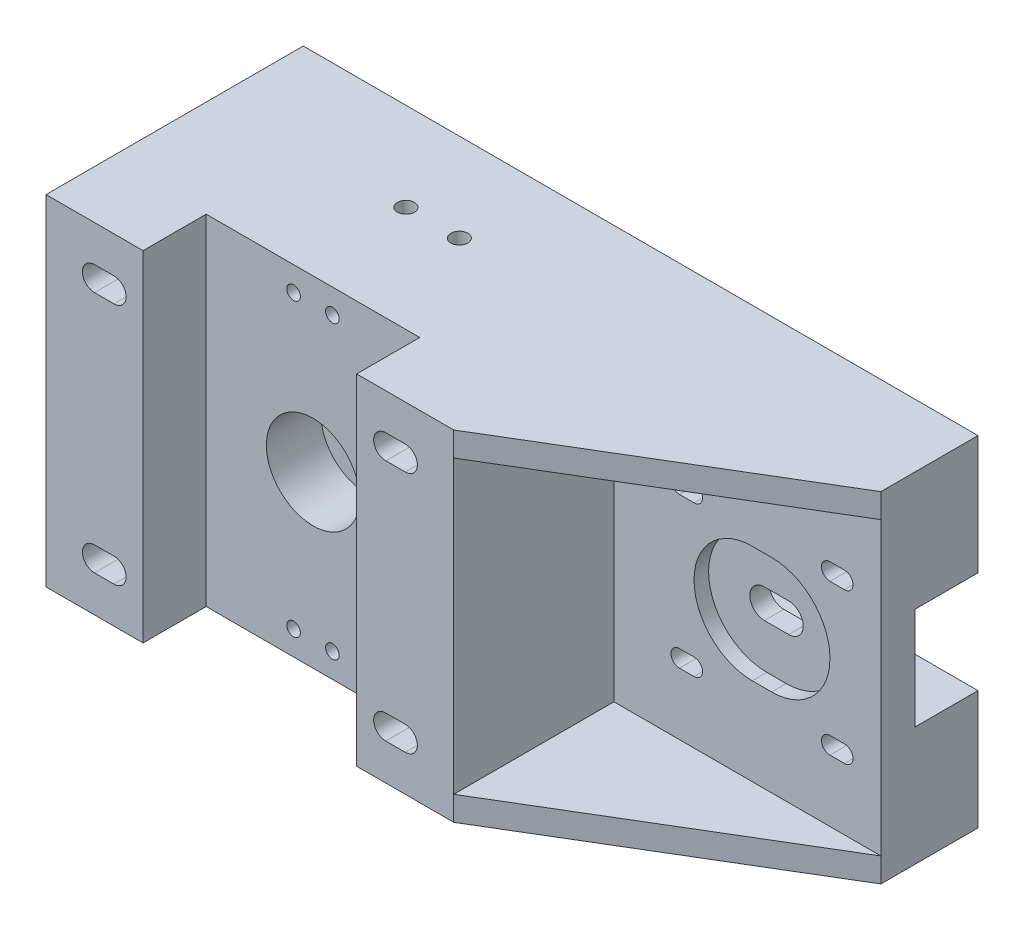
ISO-10303-21;
HEADER;
FILE_DESCRIPTION(('STEP AP214'),'2;1');
FILE_NAME('part.step','',(''),(''),'','','');
FILE_SCHEMA(('AUTOMOTIVE_DESIGN { 1 0 10303 214 1 1 1 1 }'));
ENDSEC;
DATA;
#1=APPLICATION_CONTEXT('core data for automotive mechanical design processes');
#2=APPLICATION_PROTOCOL_DEFINITION('international standard','automotive_design',2000,#1);
#3=PRODUCT_CONTEXT('',#1,'mechanical');
#4=PRODUCT('Part','Part','',(#3));
#5=PRODUCT_RELATED_PRODUCT_CATEGORY('part','',(#4));
#6=PRODUCT_DEFINITION_FORMATION('','',#4);
#7=PRODUCT_DEFINITION_CONTEXT('part definition',#1,'design');
#8=PRODUCT_DEFINITION('design','',#6,#7);
#9=PRODUCT_DEFINITION_SHAPE('','',#8);
#10=(LENGTH_UNIT() NAMED_UNIT(*) SI_UNIT(.MILLI.,.METRE.));
#11=(NAMED_UNIT(*) PLANE_ANGLE_UNIT() SI_UNIT($,.RADIAN.));
#12=(NAMED_UNIT(*) SI_UNIT($,.STERADIAN.) SOLID_ANGLE_UNIT());
#13=UNCERTAINTY_MEASURE_WITH_UNIT(LENGTH_MEASURE(1.E-05),#10,'distance_accuracy_value','');
#14=(GEOMETRIC_REPRESENTATION_CONTEXT(3) GLOBAL_UNCERTAINTY_ASSIGNED_CONTEXT((#13)) GLOBAL_UNIT_ASSIGNED_CONTEXT((#10,
#11,#12)) REPRESENTATION_CONTEXT('',''));
#15=CARTESIAN_POINT('',(0.,0.,0.));
#16=DIRECTION('',(0.,0.,1.));
#17=DIRECTION('',(1.,0.,0.));
#18=AXIS2_PLACEMENT_3D('',#15,#16,#17);
#19=CARTESIAN_POINT('',(89.5000000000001,50.5,28.));
#20=DIRECTION('',(0.,0.,-1.));
#21=DIRECTION('',(-1.,0.,0.));
#22=AXIS2_PLACEMENT_3D('',#19,#20,#21);
#23=CYLINDRICAL_SURFACE('',#22,1.74999999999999);
#24=CARTESIAN_POINT('',(89.5,50.5,-35.));
#25=DIRECTION('',(0.,0.,-1.));
#26=DIRECTION('',(-1.,0.,0.));
#27=AXIS2_PLACEMENT_3D('',#24,#25,#26);
#28=CIRCLE('',#27,1.74999999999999);
#29=CARTESIAN_POINT('',(89.5,48.75,-35.));
#30=VERTEX_POINT('',#29);
#31=CARTESIAN_POINT('',(89.5,52.25,-35.));
#32=VERTEX_POINT('',#31);
#33=EDGE_CURVE('E998',#30,#32,#28,.F.);
#34=ORIENTED_EDGE('',*,*,#33,.F.);
#35=DIRECTION('',(0.,0.,-1.));
#36=VECTOR('',#35,1.);
#37=CARTESIAN_POINT('',(89.5000000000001,48.75,28.));
#38=LINE('',#37,#36);
#39=CARTESIAN_POINT('',(89.5,48.75,-20.));
#40=VERTEX_POINT('',#39);
#41=EDGE_CURVE('E1072',#40,#30,#38,.T.);
#42=ORIENTED_EDGE('',*,*,#41,.F.);
#43=CARTESIAN_POINT('',(89.5,50.5,-20.));
#44=DIRECTION('',(0.,0.,-1.));
#45=DIRECTION('',(-1.,0.,0.));
#46=AXIS2_PLACEMENT_3D('',#43,#44,#45);
#47=CIRCLE('',#46,1.74999999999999);
#48=CARTESIAN_POINT('',(89.5,52.25,-20.));
#49=VERTEX_POINT('',#48);
#50=EDGE_CURVE('E1113',#49,#40,#47,.T.);
#51=ORIENTED_EDGE('',*,*,#50,.F.);
#52=DIRECTION('',(0.,0.,-1.));
#53=VECTOR('',#52,1.);
#54=CARTESIAN_POINT('',(89.5000000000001,52.25,28.));
#55=LINE('',#54,#53);
#56=EDGE_CURVE('E1093',#49,#32,#55,.T.);
#57=ORIENTED_EDGE('',*,*,#56,.T.);
#58=EDGE_LOOP('',(#34,#42,#51,#57));
#59=FACE_BOUND('',#58,.T.);
#60=ADVANCED_FACE('F36',(#59),#23,.F.);
#61=CARTESIAN_POINT('',(89.5000000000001,52.25,28.));
#62=DIRECTION('',(0.,1.,0.));
#63=DIRECTION('',(0.,0.,1.));
#64=AXIS2_PLACEMENT_3D('',#61,#62,#63);
#65=PLANE('',#64);
#66=DIRECTION('',(-1.,0.,0.));
#67=VECTOR('',#66,1.);
#68=CARTESIAN_POINT('',(89.5,52.25,-35.));
#69=LINE('',#68,#67);
#70=CARTESIAN_POINT('',(86.5,52.25,-35.));
#71=VERTEX_POINT('',#70);
#72=EDGE_CURVE('E996',#32,#71,#69,.T.);
#73=ORIENTED_EDGE('',*,*,#72,.F.);
#74=ORIENTED_EDGE('',*,*,#56,.F.);
#75=DIRECTION('',(1.,0.,0.));
#76=VECTOR('',#75,1.);
#77=CARTESIAN_POINT('',(97.,52.25,-20.));
#78=LINE('',#77,#76);
#79=CARTESIAN_POINT('',(86.5,52.25,-20.));
#80=VERTEX_POINT('',#79);
#81=EDGE_CURVE('E1110',#80,#49,#78,.T.);
#82=ORIENTED_EDGE('',*,*,#81,.F.);
#83=DIRECTION('',(0.,0.,-1.));
#84=VECTOR('',#83,1.);
#85=CARTESIAN_POINT('',(86.5000000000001,52.25,28.));
#86=LINE('',#85,#84);
#87=EDGE_CURVE('E1097',#80,#71,#86,.T.);
#88=ORIENTED_EDGE('',*,*,#87,.T.);
#89=EDGE_LOOP('',(#73,#74,#82,#88));
#90=FACE_BOUND('',#89,.T.);
#91=ADVANCED_FACE('F1398',(#90),#65,.F.);
#92=CARTESIAN_POINT('',(86.5,50.5,28.));
#93=DIRECTION('',(0.,0.,-1.));
#94=DIRECTION('',(-1.,0.,0.));
#95=AXIS2_PLACEMENT_3D('',#92,#93,#94);
#96=CYLINDRICAL_SURFACE('',#95,1.74999999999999);
#97=CARTESIAN_POINT('',(86.5,50.5,-35.));
#98=DIRECTION('',(0.,0.,-1.));
#99=DIRECTION('',(-1.,0.,0.));
#100=AXIS2_PLACEMENT_3D('',#97,#98,#99);
#101=CIRCLE('',#100,1.74999999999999);
#102=CARTESIAN_POINT('',(86.5,48.75,-35.));
#103=VERTEX_POINT('',#102);
#104=EDGE_CURVE('E994',#71,#103,#101,.F.);
#105=ORIENTED_EDGE('',*,*,#104,.F.);
#106=ORIENTED_EDGE('',*,*,#87,.F.);
#107=CARTESIAN_POINT('',(86.5,50.5,-20.));
#108=DIRECTION('',(0.,0.,-1.));
#109=DIRECTION('',(-1.,0.,0.));
#110=AXIS2_PLACEMENT_3D('',#107,#108,#109);
#111=CIRCLE('',#110,1.74999999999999);
#112=CARTESIAN_POINT('',(86.5,48.75,-20.));
#113=VERTEX_POINT('',#112);
#114=EDGE_CURVE('E1107',#113,#80,#111,.T.);
#115=ORIENTED_EDGE('',*,*,#114,.F.);
#116=DIRECTION('',(0.,0.,-1.));
#117=VECTOR('',#116,1.);
#118=CARTESIAN_POINT('',(86.5,48.75,28.));
#119=LINE('',#118,#117);
#120=EDGE_CURVE('E1100',#113,#103,#119,.T.);
#121=ORIENTED_EDGE('',*,*,#120,.T.);
#122=EDGE_LOOP('',(#105,#106,#115,#121));
#123=FACE_BOUND('',#122,.T.);
#124=ADVANCED_FACE('F1404',(#123),#96,.F.);
#125=CARTESIAN_POINT('',(89.5000000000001,48.75,28.));
#126=DIRECTION('',(0.,-1.,0.));
#127=DIRECTION('',(0.,0.,-1.));
#128=AXIS2_PLACEMENT_3D('',#125,#126,#127);
#129=PLANE('',#128);
#130=DIRECTION('',(1.,0.,0.));
#131=VECTOR('',#130,1.);
#132=CARTESIAN_POINT('',(89.5,48.75,-35.));
#133=LINE('',#132,#131);
#134=EDGE_CURVE('E1334',#103,#30,#133,.T.);
#135=ORIENTED_EDGE('',*,*,#134,.F.);
#136=ORIENTED_EDGE('',*,*,#120,.F.);
#137=DIRECTION('',(-1.,0.,0.));
#138=VECTOR('',#137,1.);
#139=CARTESIAN_POINT('',(97.,48.75,-20.));
#140=LINE('',#139,#138);
#141=EDGE_CURVE('E1096',#40,#113,#140,.T.);
#142=ORIENTED_EDGE('',*,*,#141,.F.);
#143=ORIENTED_EDGE('',*,*,#41,.T.);
#144=EDGE_LOOP('',(#135,#136,#142,#143));
#145=FACE_BOUND('',#144,.T.);
#146=ADVANCED_FACE('F1410',(#145),#129,.F.);
#147=CARTESIAN_POINT('',(58.5,19.5,28.));
#148=DIRECTION('',(0.,0.,-1.));
#149=DIRECTION('',(-1.,0.,0.));
#150=AXIS2_PLACEMENT_3D('',#147,#148,#149);
#151=CYLINDRICAL_SURFACE('',#150,1.75);
#152=CARTESIAN_POINT('',(58.5,19.5,-35.));
#153=DIRECTION('',(0.,0.,-1.));
#154=DIRECTION('',(-1.,0.,0.));
#155=AXIS2_PLACEMENT_3D('',#152,#153,#154);
#156=CIRCLE('',#155,1.75);
#157=CARTESIAN_POINT('',(58.5,17.75,-35.));
#158=VERTEX_POINT('',#157);
#159=CARTESIAN_POINT('',(58.5,21.25,-35.));
#160=VERTEX_POINT('',#159);
#161=EDGE_CURVE('E992',#158,#160,#156,.F.);
#162=ORIENTED_EDGE('',*,*,#161,.F.);
#163=DIRECTION('',(0.,0.,-1.));
#164=VECTOR('',#163,1.);
#165=CARTESIAN_POINT('',(58.5,17.75,28.));
#166=LINE('',#165,#164);
#167=CARTESIAN_POINT('',(58.5,17.75,-20.));
#168=VERTEX_POINT('',#167);
#169=EDGE_CURVE('E1066',#168,#158,#166,.T.);
#170=ORIENTED_EDGE('',*,*,#169,.F.);
#171=CARTESIAN_POINT('',(58.5,19.5,-20.));
#172=DIRECTION('',(0.,0.,-1.));
#173=DIRECTION('',(-1.,0.,0.));
#174=AXIS2_PLACEMENT_3D('',#171,#172,#173);
#175=CIRCLE('',#174,1.75);
#176=CARTESIAN_POINT('',(58.5,21.25,-20.));
#177=VERTEX_POINT('',#176);
#178=EDGE_CURVE('E1125',#177,#168,#175,.T.);
#179=ORIENTED_EDGE('',*,*,#178,.F.);
#180=DIRECTION('',(0.,0.,-1.));
#181=VECTOR('',#180,1.);
#182=CARTESIAN_POINT('',(58.5,21.25,28.));
#183=LINE('',#182,#181);
#184=EDGE_CURVE('E1056',#177,#160,#183,.T.);
#185=ORIENTED_EDGE('',*,*,#184,.T.);
#186=EDGE_LOOP('',(#162,#170,#179,#185));
#187=FACE_BOUND('',#186,.T.);
#188=ADVANCED_FACE('F1699',(#187),#151,.F.);
#189=CARTESIAN_POINT('',(58.5,21.25,28.));
#190=DIRECTION('',(0.,1.,0.));
#191=DIRECTION('',(0.,0.,1.));
#192=AXIS2_PLACEMENT_3D('',#189,#190,#191);
#193=PLANE('',#192);
#194=DIRECTION('',(-1.,0.,0.));
#195=VECTOR('',#194,1.);
#196=CARTESIAN_POINT('',(58.5,21.25,-35.));
#197=LINE('',#196,#195);
#198=CARTESIAN_POINT('',(55.5,21.25,-35.));
#199=VERTEX_POINT('',#198);
#200=EDGE_CURVE('E990',#160,#199,#197,.T.);
#201=ORIENTED_EDGE('',*,*,#200,.F.);
#202=ORIENTED_EDGE('',*,*,#184,.F.);
#203=DIRECTION('',(1.,0.,0.));
#204=VECTOR('',#203,1.);
#205=CARTESIAN_POINT('',(97.,21.25,-20.));
#206=LINE('',#205,#204);
#207=CARTESIAN_POINT('',(55.5,21.25,-20.));
#208=VERTEX_POINT('',#207);
#209=EDGE_CURVE('E1122',#208,#177,#206,.T.);
#210=ORIENTED_EDGE('',*,*,#209,.F.);
#211=DIRECTION('',(0.,0.,-1.));
#212=VECTOR('',#211,1.);
#213=CARTESIAN_POINT('',(55.5,21.25,28.));
#214=LINE('',#213,#212);
#215=EDGE_CURVE('E1060',#208,#199,#214,.T.);
#216=ORIENTED_EDGE('',*,*,#215,.T.);
#217=EDGE_LOOP('',(#201,#202,#210,#216));
#218=FACE_BOUND('',#217,.T.);
#219=ADVANCED_FACE('F1691',(#218),#193,.F.);
#220=CARTESIAN_POINT('',(55.5,19.5,28.));
#221=DIRECTION('',(0.,0.,-1.));
#222=DIRECTION('',(-1.,0.,0.));
#223=AXIS2_PLACEMENT_3D('',#220,#221,#222);
#224=CYLINDRICAL_SURFACE('',#223,1.75);
#225=CARTESIAN_POINT('',(55.5,19.5,-35.));
#226=DIRECTION('',(0.,0.,-1.));
#227=DIRECTION('',(-1.,0.,0.));
#228=AXIS2_PLACEMENT_3D('',#225,#226,#227);
#229=CIRCLE('',#228,1.75);
#230=CARTESIAN_POINT('',(55.5,17.75,-35.));
#231=VERTEX_POINT('',#230);
#232=EDGE_CURVE('E988',#199,#231,#229,.F.);
#233=ORIENTED_EDGE('',*,*,#232,.F.);
#234=ORIENTED_EDGE('',*,*,#215,.F.);
#235=CARTESIAN_POINT('',(55.5,19.5,-20.));
#236=DIRECTION('',(0.,0.,-1.));
#237=DIRECTION('',(-1.,0.,0.));
#238=AXIS2_PLACEMENT_3D('',#235,#236,#237);
#239=CIRCLE('',#238,1.75);
#240=CARTESIAN_POINT('',(55.5,17.75,-20.));
#241=VERTEX_POINT('',#240);
#242=EDGE_CURVE('E1119',#241,#208,#239,.T.);
#243=ORIENTED_EDGE('',*,*,#242,.F.);
#244=DIRECTION('',(0.,0.,-1.));
#245=VECTOR('',#244,1.);
#246=CARTESIAN_POINT('',(55.5,17.75,28.));
#247=LINE('',#246,#245);
#248=EDGE_CURVE('E1063',#241,#231,#247,.T.);
#249=ORIENTED_EDGE('',*,*,#248,.T.);
#250=EDGE_LOOP('',(#233,#234,#243,#249));
#251=FACE_BOUND('',#250,.T.);
#252=ADVANCED_FACE('F1683',(#251),#224,.F.);
#253=CARTESIAN_POINT('',(58.5,17.75,28.));
#254=DIRECTION('',(0.,-1.,0.));
#255=DIRECTION('',(0.,0.,-1.));
#256=AXIS2_PLACEMENT_3D('',#253,#254,#255);
#257=PLANE('',#256);
#258=DIRECTION('',(1.,0.,0.));
#259=VECTOR('',#258,1.);
#260=CARTESIAN_POINT('',(58.5,17.75,-35.));
#261=LINE('',#260,#259);
#262=EDGE_CURVE('E1332',#231,#158,#261,.T.);
#263=ORIENTED_EDGE('',*,*,#262,.F.);
#264=ORIENTED_EDGE('',*,*,#248,.F.);
#265=DIRECTION('',(-1.,0.,0.));
#266=VECTOR('',#265,1.);
#267=CARTESIAN_POINT('',(97.,17.75,-20.));
#268=LINE('',#267,#266);
#269=EDGE_CURVE('E1116',#168,#241,#268,.T.);
#270=ORIENTED_EDGE('',*,*,#269,.F.);
#271=ORIENTED_EDGE('',*,*,#169,.T.);
#272=EDGE_LOOP('',(#263,#264,#270,#271));
#273=FACE_BOUND('',#272,.T.);
#274=ADVANCED_FACE('F1675',(#273),#257,.F.);
#275=CARTESIAN_POINT('',(89.5,19.4999999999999,28.));
#276=DIRECTION('',(0.,0.,-1.));
#277=DIRECTION('',(-1.,0.,0.));
#278=AXIS2_PLACEMENT_3D('',#275,#276,#277);
#279=CYLINDRICAL_SURFACE('',#278,1.75);
#280=CARTESIAN_POINT('',(89.5,19.4999999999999,-35.));
#281=DIRECTION('',(0.,0.,-1.));
#282=DIRECTION('',(-1.,0.,0.));
#283=AXIS2_PLACEMENT_3D('',#280,#281,#282);
#284=CIRCLE('',#283,1.75);
#285=CARTESIAN_POINT('',(89.5,17.7499999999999,-35.));
#286=VERTEX_POINT('',#285);
#287=CARTESIAN_POINT('',(89.5,21.2499999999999,-35.));
#288=VERTEX_POINT('',#287);
#289=EDGE_CURVE('E986',#286,#288,#284,.F.);
#290=ORIENTED_EDGE('',*,*,#289,.F.);
#291=DIRECTION('',(0.,0.,-1.));
#292=VECTOR('',#291,1.);
#293=CARTESIAN_POINT('',(89.5,17.7499999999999,28.));
#294=LINE('',#293,#292);
#295=CARTESIAN_POINT('',(89.5,17.7499999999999,-20.));
#296=VERTEX_POINT('',#295);
#297=EDGE_CURVE('E1059',#296,#286,#294,.T.);
#298=ORIENTED_EDGE('',*,*,#297,.F.);
#299=CARTESIAN_POINT('',(89.5,19.4999999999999,-20.));
#300=DIRECTION('',(0.,0.,-1.));
#301=DIRECTION('',(-1.,0.,0.));
#302=AXIS2_PLACEMENT_3D('',#299,#300,#301);
#303=CIRCLE('',#302,1.75);
#304=CARTESIAN_POINT('',(89.5,21.2499999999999,-20.));
#305=VERTEX_POINT('',#304);
#306=EDGE_CURVE('E1137',#305,#296,#303,.T.);
#307=ORIENTED_EDGE('',*,*,#306,.F.);
#308=DIRECTION('',(0.,0.,-1.));
#309=VECTOR('',#308,1.);
#310=CARTESIAN_POINT('',(89.5,21.2499999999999,28.));
#311=LINE('',#310,#309);
#312=EDGE_CURVE('E1082',#305,#288,#311,.T.);
#313=ORIENTED_EDGE('',*,*,#312,.T.);
#314=EDGE_LOOP('',(#290,#298,#307,#313));
#315=FACE_BOUND('',#314,.T.);
#316=ADVANCED_FACE('F1667',(#315),#279,.F.);
#317=CARTESIAN_POINT('',(89.5,21.2499999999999,28.));
#318=DIRECTION('',(0.,1.,0.));
#319=DIRECTION('',(0.,0.,1.));
#320=AXIS2_PLACEMENT_3D('',#317,#318,#319);
#321=PLANE('',#320);
#322=DIRECTION('',(-1.,0.,0.));
#323=VECTOR('',#322,1.);
#324=CARTESIAN_POINT('',(89.5,21.2499999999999,-35.));
#325=LINE('',#324,#323);
#326=CARTESIAN_POINT('',(86.5,21.2499999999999,-35.));
#327=VERTEX_POINT('',#326);
#328=EDGE_CURVE('E984',#288,#327,#325,.T.);
#329=ORIENTED_EDGE('',*,*,#328,.F.);
#330=ORIENTED_EDGE('',*,*,#312,.F.);
#331=DIRECTION('',(1.,0.,0.));
#332=VECTOR('',#331,1.);
#333=CARTESIAN_POINT('',(97.,21.25,-20.));
#334=LINE('',#333,#332);
#335=CARTESIAN_POINT('',(86.5,21.2499999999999,-20.));
#336=VERTEX_POINT('',#335);
#337=EDGE_CURVE('E1134',#336,#305,#334,.T.);
#338=ORIENTED_EDGE('',*,*,#337,.F.);
#339=DIRECTION('',(0.,0.,-1.));
#340=VECTOR('',#339,1.);
#341=CARTESIAN_POINT('',(86.5,21.2499999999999,28.));
#342=LINE('',#341,#340);
#343=EDGE_CURVE('E1085',#336,#327,#342,.T.);
#344=ORIENTED_EDGE('',*,*,#343,.T.);
#345=EDGE_LOOP('',(#329,#330,#338,#344));
#346=FACE_BOUND('',#345,.T.);
#347=ADVANCED_FACE('F1659',(#346),#321,.F.);
#348=CARTESIAN_POINT('',(86.5,19.4999999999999,28.));
#349=DIRECTION('',(0.,0.,-1.));
#350=DIRECTION('',(-1.,0.,0.));
#351=AXIS2_PLACEMENT_3D('',#348,#349,#350);
#352=CYLINDRICAL_SURFACE('',#351,1.75);
#353=CARTESIAN_POINT('',(86.5,19.4999999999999,-35.));
#354=DIRECTION('',(0.,0.,-1.));
#355=DIRECTION('',(-1.,0.,0.));
#356=AXIS2_PLACEMENT_3D('',#353,#354,#355);
#357=CIRCLE('',#356,1.75);
#358=CARTESIAN_POINT('',(86.5,17.7499999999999,-35.));
#359=VERTEX_POINT('',#358);
#360=EDGE_CURVE('E982',#327,#359,#357,.F.);
#361=ORIENTED_EDGE('',*,*,#360,.F.);
#362=ORIENTED_EDGE('',*,*,#343,.F.);
#363=CARTESIAN_POINT('',(86.5,19.4999999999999,-20.));
#364=DIRECTION('',(0.,0.,-1.));
#365=DIRECTION('',(-1.,0.,0.));
#366=AXIS2_PLACEMENT_3D('',#363,#364,#365);
#367=CIRCLE('',#366,1.75);
#368=CARTESIAN_POINT('',(86.5,17.7499999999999,-20.));
#369=VERTEX_POINT('',#368);
#370=EDGE_CURVE('E1131',#369,#336,#367,.T.);
#371=ORIENTED_EDGE('',*,*,#370,.F.);
#372=DIRECTION('',(0.,0.,-1.));
#373=VECTOR('',#372,1.);
#374=CARTESIAN_POINT('',(86.5,17.7499999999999,28.));
#375=LINE('',#374,#373);
#376=EDGE_CURVE('E1088',#369,#359,#375,.T.);
#377=ORIENTED_EDGE('',*,*,#376,.T.);
#378=EDGE_LOOP('',(#361,#362,#371,#377));
#379=FACE_BOUND('',#378,.T.);
#380=ADVANCED_FACE('F1651',(#379),#352,.F.);
#381=CARTESIAN_POINT('',(89.5,17.7499999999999,28.));
#382=DIRECTION('',(0.,-1.,0.));
#383=DIRECTION('',(0.,0.,-1.));
#384=AXIS2_PLACEMENT_3D('',#381,#382,#383);
#385=PLANE('',#384);
#386=DIRECTION('',(1.,0.,0.));
#387=VECTOR('',#386,1.);
#388=CARTESIAN_POINT('',(89.5,17.7499999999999,-35.));
#389=LINE('',#388,#387);
#390=EDGE_CURVE('E1330',#359,#286,#389,.T.);
#391=ORIENTED_EDGE('',*,*,#390,.F.);
#392=ORIENTED_EDGE('',*,*,#376,.F.);
#393=DIRECTION('',(-1.,0.,0.));
#394=VECTOR('',#393,1.);
#395=CARTESIAN_POINT('',(97.,17.7499999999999,-20.));
#396=LINE('',#395,#394);
#397=EDGE_CURVE('E1128',#296,#369,#396,.T.);
#398=ORIENTED_EDGE('',*,*,#397,.F.);
#399=ORIENTED_EDGE('',*,*,#297,.T.);
#400=EDGE_LOOP('',(#391,#392,#398,#399));
#401=FACE_BOUND('',#400,.T.);
#402=ADVANCED_FACE('F1643',(#401),#385,.F.);
#403=CARTESIAN_POINT('',(58.5,50.5,28.));
#404=DIRECTION('',(0.,0.,-1.));
#405=DIRECTION('',(-1.,0.,0.));
#406=AXIS2_PLACEMENT_3D('',#403,#404,#405);
#407=CYLINDRICAL_SURFACE('',#406,1.75);
#408=CARTESIAN_POINT('',(58.5,50.5,-35.));
#409=DIRECTION('',(0.,0.,-1.));
#410=DIRECTION('',(-1.,0.,0.));
#411=AXIS2_PLACEMENT_3D('',#408,#409,#410);
#412=CIRCLE('',#411,1.75);
#413=CARTESIAN_POINT('',(58.5,48.75,-35.));
#414=VERTEX_POINT('',#413);
#415=CARTESIAN_POINT('',(58.5,52.25,-35.));
#416=VERTEX_POINT('',#415);
#417=EDGE_CURVE('E980',#414,#416,#412,.F.);
#418=ORIENTED_EDGE('',*,*,#417,.F.);
#419=DIRECTION('',(0.,0.,-1.));
#420=VECTOR('',#419,1.);
#421=CARTESIAN_POINT('',(58.5,48.75,28.));
#422=LINE('',#421,#420);
#423=CARTESIAN_POINT('',(58.5,48.75,-20.));
#424=VERTEX_POINT('',#423);
#425=EDGE_CURVE('E1079',#424,#414,#422,.T.);
#426=ORIENTED_EDGE('',*,*,#425,.F.);
#427=CARTESIAN_POINT('',(58.5,50.5,-20.));
#428=DIRECTION('',(0.,0.,-1.));
#429=DIRECTION('',(-1.,0.,0.));
#430=AXIS2_PLACEMENT_3D('',#427,#428,#429);
#431=CIRCLE('',#430,1.75);
#432=CARTESIAN_POINT('',(58.5,52.25,-20.));
#433=VERTEX_POINT('',#432);
#434=EDGE_CURVE('E1149',#433,#424,#431,.T.);
#435=ORIENTED_EDGE('',*,*,#434,.F.);
#436=DIRECTION('',(0.,0.,-1.));
#437=VECTOR('',#436,1.);
#438=CARTESIAN_POINT('',(58.5,52.25,28.));
#439=LINE('',#438,#437);
#440=EDGE_CURVE('E1069',#433,#416,#439,.T.);
#441=ORIENTED_EDGE('',*,*,#440,.T.);
#442=EDGE_LOOP('',(#418,#426,#435,#441));
#443=FACE_BOUND('',#442,.T.);
#444=ADVANCED_FACE('F1635',(#443),#407,.F.);
#445=CARTESIAN_POINT('',(58.5,52.25,28.));
#446=DIRECTION('',(0.,1.,0.));
#447=DIRECTION('',(-1.,0.,0.));
#448=AXIS2_PLACEMENT_3D('',#445,#446,#447);
#449=PLANE('',#448);
#450=DIRECTION('',(-1.,0.,0.));
#451=VECTOR('',#450,1.);
#452=CARTESIAN_POINT('',(58.5,52.25,-35.));
#453=LINE('',#452,#451);
#454=CARTESIAN_POINT('',(55.5,52.25,-35.));
#455=VERTEX_POINT('',#454);
#456=EDGE_CURVE('E978',#416,#455,#453,.T.);
#457=ORIENTED_EDGE('',*,*,#456,.F.);
#458=ORIENTED_EDGE('',*,*,#440,.F.);
#459=DIRECTION('',(1.,0.,0.));
#460=VECTOR('',#459,1.);
#461=CARTESIAN_POINT('',(97.,52.2499999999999,-20.));
#462=LINE('',#461,#460);
#463=CARTESIAN_POINT('',(55.5,52.25,-20.));
#464=VERTEX_POINT('',#463);
#465=EDGE_CURVE('E1146',#464,#433,#462,.T.);
#466=ORIENTED_EDGE('',*,*,#465,.F.);
#467=DIRECTION('',(0.,0.,-1.));
#468=VECTOR('',#467,1.);
#469=CARTESIAN_POINT('',(55.5,52.25,28.));
#470=LINE('',#469,#468);
#471=EDGE_CURVE('E1073',#464,#455,#470,.T.);
#472=ORIENTED_EDGE('',*,*,#471,.T.);
#473=EDGE_LOOP('',(#457,#458,#466,#472));
#474=FACE_BOUND('',#473,.T.);
#475=ADVANCED_FACE('F1627',(#474),#449,.F.);
#476=CARTESIAN_POINT('',(55.5,50.5,28.));
#477=DIRECTION('',(0.,0.,-1.));
#478=DIRECTION('',(-1.,0.,0.));
#479=AXIS2_PLACEMENT_3D('',#476,#477,#478);
#480=CYLINDRICAL_SURFACE('',#479,1.75000000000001);
#481=CARTESIAN_POINT('',(55.5,50.5,-35.));
#482=DIRECTION('',(0.,0.,-1.));
#483=DIRECTION('',(-1.,0.,0.));
#484=AXIS2_PLACEMENT_3D('',#481,#482,#483);
#485=CIRCLE('',#484,1.75000000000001);
#486=CARTESIAN_POINT('',(55.5,48.75,-35.));
#487=VERTEX_POINT('',#486);
#488=EDGE_CURVE('E970',#455,#487,#485,.F.);
#489=ORIENTED_EDGE('',*,*,#488,.F.);
#490=ORIENTED_EDGE('',*,*,#471,.F.);
#491=CARTESIAN_POINT('',(55.5,50.5,-20.));
#492=DIRECTION('',(0.,0.,-1.));
#493=DIRECTION('',(-1.,0.,0.));
#494=AXIS2_PLACEMENT_3D('',#491,#492,#493);
#495=CIRCLE('',#494,1.75000000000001);
#496=CARTESIAN_POINT('',(55.5,48.75,-20.));
#497=VERTEX_POINT('',#496);
#498=EDGE_CURVE('E1143',#497,#464,#495,.T.);
#499=ORIENTED_EDGE('',*,*,#498,.F.);
#500=DIRECTION('',(0.,0.,-1.));
#501=VECTOR('',#500,1.);
#502=CARTESIAN_POINT('',(55.5,48.75,28.));
#503=LINE('',#502,#501);
#504=EDGE_CURVE('E1076',#497,#487,#503,.T.);
#505=ORIENTED_EDGE('',*,*,#504,.T.);
#506=EDGE_LOOP('',(#489,#490,#499,#505));
#507=FACE_BOUND('',#506,.T.);
#508=ADVANCED_FACE('F1618',(#507),#480,.F.);
#509=CARTESIAN_POINT('',(58.5,48.75,28.));
#510=DIRECTION('',(0.,-1.,0.));
#511=DIRECTION('',(0.,0.,-1.));
#512=AXIS2_PLACEMENT_3D('',#509,#510,#511);
#513=PLANE('',#512);
#514=DIRECTION('',(1.,0.,0.));
#515=VECTOR('',#514,1.);
#516=CARTESIAN_POINT('',(58.5,48.75,-35.));
#517=LINE('',#516,#515);
#518=EDGE_CURVE('E1328',#487,#414,#517,.T.);
#519=ORIENTED_EDGE('',*,*,#518,.F.);
#520=ORIENTED_EDGE('',*,*,#504,.F.);
#521=DIRECTION('',(-1.,0.,0.));
#522=VECTOR('',#521,1.);
#523=CARTESIAN_POINT('',(97.,48.75,-20.));
#524=LINE('',#523,#522);
#525=EDGE_CURVE('E1140',#424,#497,#524,.T.);
#526=ORIENTED_EDGE('',*,*,#525,.F.);
#527=ORIENTED_EDGE('',*,*,#425,.T.);
#528=EDGE_LOOP('',(#519,#520,#526,#527));
#529=FACE_BOUND('',#528,.T.);
#530=ADVANCED_FACE('F1524',(#529),#513,.F.);
#531=CARTESIAN_POINT('',(42.,70.,0.));
#532=DIRECTION('',(-1.,0.,0.));
#533=DIRECTION('',(0.,0.,1.));
#534=AXIS2_PLACEMENT_3D('',#531,#532,#533);
#535=PLANE('',#534);
#536=DIRECTION('',(0.,0.,-1.));
#537=VECTOR('',#536,1.);
#538=CARTESIAN_POINT('',(42.,5.,-20.));
#539=LINE('',#538,#537);
#540=CARTESIAN_POINT('',(42.,5.,13.));
#541=VERTEX_POINT('',#540);
#542=CARTESIAN_POINT('',(42.,5.,-20.));
#543=VERTEX_POINT('',#542);
#544=EDGE_CURVE('E1153',#541,#543,#539,.T.);
#545=ORIENTED_EDGE('',*,*,#544,.T.);
#546=DIRECTION('',(0.,-1.,0.));
#547=VECTOR('',#546,1.);
#548=CARTESIAN_POINT('',(42.,70.,-20.));
#549=LINE('',#548,#547);
#550=CARTESIAN_POINT('',(42.,65.,-20.));
#551=VERTEX_POINT('',#550);
#552=EDGE_CURVE('E1212',#551,#543,#549,.T.);
#553=ORIENTED_EDGE('',*,*,#552,.F.);
#554=DIRECTION('',(0.,0.,1.));
#555=VECTOR('',#554,1.);
#556=CARTESIAN_POINT('',(42.,65.,-20.));
#557=LINE('',#556,#555);
#558=CARTESIAN_POINT('',(42.,65.,13.));
#559=VERTEX_POINT('',#558);
#560=EDGE_CURVE('E1170',#551,#559,#557,.T.);
#561=ORIENTED_EDGE('',*,*,#560,.T.);
#562=DIRECTION('',(0.,-1.,0.));
#563=VECTOR('',#562,1.);
#564=CARTESIAN_POINT('',(42.,70.,13.));
#565=LINE('',#564,#563);
#566=EDGE_CURVE('E1307',#559,#541,#565,.T.);
#567=ORIENTED_EDGE('',*,*,#566,.T.);
#568=EDGE_LOOP('',(#545,#553,#561,#567));
#569=FACE_BOUND('',#568,.T.);
#570=ADVANCED_FACE('F1455',(#569),#535,.F.);
#571=CARTESIAN_POINT('',(97.,70.,-20.));
#572=DIRECTION('',(0.,0.,-1.));
#573=DIRECTION('',(-1.,0.,0.));
#574=AXIS2_PLACEMENT_3D('',#571,#572,#573);
#575=PLANE('',#574);
#576=DIRECTION('',(1.,0.,0.));
#577=VECTOR('',#576,1.);
#578=CARTESIAN_POINT('',(70.5000000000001,22.9999999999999,-20.));
#579=LINE('',#578,#577);
#580=CARTESIAN_POINT('',(70.5000000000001,22.9999999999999,-20.));
#581=VERTEX_POINT('',#580);
#582=CARTESIAN_POINT('',(74.5,22.9999999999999,-20.));
#583=VERTEX_POINT('',#582);
#584=EDGE_CURVE('E1036',#581,#583,#579,.T.);
#585=ORIENTED_EDGE('',*,*,#584,.F.);
#586=CARTESIAN_POINT('',(70.5,35.,-20.));
#587=DIRECTION('',(0.,0.,1.));
#588=DIRECTION('',(1.,0.,0.));
#589=AXIS2_PLACEMENT_3D('',#586,#587,#588);
#590=CIRCLE('',#589,12.);
#591=CARTESIAN_POINT('',(70.5,47.,-20.));
#592=VERTEX_POINT('',#591);
#593=EDGE_CURVE('E1014',#592,#581,#590,.T.);
#594=ORIENTED_EDGE('',*,*,#593,.F.);
#595=DIRECTION('',(-1.,0.,0.));
#596=VECTOR('',#595,1.);
#597=CARTESIAN_POINT('',(70.5,47.,-20.));
#598=LINE('',#597,#596);
#599=CARTESIAN_POINT('',(74.5,47.,-20.));
#600=VERTEX_POINT('',#599);
#601=EDGE_CURVE('E1025',#600,#592,#598,.T.);
#602=ORIENTED_EDGE('',*,*,#601,.F.);
#603=CARTESIAN_POINT('',(74.5000000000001,35.,-20.));
#604=DIRECTION('',(0.,0.,1.));
#605=DIRECTION('',(1.,0.,0.));
#606=AXIS2_PLACEMENT_3D('',#603,#604,#605);
#607=CIRCLE('',#606,12.);
#608=EDGE_CURVE('E1039',#583,#600,#607,.T.);
#609=ORIENTED_EDGE('',*,*,#608,.F.);
#610=EDGE_LOOP('',(#585,#594,#602,#609));
#611=FACE_BOUND('',#610,.T.);
#612=ORIENTED_EDGE('',*,*,#465,.T.);
#613=ORIENTED_EDGE('',*,*,#434,.T.);
#614=ORIENTED_EDGE('',*,*,#525,.T.);
#615=ORIENTED_EDGE('',*,*,#498,.T.);
#616=EDGE_LOOP('',(#612,#613,#614,#615));
#617=FACE_BOUND('',#616,.T.);
#618=ORIENTED_EDGE('',*,*,#337,.T.);
#619=ORIENTED_EDGE('',*,*,#306,.T.);
#620=ORIENTED_EDGE('',*,*,#397,.T.);
#621=ORIENTED_EDGE('',*,*,#370,.T.);
#622=EDGE_LOOP('',(#618,#619,#620,#621));
#623=FACE_BOUND('',#622,.T.);
#624=ORIENTED_EDGE('',*,*,#209,.T.);
#625=ORIENTED_EDGE('',*,*,#178,.T.);
#626=ORIENTED_EDGE('',*,*,#269,.T.);
#627=ORIENTED_EDGE('',*,*,#242,.T.);
#628=EDGE_LOOP('',(#624,#625,#626,#627));
#629=FACE_BOUND('',#628,.T.);
#630=ORIENTED_EDGE('',*,*,#81,.T.);
#631=ORIENTED_EDGE('',*,*,#50,.T.);
#632=ORIENTED_EDGE('',*,*,#141,.T.);
#633=ORIENTED_EDGE('',*,*,#114,.T.);
#634=EDGE_LOOP('',(#630,#631,#632,#633));
#635=FACE_BOUND('',#634,.T.);
#636=DIRECTION('',(1.,0.,0.));
#637=VECTOR('',#636,1.);
#638=CARTESIAN_POINT('',(97.,5.,-20.));
#639=LINE('',#638,#637);
#640=CARTESIAN_POINT('',(97.,5.,-20.));
#641=VERTEX_POINT('',#640);
#642=EDGE_CURVE('E1156',#543,#641,#639,.T.);
#643=ORIENTED_EDGE('',*,*,#642,.T.);
#644=DIRECTION('',(0.,-1.,0.));
#645=VECTOR('',#644,1.);
#646=CARTESIAN_POINT('',(97.,70.,-20.));
#647=LINE('',#646,#645);
#648=CARTESIAN_POINT('',(97.,65.,-20.));
#649=VERTEX_POINT('',#648);
#650=EDGE_CURVE('E1220',#649,#641,#647,.T.);
#651=ORIENTED_EDGE('',*,*,#650,.F.);
#652=DIRECTION('',(-1.,0.,0.));
#653=VECTOR('',#652,1.);
#654=CARTESIAN_POINT('',(97.,65.,-20.));
#655=LINE('',#654,#653);
#656=EDGE_CURVE('E1176',#649,#551,#655,.T.);
#657=ORIENTED_EDGE('',*,*,#656,.T.);
#658=ORIENTED_EDGE('',*,*,#552,.T.);
#659=EDGE_LOOP('',(#643,#651,#657,#658));
#660=FACE_BOUND('',#659,.T.);
#661=ADVANCED_FACE('F1452',(#611,#617,#623,#629,#635,#660),#575,.F.);
#662=CARTESIAN_POINT('',(-22.,70.,0.));
#663=DIRECTION('',(1.,0.,0.));
#664=DIRECTION('',(0.,0.,-1.));
#665=AXIS2_PLACEMENT_3D('',#662,#663,#664);
#666=PLANE('',#665);
#667=DIRECTION('',(0.,0.,1.));
#668=VECTOR('',#667,1.);
#669=CARTESIAN_POINT('',(-22.,0.,0.));
#670=LINE('',#669,#668);
#671=CARTESIAN_POINT('',(-22.,0.,0.));
#672=VERTEX_POINT('',#671);
#673=CARTESIAN_POINT('',(-22.,0.,13.));
#674=VERTEX_POINT('',#673);
#675=EDGE_CURVE('E1260',#672,#674,#670,.T.);
#676=ORIENTED_EDGE('',*,*,#675,.F.);
#677=DIRECTION('',(0.,-1.,0.));
#678=VECTOR('',#677,1.);
#679=CARTESIAN_POINT('',(-22.,70.,0.));
#680=LINE('',#679,#678);
#681=CARTESIAN_POINT('',(-22.,70.,0.));
#682=VERTEX_POINT('',#681);
#683=EDGE_CURVE('E1315',#682,#672,#680,.T.);
#684=ORIENTED_EDGE('',*,*,#683,.F.);
#685=DIRECTION('',(0.,0.,1.));
#686=VECTOR('',#685,1.);
#687=CARTESIAN_POINT('',(-22.,70.,0.));
#688=LINE('',#687,#686);
#689=CARTESIAN_POINT('',(-22.,70.,13.));
#690=VERTEX_POINT('',#689);
#691=EDGE_CURVE('E1263',#682,#690,#688,.T.);
#692=ORIENTED_EDGE('',*,*,#691,.T.);
#693=DIRECTION('',(0.,-1.,0.));
#694=VECTOR('',#693,1.);
#695=CARTESIAN_POINT('',(-22.,70.,13.));
#696=LINE('',#695,#694);
#697=EDGE_CURVE('E1283',#690,#674,#696,.T.);
#698=ORIENTED_EDGE('',*,*,#697,.T.);
#699=EDGE_LOOP('',(#676,#684,#692,#698));
#700=FACE_BOUND('',#699,.T.);
#701=ADVANCED_FACE('F38',(#700),#666,.T.);
#702=CARTESIAN_POINT('',(0.,70.,0.));
#703=DIRECTION('',(0.,0.,1.));
#704=DIRECTION('',(1.,0.,0.));
#705=AXIS2_PLACEMENT_3D('',#702,#703,#704);
#706=PLANE('',#705);
#707=CARTESIAN_POINT('',(0.,35.,0.));
#708=DIRECTION('',(0.,0.,1.));
#709=DIRECTION('',(1.,0.,0.));
#710=AXIS2_PLACEMENT_3D('',#707,#708,#709);
#711=CIRCLE('',#710,9.6);
#712=CARTESIAN_POINT('',(9.6,35.,0.));
#713=VERTEX_POINT('',#712);
#714=EDGE_CURVE('E1232',#713,#713,#711,.T.);
#715=ORIENTED_EDGE('',*,*,#714,.F.);
#716=EDGE_LOOP('',(#715));
#717=FACE_BOUND('',#716,.T.);
#718=CARTESIAN_POINT('',(4.,65.,0.));
#719=DIRECTION('',(0.,0.,1.));
#720=DIRECTION('',(-1.,0.,0.));
#721=AXIS2_PLACEMENT_3D('',#718,#719,#720);
#722=CIRCLE('',#721,1.4);
#723=CARTESIAN_POINT('',(2.6,65.,0.));
#724=VERTEX_POINT('',#723);
#725=EDGE_CURVE('E1236',#724,#724,#722,.T.);
#726=ORIENTED_EDGE('',*,*,#725,.F.);
#727=EDGE_LOOP('',(#726));
#728=FACE_BOUND('',#727,.T.);
#729=CARTESIAN_POINT('',(4.,5.,0.));
#730=DIRECTION('',(0.,0.,1.));
#731=DIRECTION('',(1.,0.,0.));
#732=AXIS2_PLACEMENT_3D('',#729,#730,#731);
#733=CIRCLE('',#732,1.4);
#734=CARTESIAN_POINT('',(5.4,5.,0.));
#735=VERTEX_POINT('',#734);
#736=EDGE_CURVE('E1249',#735,#735,#733,.T.);
#737=ORIENTED_EDGE('',*,*,#736,.F.);
#738=EDGE_LOOP('',(#737));
#739=FACE_BOUND('',#738,.T.);
#740=CARTESIAN_POINT('',(-4.,5.,0.));
#741=DIRECTION('',(0.,0.,1.));
#742=DIRECTION('',(-1.,0.,0.));
#743=AXIS2_PLACEMENT_3D('',#740,#741,#742);
#744=CIRCLE('',#743,1.4);
#745=CARTESIAN_POINT('',(-5.4,5.,0.));
#746=VERTEX_POINT('',#745);
#747=EDGE_CURVE('E1243',#746,#746,#744,.T.);
#748=ORIENTED_EDGE('',*,*,#747,.F.);
#749=EDGE_LOOP('',(#748));
#750=FACE_BOUND('',#749,.T.);
#751=CARTESIAN_POINT('',(-4.,65.,0.));
#752=DIRECTION('',(0.,0.,1.));
#753=DIRECTION('',(1.,0.,0.));
#754=AXIS2_PLACEMENT_3D('',#751,#752,#753);
#755=CIRCLE('',#754,1.4);
#756=CARTESIAN_POINT('',(-2.6,65.,0.));
#757=VERTEX_POINT('',#756);
#758=EDGE_CURVE('E1242',#757,#757,#755,.T.);
#759=ORIENTED_EDGE('',*,*,#758,.F.);
#760=EDGE_LOOP('',(#759));
#761=FACE_BOUND('',#760,.T.);
#762=DIRECTION('',(-1.,0.,0.));
#763=VECTOR('',#762,1.);
#764=CARTESIAN_POINT('',(0.,0.,0.));
#765=LINE('',#764,#763);
#766=CARTESIAN_POINT('',(22.,0.,0.));
#767=VERTEX_POINT('',#766);
#768=EDGE_CURVE('E1286',#767,#672,#765,.T.);
#769=ORIENTED_EDGE('',*,*,#768,.F.);
#770=DIRECTION('',(0.,-1.,0.));
#771=VECTOR('',#770,1.);
#772=CARTESIAN_POINT('',(22.,70.,0.));
#773=LINE('',#772,#771);
#774=CARTESIAN_POINT('',(22.,70.,0.));
#775=VERTEX_POINT('',#774);
#776=EDGE_CURVE('E1313',#775,#767,#773,.T.);
#777=ORIENTED_EDGE('',*,*,#776,.F.);
#778=DIRECTION('',(-1.,0.,0.));
#779=VECTOR('',#778,1.);
#780=CARTESIAN_POINT('',(0.,70.,0.));
#781=LINE('',#780,#779);
#782=EDGE_CURVE('E1266',#775,#682,#781,.T.);
#783=ORIENTED_EDGE('',*,*,#782,.T.);
#784=ORIENTED_EDGE('',*,*,#683,.T.);
#785=EDGE_LOOP('',(#769,#777,#783,#784));
#786=FACE_BOUND('',#785,.T.);
#787=ADVANCED_FACE('F1530',(#717,#728,#739,#750,#761,#786),#706,.T.);
#788=CARTESIAN_POINT('',(22.,70.,0.));
#789=DIRECTION('',(1.,0.,0.));
#790=DIRECTION('',(0.,0.,-1.));
#791=AXIS2_PLACEMENT_3D('',#788,#789,#790);
#792=PLANE('',#791);
#793=DIRECTION('',(0.,0.,1.));
#794=VECTOR('',#793,1.);
#795=CARTESIAN_POINT('',(22.,0.,0.));
#796=LINE('',#795,#794);
#797=CARTESIAN_POINT('',(22.,0.,13.));
#798=VERTEX_POINT('',#797);
#799=EDGE_CURVE('E1289',#767,#798,#796,.T.);
#800=ORIENTED_EDGE('',*,*,#799,.T.);
#801=DIRECTION('',(0.,-1.,0.));
#802=VECTOR('',#801,1.);
#803=CARTESIAN_POINT('',(22.,70.,13.));
#804=LINE('',#803,#802);
#805=CARTESIAN_POINT('',(22.,70.,13.));
#806=VERTEX_POINT('',#805);
#807=EDGE_CURVE('E1310',#806,#798,#804,.T.);
#808=ORIENTED_EDGE('',*,*,#807,.F.);
#809=DIRECTION('',(0.,0.,1.));
#810=VECTOR('',#809,1.);
#811=CARTESIAN_POINT('',(22.,70.,0.));
#812=LINE('',#811,#810);
#813=EDGE_CURVE('E1270',#775,#806,#812,.T.);
#814=ORIENTED_EDGE('',*,*,#813,.F.);
#815=ORIENTED_EDGE('',*,*,#776,.T.);
#816=EDGE_LOOP('',(#800,#808,#814,#815));
#817=FACE_BOUND('',#816,.T.);
#818=ADVANCED_FACE('F1528',(#817),#792,.F.);
#819=CARTESIAN_POINT('',(0.,70.,13.));
#820=DIRECTION('',(0.,0.,-1.));
#821=DIRECTION('',(-1.,0.,0.));
#822=AXIS2_PLACEMENT_3D('',#819,#820,#821);
#823=PLANE('',#822);
#824=DIRECTION('',(1.,0.,0.));
#825=VECTOR('',#824,1.);
#826=CARTESIAN_POINT('',(28.,7.50000000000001,13.));
#827=LINE('',#826,#825);
#828=CARTESIAN_POINT('',(28.,7.50000000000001,13.));
#829=VERTEX_POINT('',#828);
#830=CARTESIAN_POINT('',(32.,7.50000000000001,13.));
#831=VERTEX_POINT('',#830);
#832=EDGE_CURVE('E616',#829,#831,#827,.T.);
#833=ORIENTED_EDGE('',*,*,#832,.F.);
#834=CARTESIAN_POINT('',(28.,10.,13.));
#835=DIRECTION('',(0.,0.,1.));
#836=DIRECTION('',(-1.,0.,0.));
#837=AXIS2_PLACEMENT_3D('',#834,#835,#836);
#838=CIRCLE('',#837,2.5);
#839=CARTESIAN_POINT('',(28.,12.5,13.));
#840=VERTEX_POINT('',#839);
#841=EDGE_CURVE('E51',#840,#829,#838,.T.);
#842=ORIENTED_EDGE('',*,*,#841,.F.);
#843=DIRECTION('',(-1.,0.,0.));
#844=VECTOR('',#843,1.);
#845=CARTESIAN_POINT('',(28.,12.5,13.));
#846=LINE('',#845,#844);
#847=CARTESIAN_POINT('',(32.,12.5,13.));
#848=VERTEX_POINT('',#847);
#849=EDGE_CURVE('E623',#848,#840,#846,.T.);
#850=ORIENTED_EDGE('',*,*,#849,.F.);
#851=CARTESIAN_POINT('',(32.,10.,13.));
#852=DIRECTION('',(0.,0.,1.));
#853=DIRECTION('',(-1.,0.,0.));
#854=AXIS2_PLACEMENT_3D('',#851,#852,#853);
#855=CIRCLE('',#854,2.5);
#856=EDGE_CURVE('E620',#831,#848,#855,.T.);
#857=ORIENTED_EDGE('',*,*,#856,.F.);
#858=EDGE_LOOP('',(#833,#842,#850,#857));
#859=FACE_BOUND('',#858,.T.);
#860=DIRECTION('',(1.,0.,0.));
#861=VECTOR('',#860,1.);
#862=CARTESIAN_POINT('',(28.,57.5,13.));
#863=LINE('',#862,#861);
#864=CARTESIAN_POINT('',(28.,57.5,13.));
#865=VERTEX_POINT('',#864);
#866=CARTESIAN_POINT('',(32.,57.5,13.));
#867=VERTEX_POINT('',#866);
#868=EDGE_CURVE('E598',#865,#867,#863,.T.);
#869=ORIENTED_EDGE('',*,*,#868,.F.);
#870=CARTESIAN_POINT('',(28.,60.,13.));
#871=DIRECTION('',(0.,0.,1.));
#872=DIRECTION('',(1.,0.,0.));
#873=AXIS2_PLACEMENT_3D('',#870,#871,#872);
#874=CIRCLE('',#873,2.5);
#875=CARTESIAN_POINT('',(28.,62.5,13.));
#876=VERTEX_POINT('',#875);
#877=EDGE_CURVE('E59',#876,#865,#874,.T.);
#878=ORIENTED_EDGE('',*,*,#877,.F.);
#879=DIRECTION('',(-1.,0.,0.));
#880=VECTOR('',#879,1.);
#881=CARTESIAN_POINT('',(28.,62.5,13.));
#882=LINE('',#881,#880);
#883=CARTESIAN_POINT('',(32.,62.5,13.));
#884=VERTEX_POINT('',#883);
#885=EDGE_CURVE('E605',#884,#876,#882,.T.);
#886=ORIENTED_EDGE('',*,*,#885,.F.);
#887=CARTESIAN_POINT('',(32.,60.,13.));
#888=DIRECTION('',(0.,0.,1.));
#889=DIRECTION('',(1.,0.,0.));
#890=AXIS2_PLACEMENT_3D('',#887,#888,#889);
#891=CIRCLE('',#890,2.5);
#892=EDGE_CURVE('E588',#867,#884,#891,.T.);
#893=ORIENTED_EDGE('',*,*,#892,.F.);
#894=EDGE_LOOP('',(#869,#878,#886,#893));
#895=FACE_BOUND('',#894,.T.);
#896=DIRECTION('',(1.,0.,0.));
#897=VECTOR('',#896,1.);
#898=CARTESIAN_POINT('',(0.,0.,13.));
#899=LINE('',#898,#897);
#900=CARTESIAN_POINT('',(42.,0.,13.));
#901=VERTEX_POINT('',#900);
#902=EDGE_CURVE('E1291',#798,#901,#899,.T.);
#903=ORIENTED_EDGE('',*,*,#902,.T.);
#904=DIRECTION('',(0.,-1.,0.));
#905=VECTOR('',#904,1.);
#906=CARTESIAN_POINT('',(42.,5.,13.));
#907=LINE('',#906,#905);
#908=EDGE_CURVE('E1165',#541,#901,#907,.T.);
#909=ORIENTED_EDGE('',*,*,#908,.F.);
#910=ORIENTED_EDGE('',*,*,#566,.F.);
#911=CARTESIAN_POINT('',(42.,70.,13.));
#912=VERTEX_POINT('',#911);
#913=EDGE_CURVE('E1308',#912,#559,#565,.T.);
#914=ORIENTED_EDGE('',*,*,#913,.F.);
#915=DIRECTION('',(1.,0.,0.));
#916=VECTOR('',#915,1.);
#917=CARTESIAN_POINT('',(0.,70.,13.));
#918=LINE('',#917,#916);
#919=EDGE_CURVE('E1272',#806,#912,#918,.T.);
#920=ORIENTED_EDGE('',*,*,#919,.F.);
#921=ORIENTED_EDGE('',*,*,#807,.T.);
#922=EDGE_LOOP('',(#903,#909,#910,#914,#920,#921));
#923=FACE_BOUND('',#922,.T.);
#924=ADVANCED_FACE('F602',(#859,#895,#923),#823,.F.);
#925=CARTESIAN_POINT('',(0.,70.,-40.));
#926=DIRECTION('',(0.,0.,1.));
#927=DIRECTION('',(1.,0.,0.));
#928=AXIS2_PLACEMENT_3D('',#925,#926,#927);
#929=PLANE('',#928);
#930=DIRECTION('',(-1.,0.,0.));
#931=VECTOR('',#930,1.);
#932=CARTESIAN_POINT('',(33.,6.,-40.));
#933=LINE('',#932,#931);
#934=CARTESIAN_POINT('',(33.,6.,-40.));
#935=VERTEX_POINT('',#934);
#936=CARTESIAN_POINT('',(27.,6.00000000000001,-40.));
#937=VERTEX_POINT('',#936);
#938=EDGE_CURVE('E754',#935,#937,#933,.T.);
#939=ORIENTED_EDGE('',*,*,#938,.F.);
#940=CARTESIAN_POINT('',(33.,10.,-40.));
#941=DIRECTION('',(0.,0.,-1.));
#942=DIRECTION('',(1.,0.,0.));
#943=AXIS2_PLACEMENT_3D('',#940,#941,#942);
#944=CIRCLE('',#943,4.);
#945=CARTESIAN_POINT('',(33.,14.,-40.));
#946=VERTEX_POINT('',#945);
#947=EDGE_CURVE('E666',#946,#935,#944,.T.);
#948=ORIENTED_EDGE('',*,*,#947,.F.);
#949=DIRECTION('',(1.,0.,0.));
#950=VECTOR('',#949,1.);
#951=CARTESIAN_POINT('',(33.,14.,-40.));
#952=LINE('',#951,#950);
#953=CARTESIAN_POINT('',(27.,14.,-40.));
#954=VERTEX_POINT('',#953);
#955=EDGE_CURVE('E743',#954,#946,#952,.T.);
#956=ORIENTED_EDGE('',*,*,#955,.F.);
#957=CARTESIAN_POINT('',(27.,10.,-40.));
#958=DIRECTION('',(0.,0.,-1.));
#959=DIRECTION('',(1.,0.,0.));
#960=AXIS2_PLACEMENT_3D('',#957,#958,#959);
#961=CIRCLE('',#960,4.);
#962=EDGE_CURVE('E757',#937,#954,#961,.T.);
#963=ORIENTED_EDGE('',*,*,#962,.F.);
#964=EDGE_LOOP('',(#939,#948,#956,#963));
#965=FACE_BOUND('',#964,.T.);
#966=DIRECTION('',(-1.,0.,0.));
#967=VECTOR('',#966,1.);
#968=CARTESIAN_POINT('',(-27.,6.,-40.));
#969=LINE('',#968,#967);
#970=CARTESIAN_POINT('',(-27.,6.00000000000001,-40.));
#971=VERTEX_POINT('',#970);
#972=CARTESIAN_POINT('',(-33.,6.,-40.));
#973=VERTEX_POINT('',#972);
#974=EDGE_CURVE('E723',#971,#973,#969,.T.);
#975=ORIENTED_EDGE('',*,*,#974,.F.);
#976=CARTESIAN_POINT('',(-27.,10.,-40.));
#977=DIRECTION('',(0.,0.,-1.));
#978=DIRECTION('',(1.,0.,0.));
#979=AXIS2_PLACEMENT_3D('',#976,#977,#978);
#980=CIRCLE('',#979,4.);
#981=CARTESIAN_POINT('',(-27.,14.,-40.));
#982=VERTEX_POINT('',#981);
#983=EDGE_CURVE('E721',#982,#971,#980,.T.);
#984=ORIENTED_EDGE('',*,*,#983,.F.);
#985=DIRECTION('',(1.,0.,0.));
#986=VECTOR('',#985,1.);
#987=CARTESIAN_POINT('',(-27.,14.,-40.));
#988=LINE('',#987,#986);
#989=CARTESIAN_POINT('',(-33.,14.,-40.));
#990=VERTEX_POINT('',#989);
#991=EDGE_CURVE('E711',#990,#982,#988,.T.);
#992=ORIENTED_EDGE('',*,*,#991,.F.);
#993=CARTESIAN_POINT('',(-33.,10.,-40.));
#994=DIRECTION('',(0.,0.,-1.));
#995=DIRECTION('',(1.,0.,0.));
#996=AXIS2_PLACEMENT_3D('',#993,#994,#995);
#997=CIRCLE('',#996,4.);
#998=EDGE_CURVE('E727',#973,#990,#997,.T.);
#999=ORIENTED_EDGE('',*,*,#998,.F.);
#1000=EDGE_LOOP('',(#975,#984,#992,#999));
#1001=FACE_BOUND('',#1000,.T.);
#1002=DIRECTION('',(-1.,0.,0.));
#1003=VECTOR('',#1002,1.);
#1004=CARTESIAN_POINT('',(-27.,56.,-40.));
#1005=LINE('',#1004,#1003);
#1006=CARTESIAN_POINT('',(-27.,56.,-40.));
#1007=VERTEX_POINT('',#1006);
#1008=CARTESIAN_POINT('',(-33.,56.,-40.));
#1009=VERTEX_POINT('',#1008);
#1010=EDGE_CURVE('E689',#1007,#1009,#1005,.T.);
#1011=ORIENTED_EDGE('',*,*,#1010,.F.);
#1012=CARTESIAN_POINT('',(-27.,60.,-40.));
#1013=DIRECTION('',(0.,0.,-1.));
#1014=DIRECTION('',(-1.,0.,0.));
#1015=AXIS2_PLACEMENT_3D('',#1012,#1013,#1014);
#1016=CIRCLE('',#1015,4.);
#1017=CARTESIAN_POINT('',(-27.,64.,-40.));
#1018=VERTEX_POINT('',#1017);
#1019=EDGE_CURVE('E687',#1018,#1007,#1016,.T.);
#1020=ORIENTED_EDGE('',*,*,#1019,.F.);
#1021=DIRECTION('',(1.,0.,0.));
#1022=VECTOR('',#1021,1.);
#1023=CARTESIAN_POINT('',(-27.,64.,-40.));
#1024=LINE('',#1023,#1022);
#1025=CARTESIAN_POINT('',(-33.,64.,-40.));
#1026=VERTEX_POINT('',#1025);
#1027=EDGE_CURVE('E677',#1026,#1018,#1024,.T.);
#1028=ORIENTED_EDGE('',*,*,#1027,.F.);
#1029=CARTESIAN_POINT('',(-33.,60.,-40.));
#1030=DIRECTION('',(0.,0.,-1.));
#1031=DIRECTION('',(-1.,0.,0.));
#1032=AXIS2_PLACEMENT_3D('',#1029,#1030,#1031);
#1033=CIRCLE('',#1032,4.);
#1034=EDGE_CURVE('E693',#1009,#1026,#1033,.T.);
#1035=ORIENTED_EDGE('',*,*,#1034,.F.);
#1036=EDGE_LOOP('',(#1011,#1020,#1028,#1035));
#1037=FACE_BOUND('',#1036,.T.);
#1038=DIRECTION('',(-1.,0.,0.));
#1039=VECTOR('',#1038,1.);
#1040=CARTESIAN_POINT('',(33.,56.,-40.));
#1041=LINE('',#1040,#1039);
#1042=CARTESIAN_POINT('',(33.,56.,-40.));
#1043=VERTEX_POINT('',#1042);
#1044=CARTESIAN_POINT('',(27.,56.,-40.));
#1045=VERTEX_POINT('',#1044);
#1046=EDGE_CURVE('E784',#1043,#1045,#1041,.T.);
#1047=ORIENTED_EDGE('',*,*,#1046,.F.);
#1048=CARTESIAN_POINT('',(33.,60.,-40.));
#1049=DIRECTION('',(0.,0.,-1.));
#1050=DIRECTION('',(-1.,0.,0.));
#1051=AXIS2_PLACEMENT_3D('',#1048,#1049,#1050);
#1052=CIRCLE('',#1051,4.);
#1053=CARTESIAN_POINT('',(33.,64.,-40.));
#1054=VERTEX_POINT('',#1053);
#1055=EDGE_CURVE('E700',#1054,#1043,#1052,.T.);
#1056=ORIENTED_EDGE('',*,*,#1055,.F.);
#1057=DIRECTION('',(1.,0.,0.));
#1058=VECTOR('',#1057,1.);
#1059=CARTESIAN_POINT('',(33.,64.,-40.));
#1060=LINE('',#1059,#1058);
#1061=CARTESIAN_POINT('',(27.,64.,-40.));
#1062=VERTEX_POINT('',#1061);
#1063=EDGE_CURVE('E773',#1062,#1054,#1060,.T.);
#1064=ORIENTED_EDGE('',*,*,#1063,.F.);
#1065=CARTESIAN_POINT('',(27.,60.,-40.));
#1066=DIRECTION('',(0.,0.,-1.));
#1067=DIRECTION('',(-1.,0.,0.));
#1068=AXIS2_PLACEMENT_3D('',#1065,#1066,#1067);
#1069=CIRCLE('',#1068,4.);
#1070=EDGE_CURVE('E787',#1045,#1062,#1069,.T.);
#1071=ORIENTED_EDGE('',*,*,#1070,.F.);
#1072=EDGE_LOOP('',(#1047,#1056,#1064,#1071));
#1073=FACE_BOUND('',#1072,.T.);
#1074=CARTESIAN_POINT('',(-37.,65.,-40.));
#1075=DIRECTION('',(0.,0.,-1.));
#1076=DIRECTION('',(-1.,0.,0.));
#1077=AXIS2_PLACEMENT_3D('',#1074,#1075,#1076);
#1078=CIRCLE('',#1077,1.4);
#1079=CARTESIAN_POINT('',(-38.4,65.,-40.));
#1080=VERTEX_POINT('',#1079);
#1081=EDGE_CURVE('E823',#1080,#1080,#1078,.T.);
#1082=ORIENTED_EDGE('',*,*,#1081,.F.);
#1083=EDGE_LOOP('',(#1082));
#1084=FACE_BOUND('',#1083,.T.);
#1085=CARTESIAN_POINT('',(-37.,5.00000000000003,-40.));
#1086=DIRECTION('',(0.,0.,-1.));
#1087=DIRECTION('',(-1.,0.,0.));
#1088=AXIS2_PLACEMENT_3D('',#1085,#1086,#1087);
#1089=CIRCLE('',#1088,1.4);
#1090=CARTESIAN_POINT('',(-38.4,5.00000000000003,-40.));
#1091=VERTEX_POINT('',#1090);
#1092=EDGE_CURVE('E829',#1091,#1091,#1089,.T.);
#1093=ORIENTED_EDGE('',*,*,#1092,.F.);
#1094=EDGE_LOOP('',(#1093));
#1095=FACE_BOUND('',#1094,.T.);
#1096=CARTESIAN_POINT('',(92.,5.,-40.));
#1097=DIRECTION('',(0.,0.,-1.));
#1098=DIRECTION('',(-1.,0.,0.));
#1099=AXIS2_PLACEMENT_3D('',#1096,#1097,#1098);
#1100=CIRCLE('',#1099,1.4);
#1101=CARTESIAN_POINT('',(90.6,5.,-40.));
#1102=VERTEX_POINT('',#1101);
#1103=EDGE_CURVE('E835',#1102,#1102,#1100,.T.);
#1104=ORIENTED_EDGE('',*,*,#1103,.F.);
#1105=EDGE_LOOP('',(#1104));
#1106=FACE_BOUND('',#1105,.T.);
#1107=CARTESIAN_POINT('',(13.,65.,-40.));
#1108=DIRECTION('',(0.,0.,-1.));
#1109=DIRECTION('',(-1.,0.,0.));
#1110=AXIS2_PLACEMENT_3D('',#1107,#1108,#1109);
#1111=CIRCLE('',#1110,1.4);
#1112=CARTESIAN_POINT('',(11.6,65.,-40.));
#1113=VERTEX_POINT('',#1112);
#1114=EDGE_CURVE('E816',#1113,#1113,#1111,.T.);
#1115=ORIENTED_EDGE('',*,*,#1114,.F.);
#1116=EDGE_LOOP('',(#1115));
#1117=FACE_BOUND('',#1116,.T.);
#1118=CARTESIAN_POINT('',(13.,4.99999999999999,-40.));
#1119=DIRECTION('',(0.,0.,-1.));
#1120=DIRECTION('',(-1.,0.,0.));
#1121=AXIS2_PLACEMENT_3D('',#1118,#1119,#1120);
#1122=CIRCLE('',#1121,1.4);
#1123=CARTESIAN_POINT('',(11.6,4.99999999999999,-40.));
#1124=VERTEX_POINT('',#1123);
#1125=EDGE_CURVE('E804',#1124,#1124,#1122,.T.);
#1126=ORIENTED_EDGE('',*,*,#1125,.F.);
#1127=EDGE_LOOP('',(#1126));
#1128=FACE_BOUND('',#1127,.T.);
#1129=CARTESIAN_POINT('',(92.,65.,-40.));
#1130=DIRECTION('',(0.,0.,-1.));
#1131=DIRECTION('',(-1.,0.,0.));
#1132=AXIS2_PLACEMENT_3D('',#1129,#1130,#1131);
#1133=CIRCLE('',#1132,1.4);
#1134=CARTESIAN_POINT('',(90.6,65.,-40.));
#1135=VERTEX_POINT('',#1134);
#1136=EDGE_CURVE('E822',#1135,#1135,#1133,.T.);
#1137=ORIENTED_EDGE('',*,*,#1136,.F.);
#1138=EDGE_LOOP('',(#1137));
#1139=FACE_BOUND('',#1138,.T.);
#1140=DIRECTION('',(-1.,0.,0.));
#1141=VECTOR('',#1140,1.);
#1142=CARTESIAN_POINT('',(59.,47.5,-40.));
#1143=LINE('',#1142,#1141);
#1144=CARTESIAN_POINT('',(59.,47.5,-40.));
#1145=VERTEX_POINT('',#1144);
#1146=CARTESIAN_POINT('',(55.,47.5,-40.));
#1147=VERTEX_POINT('',#1146);
#1148=EDGE_CURVE('E897',#1145,#1147,#1143,.T.);
#1149=ORIENTED_EDGE('',*,*,#1148,.F.);
#1150=CARTESIAN_POINT('',(59.,50.5,-40.));
#1151=DIRECTION('',(0.,0.,-1.));
#1152=DIRECTION('',(-1.,0.,0.));
#1153=AXIS2_PLACEMENT_3D('',#1150,#1151,#1152);
#1154=CIRCLE('',#1153,3.);
#1155=CARTESIAN_POINT('',(59.,53.5,-40.));
#1156=VERTEX_POINT('',#1155);
#1157=EDGE_CURVE('E895',#1156,#1145,#1154,.T.);
#1158=ORIENTED_EDGE('',*,*,#1157,.F.);
#1159=DIRECTION('',(1.,0.,0.));
#1160=VECTOR('',#1159,1.);
#1161=CARTESIAN_POINT('',(59.,53.5,-40.));
#1162=LINE('',#1161,#1160);
#1163=CARTESIAN_POINT('',(55.,53.5,-40.));
#1164=VERTEX_POINT('',#1163);
#1165=EDGE_CURVE('E885',#1164,#1156,#1162,.T.);
#1166=ORIENTED_EDGE('',*,*,#1165,.F.);
#1167=CARTESIAN_POINT('',(55.,50.5,-40.));
#1168=DIRECTION('',(0.,0.,-1.));
#1169=DIRECTION('',(-1.,0.,0.));
#1170=AXIS2_PLACEMENT_3D('',#1167,#1168,#1169);
#1171=CIRCLE('',#1170,3.);
#1172=EDGE_CURVE('E901',#1147,#1164,#1171,.T.);
#1173=ORIENTED_EDGE('',*,*,#1172,.F.);
#1174=EDGE_LOOP('',(#1149,#1158,#1166,#1173));
#1175=FACE_BOUND('',#1174,.T.);
#1176=DIRECTION('',(-1.,0.,0.));
#1177=VECTOR('',#1176,1.);
#1178=CARTESIAN_POINT('',(90.,16.4999999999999,-40.));
#1179=LINE('',#1178,#1177);
#1180=CARTESIAN_POINT('',(90.,16.4999999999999,-40.));
#1181=VERTEX_POINT('',#1180);
#1182=CARTESIAN_POINT('',(86.,16.4999999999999,-40.));
#1183=VERTEX_POINT('',#1182);
#1184=EDGE_CURVE('E930',#1181,#1183,#1179,.T.);
#1185=ORIENTED_EDGE('',*,*,#1184,.F.);
#1186=CARTESIAN_POINT('',(90.,19.4999999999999,-40.));
#1187=DIRECTION('',(0.,0.,-1.));
#1188=DIRECTION('',(-1.,0.,0.));
#1189=AXIS2_PLACEMENT_3D('',#1186,#1187,#1188);
#1190=CIRCLE('',#1189,3.);
#1191=CARTESIAN_POINT('',(90.,22.4999999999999,-40.));
#1192=VERTEX_POINT('',#1191);
#1193=EDGE_CURVE('E874',#1192,#1181,#1190,.T.);
#1194=ORIENTED_EDGE('',*,*,#1193,.F.);
#1195=DIRECTION('',(1.,0.,0.));
#1196=VECTOR('',#1195,1.);
#1197=CARTESIAN_POINT('',(90.,22.4999999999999,-40.));
#1198=LINE('',#1197,#1196);
#1199=CARTESIAN_POINT('',(86.,22.4999999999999,-40.));
#1200=VERTEX_POINT('',#1199);
#1201=EDGE_CURVE('E919',#1200,#1192,#1198,.T.);
#1202=ORIENTED_EDGE('',*,*,#1201,.F.);
#1203=CARTESIAN_POINT('',(86.,19.4999999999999,-40.));
#1204=DIRECTION('',(0.,0.,-1.));
#1205=DIRECTION('',(-1.,0.,0.));
#1206=AXIS2_PLACEMENT_3D('',#1203,#1204,#1205);
#1207=CIRCLE('',#1206,3.);
#1208=EDGE_CURVE('E933',#1183,#1200,#1207,.T.);
#1209=ORIENTED_EDGE('',*,*,#1208,.F.);
#1210=EDGE_LOOP('',(#1185,#1194,#1202,#1209));
#1211=FACE_BOUND('',#1210,.T.);
#1212=DIRECTION('',(-1.,0.,0.));
#1213=VECTOR('',#1212,1.);
#1214=CARTESIAN_POINT('',(59.,16.5,-40.));
#1215=LINE('',#1214,#1213);
#1216=CARTESIAN_POINT('',(59.,16.5,-40.));
#1217=VERTEX_POINT('',#1216);
#1218=CARTESIAN_POINT('',(55.,16.5,-40.));
#1219=VERTEX_POINT('',#1218);
#1220=EDGE_CURVE('E864',#1217,#1219,#1215,.T.);
#1221=ORIENTED_EDGE('',*,*,#1220,.F.);
#1222=CARTESIAN_POINT('',(59.,19.5,-40.));
#1223=DIRECTION('',(0.,0.,-1.));
#1224=DIRECTION('',(-1.,0.,0.));
#1225=AXIS2_PLACEMENT_3D('',#1222,#1223,#1224);
#1226=CIRCLE('',#1225,3.);
#1227=CARTESIAN_POINT('',(59.,22.5,-40.));
#1228=VERTEX_POINT('',#1227);
#1229=EDGE_CURVE('E846',#1228,#1217,#1226,.T.);
#1230=ORIENTED_EDGE('',*,*,#1229,.F.);
#1231=DIRECTION('',(1.,0.,0.));
#1232=VECTOR('',#1231,1.);
#1233=CARTESIAN_POINT('',(59.,22.5,-40.));
#1234=LINE('',#1233,#1232);
#1235=CARTESIAN_POINT('',(55.,22.5,-40.));
#1236=VERTEX_POINT('',#1235);
#1237=EDGE_CURVE('E853',#1236,#1228,#1234,.T.);
#1238=ORIENTED_EDGE('',*,*,#1237,.F.);
#1239=CARTESIAN_POINT('',(55.,19.5,-40.));
#1240=DIRECTION('',(0.,0.,-1.));
#1241=DIRECTION('',(-1.,0.,0.));
#1242=AXIS2_PLACEMENT_3D('',#1239,#1240,#1241);
#1243=CIRCLE('',#1242,3.);
#1244=EDGE_CURVE('E867',#1219,#1236,#1243,.T.);
#1245=ORIENTED_EDGE('',*,*,#1244,.F.);
#1246=EDGE_LOOP('',(#1221,#1230,#1238,#1245));
#1247=FACE_BOUND('',#1246,.T.);
#1248=DIRECTION('',(-1.,0.,0.));
#1249=VECTOR('',#1248,1.);
#1250=CARTESIAN_POINT('',(90.0000000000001,47.5,-40.));
#1251=LINE('',#1250,#1249);
#1252=CARTESIAN_POINT('',(90.0000000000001,47.5,-40.));
#1253=VERTEX_POINT('',#1252);
#1254=CARTESIAN_POINT('',(86.,47.5,-40.));
#1255=VERTEX_POINT('',#1254);
#1256=EDGE_CURVE('E960',#1253,#1255,#1251,.T.);
#1257=ORIENTED_EDGE('',*,*,#1256,.F.);
#1258=CARTESIAN_POINT('',(90.,50.5,-40.));
#1259=DIRECTION('',(0.,0.,-1.));
#1260=DIRECTION('',(-1.,0.,0.));
#1261=AXIS2_PLACEMENT_3D('',#1258,#1259,#1260);
#1262=CIRCLE('',#1261,3.);
#1263=CARTESIAN_POINT('',(90.,53.5,-40.));
#1264=VERTEX_POINT('',#1263);
#1265=EDGE_CURVE('E908',#1264,#1253,#1262,.T.);
#1266=ORIENTED_EDGE('',*,*,#1265,.F.);
#1267=DIRECTION('',(1.,0.,0.));
#1268=VECTOR('',#1267,1.);
#1269=CARTESIAN_POINT('',(90.,53.5,-40.));
#1270=LINE('',#1269,#1268);
#1271=CARTESIAN_POINT('',(86.,53.5,-40.));
#1272=VERTEX_POINT('',#1271);
#1273=EDGE_CURVE('E949',#1272,#1264,#1270,.T.);
#1274=ORIENTED_EDGE('',*,*,#1273,.F.);
#1275=CARTESIAN_POINT('',(86.,50.5,-40.));
#1276=DIRECTION('',(0.,0.,-1.));
#1277=DIRECTION('',(-1.,0.,0.));
#1278=AXIS2_PLACEMENT_3D('',#1275,#1276,#1277);
#1279=CIRCLE('',#1278,3.);
#1280=EDGE_CURVE('E963',#1255,#1272,#1279,.T.);
#1281=ORIENTED_EDGE('',*,*,#1280,.F.);
#1282=EDGE_LOOP('',(#1257,#1266,#1274,#1281));
#1283=FACE_BOUND('',#1282,.T.);
#1284=DIRECTION('',(0.,1.,0.));
#1285=VECTOR('',#1284,1.);
#1286=CARTESIAN_POINT('',(97.,70.,-40.));
#1287=LINE('',#1286,#1285);
#1288=CARTESIAN_POINT('',(97.,45.5,-40.));
#1289=VERTEX_POINT('',#1288);
#1290=CARTESIAN_POINT('',(97.,70.,-40.));
#1291=VERTEX_POINT('',#1290);
#1292=EDGE_CURVE('E1217',#1289,#1291,#1287,.T.);
#1293=ORIENTED_EDGE('',*,*,#1292,.F.);
#1294=DIRECTION('',(1.,0.,0.));
#1295=VECTOR('',#1294,1.);
#1296=CARTESIAN_POINT('',(97.,45.5,-40.));
#1297=LINE('',#1296,#1295);
#1298=CARTESIAN_POINT('',(-10.,45.5,-40.));
#1299=VERTEX_POINT('',#1298);
#1300=EDGE_CURVE('E1186',#1299,#1289,#1297,.T.);
#1301=ORIENTED_EDGE('',*,*,#1300,.F.);
#1302=DIRECTION('',(0.,1.,0.));
#1303=VECTOR('',#1302,1.);
#1304=CARTESIAN_POINT('',(-10.,45.5,-40.));
#1305=LINE('',#1304,#1303);
#1306=CARTESIAN_POINT('',(-10.,24.5,-40.));
#1307=VERTEX_POINT('',#1306);
#1308=EDGE_CURVE('E1197',#1307,#1299,#1305,.T.);
#1309=ORIENTED_EDGE('',*,*,#1308,.F.);
#1310=DIRECTION('',(-1.,0.,0.));
#1311=VECTOR('',#1310,1.);
#1312=CARTESIAN_POINT('',(97.,24.5,-40.));
#1313=LINE('',#1312,#1311);
#1314=CARTESIAN_POINT('',(97.,24.5,-40.));
#1315=VERTEX_POINT('',#1314);
#1316=EDGE_CURVE('E1179',#1315,#1307,#1313,.T.);
#1317=ORIENTED_EDGE('',*,*,#1316,.F.);
#1318=CARTESIAN_POINT('',(97.,0.,-40.));
#1319=VERTEX_POINT('',#1318);
#1320=EDGE_CURVE('E1213',#1319,#1315,#1287,.T.);
#1321=ORIENTED_EDGE('',*,*,#1320,.F.);
#1322=DIRECTION('',(-1.,0.,0.));
#1323=VECTOR('',#1322,1.);
#1324=CARTESIAN_POINT('',(0.,0.,-40.));
#1325=LINE('',#1324,#1323);
#1326=CARTESIAN_POINT('',(-42.,0.,-40.));
#1327=VERTEX_POINT('',#1326);
#1328=EDGE_CURVE('E1294',#1319,#1327,#1325,.T.);
#1329=ORIENTED_EDGE('',*,*,#1328,.T.);
#1330=DIRECTION('',(0.,-1.,0.));
#1331=VECTOR('',#1330,1.);
#1332=CARTESIAN_POINT('',(-42.,70.,-40.));
#1333=LINE('',#1332,#1331);
#1334=CARTESIAN_POINT('',(-42.,70.,-40.));
#1335=VERTEX_POINT('',#1334);
#1336=EDGE_CURVE('E1305',#1335,#1327,#1333,.T.);
#1337=ORIENTED_EDGE('',*,*,#1336,.F.);
#1338=DIRECTION('',(-1.,0.,0.));
#1339=VECTOR('',#1338,1.);
#1340=CARTESIAN_POINT('',(0.,70.,-40.));
#1341=LINE('',#1340,#1339);
#1342=EDGE_CURVE('E1275',#1291,#1335,#1341,.T.);
#1343=ORIENTED_EDGE('',*,*,#1342,.F.);
#1344=EDGE_LOOP('',(#1293,#1301,#1309,#1317,#1321,#1329,#1337,#1343));
#1345=FACE_BOUND('',#1344,.T.);
#1346=ADVANCED_FACE('F1517',(#965,#1001,#1037,#1073,#1084,#1095,#1106,#1117,#1128,#1139,#1175,
#1211,#1247,#1283,#1345),#929,.F.);
#1347=CARTESIAN_POINT('',(-42.,70.,0.));
#1348=DIRECTION('',(-1.,0.,0.));
#1349=DIRECTION('',(0.,0.,1.));
#1350=AXIS2_PLACEMENT_3D('',#1347,#1348,#1349);
#1351=PLANE('',#1350);
#1352=DIRECTION('',(0.,0.,-1.));
#1353=VECTOR('',#1352,1.);
#1354=CARTESIAN_POINT('',(-42.,0.,0.));
#1355=LINE('',#1354,#1353);
#1356=CARTESIAN_POINT('',(-42.,0.,13.));
#1357=VERTEX_POINT('',#1356);
#1358=EDGE_CURVE('E1297',#1357,#1327,#1355,.T.);
#1359=ORIENTED_EDGE('',*,*,#1358,.F.);
#1360=DIRECTION('',(0.,-1.,0.));
#1361=VECTOR('',#1360,1.);
#1362=CARTESIAN_POINT('',(-42.,70.,13.));
#1363=LINE('',#1362,#1361);
#1364=CARTESIAN_POINT('',(-42.,70.,13.));
#1365=VERTEX_POINT('',#1364);
#1366=EDGE_CURVE('E1303',#1365,#1357,#1363,.T.);
#1367=ORIENTED_EDGE('',*,*,#1366,.F.);
#1368=DIRECTION('',(0.,0.,-1.));
#1369=VECTOR('',#1368,1.);
#1370=CARTESIAN_POINT('',(-42.,70.,0.));
#1371=LINE('',#1370,#1369);
#1372=EDGE_CURVE('E1277',#1365,#1335,#1371,.T.);
#1373=ORIENTED_EDGE('',*,*,#1372,.T.);
#1374=ORIENTED_EDGE('',*,*,#1336,.T.);
#1375=EDGE_LOOP('',(#1359,#1367,#1373,#1374));
#1376=FACE_BOUND('',#1375,.T.);
#1377=ADVANCED_FACE('F1513',(#1376),#1351,.T.);
#1378=CARTESIAN_POINT('',(0.,70.,13.));
#1379=DIRECTION('',(0.,0.,1.));
#1380=DIRECTION('',(1.,0.,0.));
#1381=AXIS2_PLACEMENT_3D('',#1378,#1379,#1380);
#1382=PLANE('',#1381);
#1383=CARTESIAN_POINT('',(-32.,9.99999999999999,13.));
#1384=DIRECTION('',(0.,0.,1.));
#1385=DIRECTION('',(-1.,0.,0.));
#1386=AXIS2_PLACEMENT_3D('',#1383,#1384,#1385);
#1387=CIRCLE('',#1386,2.5);
#1388=CARTESIAN_POINT('',(-32.,12.5,13.));
#1389=VERTEX_POINT('',#1388);
#1390=CARTESIAN_POINT('',(-32.,7.50000000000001,13.));
#1391=VERTEX_POINT('',#1390);
#1392=EDGE_CURVE('E634',#1389,#1391,#1387,.T.);
#1393=ORIENTED_EDGE('',*,*,#1392,.F.);
#1394=DIRECTION('',(-1.,0.,0.));
#1395=VECTOR('',#1394,1.);
#1396=CARTESIAN_POINT('',(-32.,12.5,13.));
#1397=LINE('',#1396,#1395);
#1398=CARTESIAN_POINT('',(-28.,12.5,13.));
#1399=VERTEX_POINT('',#1398);
#1400=EDGE_CURVE('E642',#1399,#1389,#1397,.T.);
#1401=ORIENTED_EDGE('',*,*,#1400,.F.);
#1402=CARTESIAN_POINT('',(-28.,9.99999999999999,13.));
#1403=DIRECTION('',(0.,0.,1.));
#1404=DIRECTION('',(-1.,0.,0.));
#1405=AXIS2_PLACEMENT_3D('',#1402,#1403,#1404);
#1406=CIRCLE('',#1405,2.5);
#1407=CARTESIAN_POINT('',(-28.,7.50000000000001,13.));
#1408=VERTEX_POINT('',#1407);
#1409=EDGE_CURVE('E639',#1408,#1399,#1406,.T.);
#1410=ORIENTED_EDGE('',*,*,#1409,.F.);
#1411=DIRECTION('',(1.,0.,0.));
#1412=VECTOR('',#1411,1.);
#1413=CARTESIAN_POINT('',(-32.,7.50000000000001,13.));
#1414=LINE('',#1413,#1412);
#1415=EDGE_CURVE('E636',#1391,#1408,#1414,.T.);
#1416=ORIENTED_EDGE('',*,*,#1415,.F.);
#1417=EDGE_LOOP('',(#1393,#1401,#1410,#1416));
#1418=FACE_BOUND('',#1417,.T.);
#1419=CARTESIAN_POINT('',(-32.,60.,13.));
#1420=DIRECTION('',(0.,0.,1.));
#1421=DIRECTION('',(1.,0.,0.));
#1422=AXIS2_PLACEMENT_3D('',#1419,#1420,#1421);
#1423=CIRCLE('',#1422,2.5);
#1424=CARTESIAN_POINT('',(-32.,62.5,13.));
#1425=VERTEX_POINT('',#1424);
#1426=CARTESIAN_POINT('',(-32.,57.5,13.));
#1427=VERTEX_POINT('',#1426);
#1428=EDGE_CURVE('E612',#1425,#1427,#1423,.T.);
#1429=ORIENTED_EDGE('',*,*,#1428,.F.);
#1430=DIRECTION('',(-1.,0.,0.));
#1431=VECTOR('',#1430,1.);
#1432=CARTESIAN_POINT('',(-32.,62.5,13.));
#1433=LINE('',#1432,#1431);
#1434=CARTESIAN_POINT('',(-28.,62.5,13.));
#1435=VERTEX_POINT('',#1434);
#1436=EDGE_CURVE('E660',#1435,#1425,#1433,.T.);
#1437=ORIENTED_EDGE('',*,*,#1436,.F.);
#1438=CARTESIAN_POINT('',(-28.,60.,13.));
#1439=DIRECTION('',(0.,0.,1.));
#1440=DIRECTION('',(1.,0.,0.));
#1441=AXIS2_PLACEMENT_3D('',#1438,#1439,#1440);
#1442=CIRCLE('',#1441,2.5);
#1443=CARTESIAN_POINT('',(-28.,57.5,13.));
#1444=VERTEX_POINT('',#1443);
#1445=EDGE_CURVE('E657',#1444,#1435,#1442,.T.);
#1446=ORIENTED_EDGE('',*,*,#1445,.F.);
#1447=DIRECTION('',(1.,0.,0.));
#1448=VECTOR('',#1447,1.);
#1449=CARTESIAN_POINT('',(-32.,57.5,13.));
#1450=LINE('',#1449,#1448);
#1451=EDGE_CURVE('E654',#1427,#1444,#1450,.T.);
#1452=ORIENTED_EDGE('',*,*,#1451,.F.);
#1453=EDGE_LOOP('',(#1429,#1437,#1446,#1452));
#1454=FACE_BOUND('',#1453,.T.);
#1455=DIRECTION('',(-1.,0.,0.));
#1456=VECTOR('',#1455,1.);
#1457=CARTESIAN_POINT('',(0.,0.,13.));
#1458=LINE('',#1457,#1456);
#1459=EDGE_CURVE('E1267',#674,#1357,#1458,.T.);
#1460=ORIENTED_EDGE('',*,*,#1459,.F.);
#1461=ORIENTED_EDGE('',*,*,#697,.F.);
#1462=DIRECTION('',(-1.,0.,0.));
#1463=VECTOR('',#1462,1.);
#1464=CARTESIAN_POINT('',(0.,70.,13.));
#1465=LINE('',#1464,#1463);
#1466=EDGE_CURVE('E1280',#690,#1365,#1465,.T.);
#1467=ORIENTED_EDGE('',*,*,#1466,.T.);
#1468=ORIENTED_EDGE('',*,*,#1366,.T.);
#1469=EDGE_LOOP('',(#1460,#1461,#1467,#1468));
#1470=FACE_BOUND('',#1469,.T.);
#1471=ADVANCED_FACE('F1506',(#1418,#1454,#1470),#1382,.T.);
#1472=CARTESIAN_POINT('',(0.,70.,0.));
#1473=DIRECTION('',(0.,1.,0.));
#1474=DIRECTION('',(0.,0.,1.));
#1475=AXIS2_PLACEMENT_3D('',#1472,#1473,#1474);
#1476=PLANE('',#1475);
#1477=CARTESIAN_POINT('',(8.35000000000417,70.,-21.8));
#1478=DIRECTION('',(0.,1.,0.));
#1479=DIRECTION('',(0.,0.,1.));
#1480=AXIS2_PLACEMENT_3D('',#1477,#1478,#1479);
#1481=CIRCLE('',#1480,1.74999999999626);
#1482=CARTESIAN_POINT('',(8.35000000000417,70.,-20.0500000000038));
#1483=VERTEX_POINT('',#1482);
#1484=EDGE_CURVE('E805',#1483,#1483,#1481,.T.);
#1485=ORIENTED_EDGE('',*,*,#1484,.F.);
#1486=EDGE_LOOP('',(#1485));
#1487=FACE_BOUND('',#1486,.T.);
#1488=CARTESIAN_POINT('',(-2.64999999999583,70.,-21.8));
#1489=DIRECTION('',(0.,1.,0.));
#1490=DIRECTION('',(0.,0.,1.));
#1491=AXIS2_PLACEMENT_3D('',#1488,#1489,#1490);
#1492=CIRCLE('',#1491,1.74999999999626);
#1493=CARTESIAN_POINT('',(-2.64999999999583,70.,-20.0500000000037));
#1494=VERTEX_POINT('',#1493);
#1495=EDGE_CURVE('E794',#1494,#1494,#1492,.T.);
#1496=ORIENTED_EDGE('',*,*,#1495,.F.);
#1497=EDGE_LOOP('',(#1496));
#1498=FACE_BOUND('',#1497,.T.);
#1499=ORIENTED_EDGE('',*,*,#691,.F.);
#1500=ORIENTED_EDGE('',*,*,#782,.F.);
#1501=ORIENTED_EDGE('',*,*,#813,.T.);
#1502=ORIENTED_EDGE('',*,*,#919,.T.);
#1503=DIRECTION('',(0.857492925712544,0.,-0.514495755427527));
#1504=VECTOR('',#1503,1.);
#1505=CARTESIAN_POINT('',(42.,70.,13.));
#1506=LINE('',#1505,#1504);
#1507=CARTESIAN_POINT('',(97.,70.,-20.));
#1508=VERTEX_POINT('',#1507);
#1509=EDGE_CURVE('E1167',#912,#1508,#1506,.T.);
#1510=ORIENTED_EDGE('',*,*,#1509,.T.);
#1511=DIRECTION('',(0.,0.,1.));
#1512=VECTOR('',#1511,1.);
#1513=CARTESIAN_POINT('',(97.,70.,-40.));
#1514=LINE('',#1513,#1512);
#1515=EDGE_CURVE('E1216',#1291,#1508,#1514,.T.);
#1516=ORIENTED_EDGE('',*,*,#1515,.F.);
#1517=ORIENTED_EDGE('',*,*,#1342,.T.);
#1518=ORIENTED_EDGE('',*,*,#1372,.F.);
#1519=ORIENTED_EDGE('',*,*,#1466,.F.);
#1520=EDGE_LOOP('',(#1499,#1500,#1501,#1502,#1510,#1516,#1517,#1518,#1519));
#1521=FACE_BOUND('',#1520,.T.);
#1522=ADVANCED_FACE('F1503',(#1487,#1498,#1521),#1476,.T.);
#1523=CARTESIAN_POINT('',(0.,0.,0.));
#1524=DIRECTION('',(0.,1.,0.));
#1525=DIRECTION('',(0.,0.,1.));
#1526=AXIS2_PLACEMENT_3D('',#1523,#1524,#1525);
#1527=PLANE('',#1526);
#1528=ORIENTED_EDGE('',*,*,#675,.T.);
#1529=ORIENTED_EDGE('',*,*,#1459,.T.);
#1530=ORIENTED_EDGE('',*,*,#1358,.T.);
#1531=ORIENTED_EDGE('',*,*,#1328,.F.);
#1532=DIRECTION('',(0.,0.,-1.));
#1533=VECTOR('',#1532,1.);
#1534=CARTESIAN_POINT('',(97.,0.,-40.));
#1535=LINE('',#1534,#1533);
#1536=CARTESIAN_POINT('',(97.,0.,-20.));
#1537=VERTEX_POINT('',#1536);
#1538=EDGE_CURVE('E1224',#1537,#1319,#1535,.T.);
#1539=ORIENTED_EDGE('',*,*,#1538,.F.);
#1540=DIRECTION('',(-0.857492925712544,0.,0.514495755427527));
#1541=VECTOR('',#1540,1.);
#1542=CARTESIAN_POINT('',(42.,0.,13.));
#1543=LINE('',#1542,#1541);
#1544=EDGE_CURVE('E1152',#1537,#901,#1543,.T.);
#1545=ORIENTED_EDGE('',*,*,#1544,.T.);
#1546=ORIENTED_EDGE('',*,*,#902,.F.);
#1547=ORIENTED_EDGE('',*,*,#799,.F.);
#1548=ORIENTED_EDGE('',*,*,#768,.T.);
#1549=EDGE_LOOP('',(#1528,#1529,#1530,#1531,#1539,#1545,#1546,#1547,#1548));
#1550=FACE_BOUND('',#1549,.T.);
#1551=ADVANCED_FACE('F1501',(#1550),#1527,.F.);
#1552=CARTESIAN_POINT('',(-4.,65.,-5.));
#1553=DIRECTION('',(0.,0.,1.));
#1554=DIRECTION('',(1.,0.,0.));
#1555=AXIS2_PLACEMENT_3D('',#1552,#1553,#1554);
#1556=CYLINDRICAL_SURFACE('',#1555,1.4);
#1557=CARTESIAN_POINT('',(-4.,65.,-5.));
#1558=DIRECTION('',(0.,0.,1.));
#1559=DIRECTION('',(1.,0.,0.));
#1560=AXIS2_PLACEMENT_3D('',#1557,#1558,#1559);
#1561=CIRCLE('',#1560,1.4);
#1562=CARTESIAN_POINT('',(-2.6,65.,-5.));
#1563=VERTEX_POINT('',#1562);
#1564=EDGE_CURVE('E1257',#1563,#1563,#1561,.T.);
#1565=ORIENTED_EDGE('',*,*,#1564,.F.);
#1566=EDGE_LOOP('',(#1565));
#1567=FACE_BOUND('',#1566,.T.);
#1568=ORIENTED_EDGE('',*,*,#758,.T.);
#1569=EDGE_LOOP('',(#1568));
#1570=FACE_BOUND('',#1569,.T.);
#1571=ADVANCED_FACE('F1497',(#1567,#1570),#1556,.F.);
#1572=CARTESIAN_POINT('',(-4.,65.,-5.));
#1573=DIRECTION('',(0.,0.,1.));
#1574=DIRECTION('',(1.,0.,0.));
#1575=AXIS2_PLACEMENT_3D('',#1572,#1573,#1574);
#1576=PLANE('',#1575);
#1577=ORIENTED_EDGE('',*,*,#1564,.T.);
#1578=EDGE_LOOP('',(#1577));
#1579=FACE_BOUND('',#1578,.T.);
#1580=ADVANCED_FACE('F1479',(#1579),#1576,.T.);
#1581=CARTESIAN_POINT('',(-4.,5.,-5.));
#1582=DIRECTION('',(0.,0.,1.));
#1583=DIRECTION('',(1.,0.,0.));
#1584=AXIS2_PLACEMENT_3D('',#1581,#1582,#1583);
#1585=CYLINDRICAL_SURFACE('',#1584,1.4);
#1586=CARTESIAN_POINT('',(-4.,5.,-5.));
#1587=DIRECTION('',(0.,0.,1.));
#1588=DIRECTION('',(-1.,0.,0.));
#1589=AXIS2_PLACEMENT_3D('',#1586,#1587,#1588);
#1590=CIRCLE('',#1589,1.4);
#1591=CARTESIAN_POINT('',(-5.4,5.,-5.));
#1592=VERTEX_POINT('',#1591);
#1593=EDGE_CURVE('E1239',#1592,#1592,#1590,.T.);
#1594=ORIENTED_EDGE('',*,*,#1593,.F.);
#1595=EDGE_LOOP('',(#1594));
#1596=FACE_BOUND('',#1595,.T.);
#1597=ORIENTED_EDGE('',*,*,#747,.T.);
#1598=EDGE_LOOP('',(#1597));
#1599=FACE_BOUND('',#1598,.T.);
#1600=ADVANCED_FACE('F1475',(#1596,#1599),#1585,.F.);
#1601=CARTESIAN_POINT('',(-4.,5.,-5.));
#1602=DIRECTION('',(0.,0.,-1.));
#1603=DIRECTION('',(-1.,0.,0.));
#1604=AXIS2_PLACEMENT_3D('',#1601,#1602,#1603);
#1605=PLANE('',#1604);
#1606=ORIENTED_EDGE('',*,*,#1593,.T.);
#1607=EDGE_LOOP('',(#1606));
#1608=FACE_BOUND('',#1607,.T.);
#1609=ADVANCED_FACE('F1471',(#1608),#1605,.F.);
#1610=CARTESIAN_POINT('',(4.,5.,-5.));
#1611=DIRECTION('',(0.,0.,1.));
#1612=DIRECTION('',(1.,0.,0.));
#1613=AXIS2_PLACEMENT_3D('',#1610,#1611,#1612);
#1614=CYLINDRICAL_SURFACE('',#1613,1.4);
#1615=CARTESIAN_POINT('',(4.,5.,-5.));
#1616=DIRECTION('',(0.,0.,1.));
#1617=DIRECTION('',(1.,0.,0.));
#1618=AXIS2_PLACEMENT_3D('',#1615,#1616,#1617);
#1619=CIRCLE('',#1618,1.4);
#1620=CARTESIAN_POINT('',(5.4,5.,-5.));
#1621=VERTEX_POINT('',#1620);
#1622=EDGE_CURVE('E1246',#1621,#1621,#1619,.T.);
#1623=ORIENTED_EDGE('',*,*,#1622,.F.);
#1624=EDGE_LOOP('',(#1623));
#1625=FACE_BOUND('',#1624,.T.);
#1626=ORIENTED_EDGE('',*,*,#736,.T.);
#1627=EDGE_LOOP('',(#1626));
#1628=FACE_BOUND('',#1627,.T.);
#1629=ADVANCED_FACE('F1474',(#1625,#1628),#1614,.F.);
#1630=CARTESIAN_POINT('',(4.,5.,-5.));
#1631=DIRECTION('',(0.,0.,1.));
#1632=DIRECTION('',(1.,0.,0.));
#1633=AXIS2_PLACEMENT_3D('',#1630,#1631,#1632);
#1634=PLANE('',#1633);
#1635=ORIENTED_EDGE('',*,*,#1622,.T.);
#1636=EDGE_LOOP('',(#1635));
#1637=FACE_BOUND('',#1636,.T.);
#1638=ADVANCED_FACE('F1481',(#1637),#1634,.T.);
#1639=CARTESIAN_POINT('',(4.,65.,-5.));
#1640=DIRECTION('',(0.,0.,1.));
#1641=DIRECTION('',(1.,0.,0.));
#1642=AXIS2_PLACEMENT_3D('',#1639,#1640,#1641);
#1643=CYLINDRICAL_SURFACE('',#1642,1.4);
#1644=CARTESIAN_POINT('',(4.,65.,-5.));
#1645=DIRECTION('',(0.,0.,1.));
#1646=DIRECTION('',(-1.,0.,0.));
#1647=AXIS2_PLACEMENT_3D('',#1644,#1645,#1646);
#1648=CIRCLE('',#1647,1.4);
#1649=CARTESIAN_POINT('',(2.6,65.,-5.));
#1650=VERTEX_POINT('',#1649);
#1651=EDGE_CURVE('E1252',#1650,#1650,#1648,.T.);
#1652=ORIENTED_EDGE('',*,*,#1651,.F.);
#1653=EDGE_LOOP('',(#1652));
#1654=FACE_BOUND('',#1653,.T.);
#1655=ORIENTED_EDGE('',*,*,#725,.T.);
#1656=EDGE_LOOP('',(#1655));
#1657=FACE_BOUND('',#1656,.T.);
#1658=ADVANCED_FACE('F1484',(#1654,#1657),#1643,.F.);
#1659=CARTESIAN_POINT('',(4.,65.,-5.));
#1660=DIRECTION('',(0.,0.,-1.));
#1661=DIRECTION('',(-1.,0.,0.));
#1662=AXIS2_PLACEMENT_3D('',#1659,#1660,#1661);
#1663=PLANE('',#1662);
#1664=ORIENTED_EDGE('',*,*,#1651,.T.);
#1665=EDGE_LOOP('',(#1664));
#1666=FACE_BOUND('',#1665,.T.);
#1667=ADVANCED_FACE('F1469',(#1666),#1663,.F.);
#1668=CARTESIAN_POINT('',(0.,35.,-11.2));
#1669=DIRECTION('',(0.,0.,1.));
#1670=DIRECTION('',(1.,0.,0.));
#1671=AXIS2_PLACEMENT_3D('',#1668,#1669,#1670);
#1672=CYLINDRICAL_SURFACE('',#1671,9.6);
#1673=CARTESIAN_POINT('',(0.,35.,-11.2));
#1674=DIRECTION('',(0.,0.,1.));
#1675=DIRECTION('',(1.,0.,0.));
#1676=AXIS2_PLACEMENT_3D('',#1673,#1674,#1675);
#1677=CIRCLE('',#1676,9.6);
#1678=CARTESIAN_POINT('',(9.6,35.,-11.2));
#1679=VERTEX_POINT('',#1678);
#1680=EDGE_CURVE('E1233',#1679,#1679,#1677,.T.);
#1681=ORIENTED_EDGE('',*,*,#1680,.F.);
#1682=EDGE_LOOP('',(#1681));
#1683=FACE_BOUND('',#1682,.T.);
#1684=ORIENTED_EDGE('',*,*,#714,.T.);
#1685=EDGE_LOOP('',(#1684));
#1686=FACE_BOUND('',#1685,.T.);
#1687=ADVANCED_FACE('F1465',(#1683,#1686),#1672,.F.);
#1688=CARTESIAN_POINT('',(0.,35.,-11.2));
#1689=DIRECTION('',(0.,0.,1.));
#1690=DIRECTION('',(1.,0.,0.));
#1691=AXIS2_PLACEMENT_3D('',#1688,#1689,#1690);
#1692=PLANE('',#1691);
#1693=CARTESIAN_POINT('',(0.,35.,-11.2));
#1694=DIRECTION('',(0.,0.,1.));
#1695=DIRECTION('',(1.,0.,0.));
#1696=AXIS2_PLACEMENT_3D('',#1693,#1694,#1695);
#1697=CIRCLE('',#1696,3.25);
#1698=CARTESIAN_POINT('',(3.25000000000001,35.,-11.2));
#1699=VERTEX_POINT('',#1698);
#1700=EDGE_CURVE('E1055',#1699,#1699,#1697,.T.);
#1701=ORIENTED_EDGE('',*,*,#1700,.F.);
#1702=EDGE_LOOP('',(#1701));
#1703=FACE_BOUND('',#1702,.T.);
#1704=ORIENTED_EDGE('',*,*,#1680,.T.);
#1705=EDGE_LOOP('',(#1704));
#1706=FACE_BOUND('',#1705,.T.);
#1707=ADVANCED_FACE('F1450',(#1703,#1706),#1692,.T.);
#1708=CARTESIAN_POINT('',(97.,0.,0.));
#1709=DIRECTION('',(-1.,0.,0.));
#1710=DIRECTION('',(0.,0.,1.));
#1711=AXIS2_PLACEMENT_3D('',#1708,#1709,#1710);
#1712=PLANE('',#1711);
#1713=DIRECTION('',(0.,-1.,0.));
#1714=VECTOR('',#1713,1.);
#1715=CARTESIAN_POINT('',(97.,45.5,-27.));
#1716=LINE('',#1715,#1714);
#1717=CARTESIAN_POINT('',(97.,45.5,-27.));
#1718=VERTEX_POINT('',#1717);
#1719=CARTESIAN_POINT('',(97.,24.5,-27.));
#1720=VERTEX_POINT('',#1719);
#1721=EDGE_CURVE('E1182',#1718,#1720,#1716,.T.);
#1722=ORIENTED_EDGE('',*,*,#1721,.F.);
#1723=DIRECTION('',(0.,0.,-1.));
#1724=VECTOR('',#1723,1.);
#1725=CARTESIAN_POINT('',(97.,45.5,-27.));
#1726=LINE('',#1725,#1724);
#1727=EDGE_CURVE('E1201',#1718,#1289,#1726,.T.);
#1728=ORIENTED_EDGE('',*,*,#1727,.T.);
#1729=ORIENTED_EDGE('',*,*,#1292,.T.);
#1730=ORIENTED_EDGE('',*,*,#1515,.T.);
#1731=EDGE_CURVE('E1221',#1508,#649,#647,.T.);
#1732=ORIENTED_EDGE('',*,*,#1731,.T.);
#1733=ORIENTED_EDGE('',*,*,#650,.T.);
#1734=DIRECTION('',(0.,-1.,0.));
#1735=VECTOR('',#1734,1.);
#1736=CARTESIAN_POINT('',(97.,5.,-20.));
#1737=LINE('',#1736,#1735);
#1738=EDGE_CURVE('E1162',#641,#1537,#1737,.T.);
#1739=ORIENTED_EDGE('',*,*,#1738,.T.);
#1740=ORIENTED_EDGE('',*,*,#1538,.T.);
#1741=ORIENTED_EDGE('',*,*,#1320,.T.);
#1742=DIRECTION('',(0.,0.,-1.));
#1743=VECTOR('',#1742,1.);
#1744=CARTESIAN_POINT('',(97.,24.5,-27.));
#1745=LINE('',#1744,#1743);
#1746=EDGE_CURVE('E1194',#1720,#1315,#1745,.T.);
#1747=ORIENTED_EDGE('',*,*,#1746,.F.);
#1748=EDGE_LOOP('',(#1722,#1728,#1729,#1730,#1732,#1733,#1739,#1740,#1741,#1747));
#1749=FACE_BOUND('',#1748,.T.);
#1750=ADVANCED_FACE('F1434',(#1749),#1712,.F.);
#1751=CARTESIAN_POINT('',(0.,0.,-27.));
#1752=DIRECTION('',(0.,0.,-1.));
#1753=DIRECTION('',(-1.,0.,0.));
#1754=AXIS2_PLACEMENT_3D('',#1751,#1752,#1753);
#1755=PLANE('',#1754);
#1756=CARTESIAN_POINT('',(70.,35.,-27.));
#1757=DIRECTION('',(0.,0.,-1.));
#1758=DIRECTION('',(-1.,0.,0.));
#1759=AXIS2_PLACEMENT_3D('',#1756,#1757,#1758);
#1760=CIRCLE('',#1759,3.);
#1761=CARTESIAN_POINT('',(70.,31.9999999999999,-27.));
#1762=VERTEX_POINT('',#1761);
#1763=CARTESIAN_POINT('',(70.,38.,-27.));
#1764=VERTEX_POINT('',#1763);
#1765=EDGE_CURVE('E1326',#1762,#1764,#1760,.T.);
#1766=ORIENTED_EDGE('',*,*,#1765,.F.);
#1767=DIRECTION('',(-1.,0.,0.));
#1768=VECTOR('',#1767,1.);
#1769=CARTESIAN_POINT('',(0.,31.9999999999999,-27.));
#1770=LINE('',#1769,#1768);
#1771=CARTESIAN_POINT('',(75.,31.9999999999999,-27.));
#1772=VERTEX_POINT('',#1771);
#1773=EDGE_CURVE('E1317',#1772,#1762,#1770,.T.);
#1774=ORIENTED_EDGE('',*,*,#1773,.F.);
#1775=CARTESIAN_POINT('',(75.,35.,-27.));
#1776=DIRECTION('',(0.,0.,-1.));
#1777=DIRECTION('',(-1.,0.,0.));
#1778=AXIS2_PLACEMENT_3D('',#1775,#1776,#1777);
#1779=CIRCLE('',#1778,3.);
#1780=CARTESIAN_POINT('',(75.,38.,-27.));
#1781=VERTEX_POINT('',#1780);
#1782=EDGE_CURVE('E1321',#1781,#1772,#1779,.T.);
#1783=ORIENTED_EDGE('',*,*,#1782,.F.);
#1784=DIRECTION('',(1.,0.,0.));
#1785=VECTOR('',#1784,1.);
#1786=CARTESIAN_POINT('',(0.,38.,-27.));
#1787=LINE('',#1786,#1785);
#1788=EDGE_CURVE('E1324',#1764,#1781,#1787,.T.);
#1789=ORIENTED_EDGE('',*,*,#1788,.F.);
#1790=EDGE_LOOP('',(#1766,#1774,#1783,#1789));
#1791=FACE_BOUND('',#1790,.T.);
#1792=ORIENTED_EDGE('',*,*,#1721,.T.);
#1793=DIRECTION('',(-1.,0.,0.));
#1794=VECTOR('',#1793,1.);
#1795=CARTESIAN_POINT('',(97.,24.5,-27.));
#1796=LINE('',#1795,#1794);
#1797=CARTESIAN_POINT('',(-10.,24.5,-27.));
#1798=VERTEX_POINT('',#1797);
#1799=EDGE_CURVE('E1185',#1720,#1798,#1796,.T.);
#1800=ORIENTED_EDGE('',*,*,#1799,.T.);
#1801=DIRECTION('',(0.,1.,0.));
#1802=VECTOR('',#1801,1.);
#1803=CARTESIAN_POINT('',(-10.,45.5,-27.));
#1804=LINE('',#1803,#1802);
#1805=CARTESIAN_POINT('',(-10.,45.5,-27.));
#1806=VERTEX_POINT('',#1805);
#1807=EDGE_CURVE('E1189',#1798,#1806,#1804,.T.);
#1808=ORIENTED_EDGE('',*,*,#1807,.T.);
#1809=DIRECTION('',(1.,0.,0.));
#1810=VECTOR('',#1809,1.);
#1811=CARTESIAN_POINT('',(97.,45.5,-27.));
#1812=LINE('',#1811,#1810);
#1813=EDGE_CURVE('E1192',#1806,#1718,#1812,.T.);
#1814=ORIENTED_EDGE('',*,*,#1813,.T.);
#1815=EDGE_LOOP('',(#1792,#1800,#1808,#1814));
#1816=FACE_BOUND('',#1815,.T.);
#1817=CARTESIAN_POINT('',(0.,35.,-27.));
#1818=DIRECTION('',(0.,0.,-1.));
#1819=DIRECTION('',(-1.,0.,0.));
#1820=AXIS2_PLACEMENT_3D('',#1817,#1818,#1819);
#1821=CIRCLE('',#1820,9.6);
#1822=CARTESIAN_POINT('',(-9.6,35.,-27.));
#1823=VERTEX_POINT('',#1822);
#1824=EDGE_CURVE('E1204',#1823,#1823,#1821,.F.);
#1825=ORIENTED_EDGE('',*,*,#1824,.T.);
#1826=EDGE_LOOP('',(#1825));
#1827=FACE_BOUND('',#1826,.T.);
#1828=ADVANCED_FACE('F1430',(#1791,#1816,#1827),#1755,.T.);
#1829=CARTESIAN_POINT('',(97.,45.5,-27.));
#1830=DIRECTION('',(0.,1.,0.));
#1831=DIRECTION('',(-1.,0.,0.));
#1832=AXIS2_PLACEMENT_3D('',#1829,#1830,#1831);
#1833=PLANE('',#1832);
#1834=ORIENTED_EDGE('',*,*,#1300,.T.);
#1835=ORIENTED_EDGE('',*,*,#1727,.F.);
#1836=ORIENTED_EDGE('',*,*,#1813,.F.);
#1837=DIRECTION('',(0.,0.,-1.));
#1838=VECTOR('',#1837,1.);
#1839=CARTESIAN_POINT('',(-10.,45.5,-27.));
#1840=LINE('',#1839,#1838);
#1841=EDGE_CURVE('E1205',#1806,#1299,#1840,.T.);
#1842=ORIENTED_EDGE('',*,*,#1841,.T.);
#1843=EDGE_LOOP('',(#1834,#1835,#1836,#1842));
#1844=FACE_BOUND('',#1843,.T.);
#1845=ADVANCED_FACE('F1433',(#1844),#1833,.F.);
#1846=CARTESIAN_POINT('',(-10.,45.5,-27.));
#1847=DIRECTION('',(-1.,0.,0.));
#1848=DIRECTION('',(0.,0.,1.));
#1849=AXIS2_PLACEMENT_3D('',#1846,#1847,#1848);
#1850=PLANE('',#1849);
#1851=ORIENTED_EDGE('',*,*,#1308,.T.);
#1852=ORIENTED_EDGE('',*,*,#1841,.F.);
#1853=ORIENTED_EDGE('',*,*,#1807,.F.);
#1854=DIRECTION('',(0.,0.,-1.));
#1855=VECTOR('',#1854,1.);
#1856=CARTESIAN_POINT('',(-10.,24.5,-27.));
#1857=LINE('',#1856,#1855);
#1858=EDGE_CURVE('E1207',#1798,#1307,#1857,.T.);
#1859=ORIENTED_EDGE('',*,*,#1858,.T.);
#1860=EDGE_LOOP('',(#1851,#1852,#1853,#1859));
#1861=FACE_BOUND('',#1860,.T.);
#1862=ADVANCED_FACE('F1438',(#1861),#1850,.F.);
#1863=CARTESIAN_POINT('',(97.,24.5,-27.));
#1864=DIRECTION('',(0.,-1.,0.));
#1865=DIRECTION('',(0.,0.,-1.));
#1866=AXIS2_PLACEMENT_3D('',#1863,#1864,#1865);
#1867=PLANE('',#1866);
#1868=ORIENTED_EDGE('',*,*,#1316,.T.);
#1869=ORIENTED_EDGE('',*,*,#1858,.F.);
#1870=ORIENTED_EDGE('',*,*,#1799,.F.);
#1871=ORIENTED_EDGE('',*,*,#1746,.T.);
#1872=EDGE_LOOP('',(#1868,#1869,#1870,#1871));
#1873=FACE_BOUND('',#1872,.T.);
#1874=ADVANCED_FACE('F1442',(#1873),#1867,.F.);
#1875=CARTESIAN_POINT('',(0.,35.,-21.));
#1876=DIRECTION('',(0.,0.,-1.));
#1877=DIRECTION('',(-1.,0.,0.));
#1878=AXIS2_PLACEMENT_3D('',#1875,#1876,#1877);
#1879=PLANE('',#1878);
#1880=CARTESIAN_POINT('',(0.,35.,-21.));
#1881=DIRECTION('',(0.,0.,-1.));
#1882=DIRECTION('',(-1.,0.,0.));
#1883=AXIS2_PLACEMENT_3D('',#1880,#1881,#1882);
#1884=CIRCLE('',#1883,3.25);
#1885=CARTESIAN_POINT('',(-3.24999999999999,35.,-21.));
#1886=VERTEX_POINT('',#1885);
#1887=EDGE_CURVE('E1046',#1886,#1886,#1884,.T.);
#1888=ORIENTED_EDGE('',*,*,#1887,.F.);
#1889=EDGE_LOOP('',(#1888));
#1890=FACE_BOUND('',#1889,.T.);
#1891=CARTESIAN_POINT('',(0.,35.,-21.));
#1892=DIRECTION('',(0.,0.,-1.));
#1893=DIRECTION('',(-1.,0.,0.));
#1894=AXIS2_PLACEMENT_3D('',#1891,#1892,#1893);
#1895=CIRCLE('',#1894,9.6);
#1896=CARTESIAN_POINT('',(-9.6,35.,-21.));
#1897=VERTEX_POINT('',#1896);
#1898=EDGE_CURVE('E1227',#1897,#1897,#1895,.T.);
#1899=ORIENTED_EDGE('',*,*,#1898,.T.);
#1900=EDGE_LOOP('',(#1899));
#1901=FACE_BOUND('',#1900,.T.);
#1902=ADVANCED_FACE('F1446',(#1890,#1901),#1879,.T.);
#1903=CARTESIAN_POINT('',(0.,35.,-21.));
#1904=DIRECTION('',(0.,0.,-1.));
#1905=DIRECTION('',(-1.,0.,0.));
#1906=AXIS2_PLACEMENT_3D('',#1903,#1904,#1905);
#1907=CYLINDRICAL_SURFACE('',#1906,9.6);
#1908=ORIENTED_EDGE('',*,*,#1898,.F.);
#1909=EDGE_LOOP('',(#1908));
#1910=FACE_BOUND('',#1909,.T.);
#1911=ORIENTED_EDGE('',*,*,#1824,.F.);
#1912=EDGE_LOOP('',(#1911));
#1913=FACE_BOUND('',#1912,.T.);
#1914=ADVANCED_FACE('F1428',(#1910,#1913),#1907,.F.);
#1915=CARTESIAN_POINT('',(42.,65.,13.));
#1916=DIRECTION('',(0.514495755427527,0.,0.857492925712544));
#1917=DIRECTION('',(0.857492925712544,0.,-0.514495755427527));
#1918=AXIS2_PLACEMENT_3D('',#1915,#1916,#1917);
#1919=PLANE('',#1918);
#1920=ORIENTED_EDGE('',*,*,#1509,.F.);
#1921=ORIENTED_EDGE('',*,*,#913,.T.);
#1922=DIRECTION('',(0.857492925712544,0.,-0.514495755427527));
#1923=VECTOR('',#1922,1.);
#1924=CARTESIAN_POINT('',(42.,65.,13.));
#1925=LINE('',#1924,#1923);
#1926=EDGE_CURVE('E1173',#559,#649,#1925,.T.);
#1927=ORIENTED_EDGE('',*,*,#1926,.T.);
#1928=ORIENTED_EDGE('',*,*,#1731,.F.);
#1929=EDGE_LOOP('',(#1920,#1921,#1927,#1928));
#1930=FACE_BOUND('',#1929,.T.);
#1931=ADVANCED_FACE('F1424',(#1930),#1919,.T.);
#1932=CARTESIAN_POINT('',(0.,65.,0.));
#1933=DIRECTION('',(0.,-1.,0.));
#1934=DIRECTION('',(0.,0.,-1.));
#1935=AXIS2_PLACEMENT_3D('',#1932,#1933,#1934);
#1936=PLANE('',#1935);
#1937=ORIENTED_EDGE('',*,*,#560,.F.);
#1938=ORIENTED_EDGE('',*,*,#656,.F.);
#1939=ORIENTED_EDGE('',*,*,#1926,.F.);
#1940=EDGE_LOOP('',(#1937,#1938,#1939));
#1941=FACE_BOUND('',#1940,.T.);
#1942=ADVANCED_FACE('F1420',(#1941),#1936,.T.);
#1943=CARTESIAN_POINT('',(42.,5.,13.));
#1944=DIRECTION('',(0.514495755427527,0.,0.857492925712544));
#1945=DIRECTION('',(0.857492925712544,0.,-0.514495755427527));
#1946=AXIS2_PLACEMENT_3D('',#1943,#1944,#1945);
#1947=PLANE('',#1946);
#1948=ORIENTED_EDGE('',*,*,#1544,.F.);
#1949=ORIENTED_EDGE('',*,*,#1738,.F.);
#1950=DIRECTION('',(-0.857492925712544,0.,0.514495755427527));
#1951=VECTOR('',#1950,1.);
#1952=CARTESIAN_POINT('',(42.,5.,13.));
#1953=LINE('',#1952,#1951);
#1954=EDGE_CURVE('E1159',#641,#541,#1953,.T.);
#1955=ORIENTED_EDGE('',*,*,#1954,.T.);
#1956=ORIENTED_EDGE('',*,*,#908,.T.);
#1957=EDGE_LOOP('',(#1948,#1949,#1955,#1956));
#1958=FACE_BOUND('',#1957,.T.);
#1959=ADVANCED_FACE('F1416',(#1958),#1947,.T.);
#1960=CARTESIAN_POINT('',(0.,5.,0.));
#1961=DIRECTION('',(0.,-1.,0.));
#1962=DIRECTION('',(0.,0.,-1.));
#1963=AXIS2_PLACEMENT_3D('',#1960,#1961,#1962);
#1964=PLANE('',#1963);
#1965=ORIENTED_EDGE('',*,*,#544,.F.);
#1966=ORIENTED_EDGE('',*,*,#1954,.F.);
#1967=ORIENTED_EDGE('',*,*,#642,.F.);
#1968=EDGE_LOOP('',(#1965,#1966,#1967));
#1969=FACE_BOUND('',#1968,.T.);
#1970=ADVANCED_FACE('F1412',(#1969),#1964,.F.);
#1971=CARTESIAN_POINT('',(0.,35.,47.));
#1972=DIRECTION('',(0.,0.,-1.));
#1973=DIRECTION('',(-1.,0.,0.));
#1974=AXIS2_PLACEMENT_3D('',#1971,#1972,#1973);
#1975=CYLINDRICAL_SURFACE('',#1974,3.25);
#1976=ORIENTED_EDGE('',*,*,#1700,.T.);
#1977=EDGE_LOOP('',(#1976));
#1978=FACE_BOUND('',#1977,.T.);
#1979=ORIENTED_EDGE('',*,*,#1887,.T.);
#1980=EDGE_LOOP('',(#1979));
#1981=FACE_BOUND('',#1980,.T.);
#1982=ADVANCED_FACE('F1415',(#1978,#1981),#1975,.F.);
#1983=CARTESIAN_POINT('',(70.5,35.,-23.));
#1984=DIRECTION('',(0.,0.,1.));
#1985=DIRECTION('',(1.,0.,0.));
#1986=AXIS2_PLACEMENT_3D('',#1983,#1984,#1985);
#1987=CYLINDRICAL_SURFACE('',#1986,12.);
#1988=ORIENTED_EDGE('',*,*,#593,.T.);
#1989=DIRECTION('',(0.,0.,1.));
#1990=VECTOR('',#1989,1.);
#1991=CARTESIAN_POINT('',(70.5000000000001,22.9999999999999,-23.));
#1992=LINE('',#1991,#1990);
#1993=CARTESIAN_POINT('',(70.5000000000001,22.9999999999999,-23.));
#1994=VERTEX_POINT('',#1993);
#1995=EDGE_CURVE('E1034',#1994,#581,#1992,.T.);
#1996=ORIENTED_EDGE('',*,*,#1995,.F.);
#1997=CARTESIAN_POINT('',(70.5,35.,-23.));
#1998=DIRECTION('',(0.,0.,1.));
#1999=DIRECTION('',(1.,0.,0.));
#2000=AXIS2_PLACEMENT_3D('',#1997,#1998,#1999);
#2001=CIRCLE('',#2000,12.);
#2002=CARTESIAN_POINT('',(70.5,47.,-23.));
#2003=VERTEX_POINT('',#2002);
#2004=EDGE_CURVE('E1021',#2003,#1994,#2001,.T.);
#2005=ORIENTED_EDGE('',*,*,#2004,.F.);
#2006=DIRECTION('',(0.,0.,1.));
#2007=VECTOR('',#2006,1.);
#2008=CARTESIAN_POINT('',(70.5,47.,-23.));
#2009=LINE('',#2008,#2007);
#2010=EDGE_CURVE('E1044',#2003,#592,#2009,.T.);
#2011=ORIENTED_EDGE('',*,*,#2010,.T.);
#2012=EDGE_LOOP('',(#1988,#1996,#2005,#2011));
#2013=FACE_BOUND('',#2012,.T.);
#2014=ADVANCED_FACE('F1818',(#2013),#1987,.F.);
#2015=CARTESIAN_POINT('',(70.5,47.,-23.));
#2016=DIRECTION('',(0.,1.,0.));
#2017=DIRECTION('',(0.,0.,1.));
#2018=AXIS2_PLACEMENT_3D('',#2015,#2016,#2017);
#2019=PLANE('',#2018);
#2020=ORIENTED_EDGE('',*,*,#601,.T.);
#2021=ORIENTED_EDGE('',*,*,#2010,.F.);
#2022=DIRECTION('',(-1.,0.,0.));
#2023=VECTOR('',#2022,1.);
#2024=CARTESIAN_POINT('',(70.5,47.,-23.));
#2025=LINE('',#2024,#2023);
#2026=CARTESIAN_POINT('',(74.5,47.,-23.));
#2027=VERTEX_POINT('',#2026);
#2028=EDGE_CURVE('E1031',#2027,#2003,#2025,.T.);
#2029=ORIENTED_EDGE('',*,*,#2028,.F.);
#2030=DIRECTION('',(0.,0.,1.));
#2031=VECTOR('',#2030,1.);
#2032=CARTESIAN_POINT('',(74.5,47.,-23.));
#2033=LINE('',#2032,#2031);
#2034=EDGE_CURVE('E1047',#2027,#600,#2033,.T.);
#2035=ORIENTED_EDGE('',*,*,#2034,.T.);
#2036=EDGE_LOOP('',(#2020,#2021,#2029,#2035));
#2037=FACE_BOUND('',#2036,.T.);
#2038=ADVANCED_FACE('F1809',(#2037),#2019,.F.);
#2039=CARTESIAN_POINT('',(74.5000000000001,35.,-23.));
#2040=DIRECTION('',(0.,0.,1.));
#2041=DIRECTION('',(1.,0.,0.));
#2042=AXIS2_PLACEMENT_3D('',#2039,#2040,#2041);
#2043=CYLINDRICAL_SURFACE('',#2042,12.);
#2044=ORIENTED_EDGE('',*,*,#608,.T.);
#2045=ORIENTED_EDGE('',*,*,#2034,.F.);
#2046=CARTESIAN_POINT('',(74.5000000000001,35.,-23.));
#2047=DIRECTION('',(0.,0.,1.));
#2048=DIRECTION('',(1.,0.,0.));
#2049=AXIS2_PLACEMENT_3D('',#2046,#2047,#2048);
#2050=CIRCLE('',#2049,12.);
#2051=CARTESIAN_POINT('',(74.5,22.9999999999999,-23.));
#2052=VERTEX_POINT('',#2051);
#2053=EDGE_CURVE('E1028',#2052,#2027,#2050,.T.);
#2054=ORIENTED_EDGE('',*,*,#2053,.F.);
#2055=DIRECTION('',(0.,0.,1.));
#2056=VECTOR('',#2055,1.);
#2057=CARTESIAN_POINT('',(74.5,22.9999999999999,-23.));
#2058=LINE('',#2057,#2056);
#2059=EDGE_CURVE('E1049',#2052,#583,#2058,.T.);
#2060=ORIENTED_EDGE('',*,*,#2059,.T.);
#2061=EDGE_LOOP('',(#2044,#2045,#2054,#2060));
#2062=FACE_BOUND('',#2061,.T.);
#2063=ADVANCED_FACE('F1799',(#2062),#2043,.F.);
#2064=CARTESIAN_POINT('',(70.5000000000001,22.9999999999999,-23.));
#2065=DIRECTION('',(0.,-1.,0.));
#2066=DIRECTION('',(0.,0.,-1.));
#2067=AXIS2_PLACEMENT_3D('',#2064,#2065,#2066);
#2068=PLANE('',#2067);
#2069=ORIENTED_EDGE('',*,*,#584,.T.);
#2070=ORIENTED_EDGE('',*,*,#2059,.F.);
#2071=DIRECTION('',(1.,0.,0.));
#2072=VECTOR('',#2071,1.);
#2073=CARTESIAN_POINT('',(70.5000000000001,22.9999999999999,-23.));
#2074=LINE('',#2073,#2072);
#2075=EDGE_CURVE('E1024',#1994,#2052,#2074,.T.);
#2076=ORIENTED_EDGE('',*,*,#2075,.F.);
#2077=ORIENTED_EDGE('',*,*,#1995,.T.);
#2078=EDGE_LOOP('',(#2069,#2070,#2076,#2077));
#2079=FACE_BOUND('',#2078,.T.);
#2080=ADVANCED_FACE('F1781',(#2079),#2068,.F.);
#2081=CARTESIAN_POINT('',(70.5,35.,-23.));
#2082=DIRECTION('',(0.,0.,1.));
#2083=DIRECTION('',(1.,0.,0.));
#2084=AXIS2_PLACEMENT_3D('',#2081,#2082,#2083);
#2085=PLANE('',#2084);
#2086=CARTESIAN_POINT('',(70.,35.,-23.));
#2087=DIRECTION('',(0.,0.,1.));
#2088=DIRECTION('',(1.,0.,0.));
#2089=AXIS2_PLACEMENT_3D('',#2086,#2087,#2088);
#2090=CIRCLE('',#2089,3.);
#2091=CARTESIAN_POINT('',(70.,38.,-23.));
#2092=VERTEX_POINT('',#2091);
#2093=CARTESIAN_POINT('',(70.,31.9999999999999,-23.));
#2094=VERTEX_POINT('',#2093);
#2095=EDGE_CURVE('E1000',#2092,#2094,#2090,.T.);
#2096=ORIENTED_EDGE('',*,*,#2095,.F.);
#2097=DIRECTION('',(-1.,0.,0.));
#2098=VECTOR('',#2097,1.);
#2099=CARTESIAN_POINT('',(70.,38.,-23.));
#2100=LINE('',#2099,#2098);
#2101=CARTESIAN_POINT('',(75.,38.,-23.));
#2102=VERTEX_POINT('',#2101);
#2103=EDGE_CURVE('E1008',#2102,#2092,#2100,.T.);
#2104=ORIENTED_EDGE('',*,*,#2103,.F.);
#2105=CARTESIAN_POINT('',(75.,35.,-23.));
#2106=DIRECTION('',(0.,0.,1.));
#2107=DIRECTION('',(1.,0.,0.));
#2108=AXIS2_PLACEMENT_3D('',#2105,#2106,#2107);
#2109=CIRCLE('',#2108,3.);
#2110=CARTESIAN_POINT('',(75.,31.9999999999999,-23.));
#2111=VERTEX_POINT('',#2110);
#2112=EDGE_CURVE('E1006',#2111,#2102,#2109,.T.);
#2113=ORIENTED_EDGE('',*,*,#2112,.F.);
#2114=DIRECTION('',(1.,0.,0.));
#2115=VECTOR('',#2114,1.);
#2116=CARTESIAN_POINT('',(70.,31.9999999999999,-23.));
#2117=LINE('',#2116,#2115);
#2118=EDGE_CURVE('E1003',#2094,#2111,#2117,.T.);
#2119=ORIENTED_EDGE('',*,*,#2118,.F.);
#2120=EDGE_LOOP('',(#2096,#2104,#2113,#2119));
#2121=FACE_BOUND('',#2120,.T.);
#2122=ORIENTED_EDGE('',*,*,#2004,.T.);
#2123=ORIENTED_EDGE('',*,*,#2075,.T.);
#2124=ORIENTED_EDGE('',*,*,#2053,.T.);
#2125=ORIENTED_EDGE('',*,*,#2028,.T.);
#2126=EDGE_LOOP('',(#2122,#2123,#2124,#2125));
#2127=FACE_BOUND('',#2126,.T.);
#2128=ADVANCED_FACE('F1771',(#2121,#2127),#2085,.T.);
#2129=CARTESIAN_POINT('',(70.,35.,-40.));
#2130=DIRECTION('',(0.,0.,1.));
#2131=DIRECTION('',(1.,0.,0.));
#2132=AXIS2_PLACEMENT_3D('',#2129,#2130,#2131);
#2133=CYLINDRICAL_SURFACE('',#2132,3.);
#2134=ORIENTED_EDGE('',*,*,#1765,.T.);
#2135=DIRECTION('',(0.,0.,1.));
#2136=VECTOR('',#2135,1.);
#2137=CARTESIAN_POINT('',(70.,38.,-40.));
#2138=LINE('',#2137,#2136);
#2139=EDGE_CURVE('E1012',#1764,#2092,#2138,.T.);
#2140=ORIENTED_EDGE('',*,*,#2139,.T.);
#2141=ORIENTED_EDGE('',*,*,#2095,.T.);
#2142=DIRECTION('',(0.,0.,1.));
#2143=VECTOR('',#2142,1.);
#2144=CARTESIAN_POINT('',(70.,31.9999999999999,-40.));
#2145=LINE('',#2144,#2143);
#2146=EDGE_CURVE('E1011',#1762,#2094,#2145,.T.);
#2147=ORIENTED_EDGE('',*,*,#2146,.F.);
#2148=EDGE_LOOP('',(#2134,#2140,#2141,#2147));
#2149=FACE_BOUND('',#2148,.T.);
#2150=ADVANCED_FACE('F1761',(#2149),#2133,.F.);
#2151=CARTESIAN_POINT('',(70.,38.,-40.));
#2152=DIRECTION('',(0.,1.,0.));
#2153=DIRECTION('',(0.,0.,1.));
#2154=AXIS2_PLACEMENT_3D('',#2151,#2152,#2153);
#2155=PLANE('',#2154);
#2156=ORIENTED_EDGE('',*,*,#1788,.T.);
#2157=DIRECTION('',(0.,0.,1.));
#2158=VECTOR('',#2157,1.);
#2159=CARTESIAN_POINT('',(75.,38.,-40.));
#2160=LINE('',#2159,#2158);
#2161=EDGE_CURVE('E1015',#1781,#2102,#2160,.T.);
#2162=ORIENTED_EDGE('',*,*,#2161,.T.);
#2163=ORIENTED_EDGE('',*,*,#2103,.T.);
#2164=ORIENTED_EDGE('',*,*,#2139,.F.);
#2165=EDGE_LOOP('',(#2156,#2162,#2163,#2164));
#2166=FACE_BOUND('',#2165,.T.);
#2167=ADVANCED_FACE('F1751',(#2166),#2155,.F.);
#2168=CARTESIAN_POINT('',(75.,35.,-40.));
#2169=DIRECTION('',(0.,0.,1.));
#2170=DIRECTION('',(1.,0.,0.));
#2171=AXIS2_PLACEMENT_3D('',#2168,#2169,#2170);
#2172=CYLINDRICAL_SURFACE('',#2171,3.);
#2173=ORIENTED_EDGE('',*,*,#1782,.T.);
#2174=DIRECTION('',(0.,0.,1.));
#2175=VECTOR('',#2174,1.);
#2176=CARTESIAN_POINT('',(75.,31.9999999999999,-40.));
#2177=LINE('',#2176,#2175);
#2178=EDGE_CURVE('E1018',#1772,#2111,#2177,.T.);
#2179=ORIENTED_EDGE('',*,*,#2178,.T.);
#2180=ORIENTED_EDGE('',*,*,#2112,.T.);
#2181=ORIENTED_EDGE('',*,*,#2161,.F.);
#2182=EDGE_LOOP('',(#2173,#2179,#2180,#2181));
#2183=FACE_BOUND('',#2182,.T.);
#2184=ADVANCED_FACE('F1740',(#2183),#2172,.F.);
#2185=CARTESIAN_POINT('',(70.,31.9999999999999,-40.));
#2186=DIRECTION('',(0.,-1.,0.));
#2187=DIRECTION('',(0.,0.,-1.));
#2188=AXIS2_PLACEMENT_3D('',#2185,#2186,#2187);
#2189=PLANE('',#2188);
#2190=ORIENTED_EDGE('',*,*,#1773,.T.);
#2191=ORIENTED_EDGE('',*,*,#2146,.T.);
#2192=ORIENTED_EDGE('',*,*,#2118,.T.);
#2193=ORIENTED_EDGE('',*,*,#2178,.F.);
#2194=EDGE_LOOP('',(#2190,#2191,#2192,#2193));
#2195=FACE_BOUND('',#2194,.T.);
#2196=ADVANCED_FACE('F1734',(#2195),#2189,.F.);
#2197=CARTESIAN_POINT('',(59.,50.5,-35.));
#2198=DIRECTION('',(0.,0.,-1.));
#2199=DIRECTION('',(-1.,0.,0.));
#2200=AXIS2_PLACEMENT_3D('',#2197,#2198,#2199);
#2201=PLANE('',#2200);
#2202=CARTESIAN_POINT('',(59.,50.5,-35.));
#2203=DIRECTION('',(0.,0.,-1.));
#2204=DIRECTION('',(-1.,0.,0.));
#2205=AXIS2_PLACEMENT_3D('',#2202,#2203,#2204);
#2206=CIRCLE('',#2205,3.);
#2207=CARTESIAN_POINT('',(59.,53.5,-35.));
#2208=VERTEX_POINT('',#2207);
#2209=CARTESIAN_POINT('',(59.,47.5,-35.));
#2210=VERTEX_POINT('',#2209);
#2211=EDGE_CURVE('E881',#2208,#2210,#2206,.T.);
#2212=ORIENTED_EDGE('',*,*,#2211,.T.);
#2213=DIRECTION('',(-1.,0.,0.));
#2214=VECTOR('',#2213,1.);
#2215=CARTESIAN_POINT('',(59.,47.5,-35.));
#2216=LINE('',#2215,#2214);
#2217=CARTESIAN_POINT('',(55.,47.5,-35.));
#2218=VERTEX_POINT('',#2217);
#2219=EDGE_CURVE('E884',#2210,#2218,#2216,.T.);
#2220=ORIENTED_EDGE('',*,*,#2219,.T.);
#2221=CARTESIAN_POINT('',(55.,50.5,-35.));
#2222=DIRECTION('',(0.,0.,-1.));
#2223=DIRECTION('',(-1.,0.,0.));
#2224=AXIS2_PLACEMENT_3D('',#2221,#2222,#2223);
#2225=CIRCLE('',#2224,3.);
#2226=CARTESIAN_POINT('',(55.,53.5,-35.));
#2227=VERTEX_POINT('',#2226);
#2228=EDGE_CURVE('E888',#2218,#2227,#2225,.T.);
#2229=ORIENTED_EDGE('',*,*,#2228,.T.);
#2230=DIRECTION('',(1.,0.,0.));
#2231=VECTOR('',#2230,1.);
#2232=CARTESIAN_POINT('',(59.,53.5,-35.));
#2233=LINE('',#2232,#2231);
#2234=EDGE_CURVE('E891',#2227,#2208,#2233,.T.);
#2235=ORIENTED_EDGE('',*,*,#2234,.T.);
#2236=EDGE_LOOP('',(#2212,#2220,#2229,#2235));
#2237=FACE_BOUND('',#2236,.T.);
#2238=ORIENTED_EDGE('',*,*,#417,.T.);
#2239=ORIENTED_EDGE('',*,*,#456,.T.);
#2240=ORIENTED_EDGE('',*,*,#488,.T.);
#2241=ORIENTED_EDGE('',*,*,#518,.T.);
#2242=EDGE_LOOP('',(#2238,#2239,#2240,#2241));
#2243=FACE_BOUND('',#2242,.T.);
#2244=ADVANCED_FACE('F1739',(#2237,#2243),#2201,.T.);
#2245=CARTESIAN_POINT('',(59.,50.5,-35.));
#2246=DIRECTION('',(0.,0.,-1.));
#2247=DIRECTION('',(-1.,0.,0.));
#2248=AXIS2_PLACEMENT_3D('',#2245,#2246,#2247);
#2249=CYLINDRICAL_SURFACE('',#2248,3.);
#2250=ORIENTED_EDGE('',*,*,#1157,.T.);
#2251=DIRECTION('',(0.,0.,-1.));
#2252=VECTOR('',#2251,1.);
#2253=CARTESIAN_POINT('',(59.,47.5,-35.));
#2254=LINE('',#2253,#2252);
#2255=EDGE_CURVE('E894',#2210,#1145,#2254,.T.);
#2256=ORIENTED_EDGE('',*,*,#2255,.F.);
#2257=ORIENTED_EDGE('',*,*,#2211,.F.);
#2258=DIRECTION('',(0.,0.,-1.));
#2259=VECTOR('',#2258,1.);
#2260=CARTESIAN_POINT('',(59.,53.5,-35.));
#2261=LINE('',#2260,#2259);
#2262=EDGE_CURVE('E906',#2208,#1156,#2261,.T.);
#2263=ORIENTED_EDGE('',*,*,#2262,.T.);
#2264=EDGE_LOOP('',(#2250,#2256,#2257,#2263));
#2265=FACE_BOUND('',#2264,.T.);
#2266=ADVANCED_FACE('F2396',(#2265),#2249,.F.);
#2267=CARTESIAN_POINT('',(59.,53.5,-35.));
#2268=DIRECTION('',(0.,1.,0.));
#2269=DIRECTION('',(0.,0.,1.));
#2270=AXIS2_PLACEMENT_3D('',#2267,#2268,#2269);
#2271=PLANE('',#2270);
#2272=ORIENTED_EDGE('',*,*,#1165,.T.);
#2273=ORIENTED_EDGE('',*,*,#2262,.F.);
#2274=ORIENTED_EDGE('',*,*,#2234,.F.);
#2275=DIRECTION('',(0.,0.,-1.));
#2276=VECTOR('',#2275,1.);
#2277=CARTESIAN_POINT('',(55.,53.5,-35.));
#2278=LINE('',#2277,#2276);
#2279=EDGE_CURVE('E909',#2227,#1164,#2278,.T.);
#2280=ORIENTED_EDGE('',*,*,#2279,.T.);
#2281=EDGE_LOOP('',(#2272,#2273,#2274,#2280));
#2282=FACE_BOUND('',#2281,.T.);
#2283=ADVANCED_FACE('F2398',(#2282),#2271,.F.);
#2284=CARTESIAN_POINT('',(55.,50.5,-35.));
#2285=DIRECTION('',(0.,0.,-1.));
#2286=DIRECTION('',(-1.,0.,0.));
#2287=AXIS2_PLACEMENT_3D('',#2284,#2285,#2286);
#2288=CYLINDRICAL_SURFACE('',#2287,3.);
#2289=ORIENTED_EDGE('',*,*,#1172,.T.);
#2290=ORIENTED_EDGE('',*,*,#2279,.F.);
#2291=ORIENTED_EDGE('',*,*,#2228,.F.);
#2292=DIRECTION('',(0.,0.,-1.));
#2293=VECTOR('',#2292,1.);
#2294=CARTESIAN_POINT('',(55.,47.5,-35.));
#2295=LINE('',#2294,#2293);
#2296=EDGE_CURVE('E911',#2218,#1147,#2295,.T.);
#2297=ORIENTED_EDGE('',*,*,#2296,.T.);
#2298=EDGE_LOOP('',(#2289,#2290,#2291,#2297));
#2299=FACE_BOUND('',#2298,.T.);
#2300=ADVANCED_FACE('F2401',(#2299),#2288,.F.);
#2301=CARTESIAN_POINT('',(59.,47.5,-35.));
#2302=DIRECTION('',(0.,-1.,0.));
#2303=DIRECTION('',(0.,0.,-1.));
#2304=AXIS2_PLACEMENT_3D('',#2301,#2302,#2303);
#2305=PLANE('',#2304);
#2306=ORIENTED_EDGE('',*,*,#1148,.T.);
#2307=ORIENTED_EDGE('',*,*,#2296,.F.);
#2308=ORIENTED_EDGE('',*,*,#2219,.F.);
#2309=ORIENTED_EDGE('',*,*,#2255,.T.);
#2310=EDGE_LOOP('',(#2306,#2307,#2308,#2309));
#2311=FACE_BOUND('',#2310,.T.);
#2312=ADVANCED_FACE('F2405',(#2311),#2305,.F.);
#2313=CARTESIAN_POINT('',(90.,19.4999999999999,-35.));
#2314=DIRECTION('',(0.,0.,-1.));
#2315=DIRECTION('',(-1.,0.,0.));
#2316=AXIS2_PLACEMENT_3D('',#2313,#2314,#2315);
#2317=PLANE('',#2316);
#2318=CARTESIAN_POINT('',(90.,19.4999999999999,-35.));
#2319=DIRECTION('',(0.,0.,-1.));
#2320=DIRECTION('',(-1.,0.,0.));
#2321=AXIS2_PLACEMENT_3D('',#2318,#2319,#2320);
#2322=CIRCLE('',#2321,3.);
#2323=CARTESIAN_POINT('',(90.,22.4999999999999,-35.));
#2324=VERTEX_POINT('',#2323);
#2325=CARTESIAN_POINT('',(90.,16.4999999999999,-35.));
#2326=VERTEX_POINT('',#2325);
#2327=EDGE_CURVE('E915',#2324,#2326,#2322,.T.);
#2328=ORIENTED_EDGE('',*,*,#2327,.T.);
#2329=DIRECTION('',(-1.,0.,0.));
#2330=VECTOR('',#2329,1.);
#2331=CARTESIAN_POINT('',(90.,16.4999999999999,-35.));
#2332=LINE('',#2331,#2330);
#2333=CARTESIAN_POINT('',(86.,16.4999999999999,-35.));
#2334=VERTEX_POINT('',#2333);
#2335=EDGE_CURVE('E918',#2326,#2334,#2332,.T.);
#2336=ORIENTED_EDGE('',*,*,#2335,.T.);
#2337=CARTESIAN_POINT('',(86.,19.4999999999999,-35.));
#2338=DIRECTION('',(0.,0.,-1.));
#2339=DIRECTION('',(-1.,0.,0.));
#2340=AXIS2_PLACEMENT_3D('',#2337,#2338,#2339);
#2341=CIRCLE('',#2340,3.);
#2342=CARTESIAN_POINT('',(86.,22.4999999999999,-35.));
#2343=VERTEX_POINT('',#2342);
#2344=EDGE_CURVE('E922',#2334,#2343,#2341,.T.);
#2345=ORIENTED_EDGE('',*,*,#2344,.T.);
#2346=DIRECTION('',(1.,0.,0.));
#2347=VECTOR('',#2346,1.);
#2348=CARTESIAN_POINT('',(90.,22.4999999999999,-35.));
#2349=LINE('',#2348,#2347);
#2350=EDGE_CURVE('E925',#2343,#2324,#2349,.T.);
#2351=ORIENTED_EDGE('',*,*,#2350,.T.);
#2352=EDGE_LOOP('',(#2328,#2336,#2345,#2351));
#2353=FACE_BOUND('',#2352,.T.);
#2354=ORIENTED_EDGE('',*,*,#289,.T.);
#2355=ORIENTED_EDGE('',*,*,#328,.T.);
#2356=ORIENTED_EDGE('',*,*,#360,.T.);
#2357=ORIENTED_EDGE('',*,*,#390,.T.);
#2358=EDGE_LOOP('',(#2354,#2355,#2356,#2357));
#2359=FACE_BOUND('',#2358,.T.);
#2360=ADVANCED_FACE('F2409',(#2353,#2359),#2317,.T.);
#2361=CARTESIAN_POINT('',(90.,19.4999999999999,-35.));
#2362=DIRECTION('',(0.,0.,-1.));
#2363=DIRECTION('',(-1.,0.,0.));
#2364=AXIS2_PLACEMENT_3D('',#2361,#2362,#2363);
#2365=CYLINDRICAL_SURFACE('',#2364,3.);
#2366=ORIENTED_EDGE('',*,*,#1193,.T.);
#2367=DIRECTION('',(0.,0.,-1.));
#2368=VECTOR('',#2367,1.);
#2369=CARTESIAN_POINT('',(90.,16.4999999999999,-35.));
#2370=LINE('',#2369,#2368);
#2371=EDGE_CURVE('E928',#2326,#1181,#2370,.T.);
#2372=ORIENTED_EDGE('',*,*,#2371,.F.);
#2373=ORIENTED_EDGE('',*,*,#2327,.F.);
#2374=DIRECTION('',(0.,0.,-1.));
#2375=VECTOR('',#2374,1.);
#2376=CARTESIAN_POINT('',(90.,22.4999999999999,-35.));
#2377=LINE('',#2376,#2375);
#2378=EDGE_CURVE('E898',#2324,#1192,#2377,.T.);
#2379=ORIENTED_EDGE('',*,*,#2378,.T.);
#2380=EDGE_LOOP('',(#2366,#2372,#2373,#2379));
#2381=FACE_BOUND('',#2380,.T.);
#2382=ADVANCED_FACE('F2355',(#2381),#2365,.F.);
#2383=CARTESIAN_POINT('',(90.,22.4999999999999,-35.));
#2384=DIRECTION('',(0.,1.,0.));
#2385=DIRECTION('',(0.,0.,1.));
#2386=AXIS2_PLACEMENT_3D('',#2383,#2384,#2385);
#2387=PLANE('',#2386);
#2388=ORIENTED_EDGE('',*,*,#1201,.T.);
#2389=ORIENTED_EDGE('',*,*,#2378,.F.);
#2390=ORIENTED_EDGE('',*,*,#2350,.F.);
#2391=DIRECTION('',(0.,0.,-1.));
#2392=VECTOR('',#2391,1.);
#2393=CARTESIAN_POINT('',(86.,22.4999999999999,-35.));
#2394=LINE('',#2393,#2392);
#2395=EDGE_CURVE('E939',#2343,#1200,#2394,.T.);
#2396=ORIENTED_EDGE('',*,*,#2395,.T.);
#2397=EDGE_LOOP('',(#2388,#2389,#2390,#2396));
#2398=FACE_BOUND('',#2397,.T.);
#2399=ADVANCED_FACE('F2417',(#2398),#2387,.F.);
#2400=CARTESIAN_POINT('',(86.,19.4999999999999,-35.));
#2401=DIRECTION('',(0.,0.,-1.));
#2402=DIRECTION('',(-1.,0.,0.));
#2403=AXIS2_PLACEMENT_3D('',#2400,#2401,#2402);
#2404=CYLINDRICAL_SURFACE('',#2403,3.);
#2405=ORIENTED_EDGE('',*,*,#1208,.T.);
#2406=ORIENTED_EDGE('',*,*,#2395,.F.);
#2407=ORIENTED_EDGE('',*,*,#2344,.F.);
#2408=DIRECTION('',(0.,0.,-1.));
#2409=VECTOR('',#2408,1.);
#2410=CARTESIAN_POINT('',(86.,16.4999999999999,-35.));
#2411=LINE('',#2410,#2409);
#2412=EDGE_CURVE('E941',#2334,#1183,#2411,.T.);
#2413=ORIENTED_EDGE('',*,*,#2412,.T.);
#2414=EDGE_LOOP('',(#2405,#2406,#2407,#2413));
#2415=FACE_BOUND('',#2414,.T.);
#2416=ADVANCED_FACE('F2420',(#2415),#2404,.F.);
#2417=CARTESIAN_POINT('',(90.,16.4999999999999,-35.));
#2418=DIRECTION('',(0.,-1.,0.));
#2419=DIRECTION('',(0.,0.,-1.));
#2420=AXIS2_PLACEMENT_3D('',#2417,#2418,#2419);
#2421=PLANE('',#2420);
#2422=ORIENTED_EDGE('',*,*,#1184,.T.);
#2423=ORIENTED_EDGE('',*,*,#2412,.F.);
#2424=ORIENTED_EDGE('',*,*,#2335,.F.);
#2425=ORIENTED_EDGE('',*,*,#2371,.T.);
#2426=EDGE_LOOP('',(#2422,#2423,#2424,#2425));
#2427=FACE_BOUND('',#2426,.T.);
#2428=ADVANCED_FACE('F2383',(#2427),#2421,.F.);
#2429=CARTESIAN_POINT('',(59.,19.5,-35.));
#2430=DIRECTION('',(0.,0.,-1.));
#2431=DIRECTION('',(-1.,0.,0.));
#2432=AXIS2_PLACEMENT_3D('',#2429,#2430,#2431);
#2433=PLANE('',#2432);
#2434=CARTESIAN_POINT('',(59.,19.5,-35.));
#2435=DIRECTION('',(0.,0.,-1.));
#2436=DIRECTION('',(-1.,0.,0.));
#2437=AXIS2_PLACEMENT_3D('',#2434,#2435,#2436);
#2438=CIRCLE('',#2437,3.);
#2439=CARTESIAN_POINT('',(59.,22.5,-35.));
#2440=VERTEX_POINT('',#2439);
#2441=CARTESIAN_POINT('',(59.,16.5,-35.));
#2442=VERTEX_POINT('',#2441);
#2443=EDGE_CURVE('E849',#2440,#2442,#2438,.T.);
#2444=ORIENTED_EDGE('',*,*,#2443,.T.);
#2445=DIRECTION('',(-1.,0.,0.));
#2446=VECTOR('',#2445,1.);
#2447=CARTESIAN_POINT('',(59.,16.5,-35.));
#2448=LINE('',#2447,#2446);
#2449=CARTESIAN_POINT('',(55.,16.5,-35.));
#2450=VERTEX_POINT('',#2449);
#2451=EDGE_CURVE('E852',#2442,#2450,#2448,.T.);
#2452=ORIENTED_EDGE('',*,*,#2451,.T.);
#2453=CARTESIAN_POINT('',(55.,19.5,-35.));
#2454=DIRECTION('',(0.,0.,-1.));
#2455=DIRECTION('',(-1.,0.,0.));
#2456=AXIS2_PLACEMENT_3D('',#2453,#2454,#2455);
#2457=CIRCLE('',#2456,3.);
#2458=CARTESIAN_POINT('',(55.,22.5,-35.));
#2459=VERTEX_POINT('',#2458);
#2460=EDGE_CURVE('E856',#2450,#2459,#2457,.T.);
#2461=ORIENTED_EDGE('',*,*,#2460,.T.);
#2462=DIRECTION('',(1.,0.,0.));
#2463=VECTOR('',#2462,1.);
#2464=CARTESIAN_POINT('',(59.,22.5,-35.));
#2465=LINE('',#2464,#2463);
#2466=EDGE_CURVE('E859',#2459,#2440,#2465,.T.);
#2467=ORIENTED_EDGE('',*,*,#2466,.T.);
#2468=EDGE_LOOP('',(#2444,#2452,#2461,#2467));
#2469=FACE_BOUND('',#2468,.T.);
#2470=ORIENTED_EDGE('',*,*,#161,.T.);
#2471=ORIENTED_EDGE('',*,*,#200,.T.);
#2472=ORIENTED_EDGE('',*,*,#232,.T.);
#2473=ORIENTED_EDGE('',*,*,#262,.T.);
#2474=EDGE_LOOP('',(#2470,#2471,#2472,#2473));
#2475=FACE_BOUND('',#2474,.T.);
#2476=ADVANCED_FACE('F2379',(#2469,#2475),#2433,.T.);
#2477=CARTESIAN_POINT('',(59.,19.5,-35.));
#2478=DIRECTION('',(0.,0.,-1.));
#2479=DIRECTION('',(-1.,0.,0.));
#2480=AXIS2_PLACEMENT_3D('',#2477,#2478,#2479);
#2481=CYLINDRICAL_SURFACE('',#2480,3.);
#2482=ORIENTED_EDGE('',*,*,#1229,.T.);
#2483=DIRECTION('',(0.,0.,-1.));
#2484=VECTOR('',#2483,1.);
#2485=CARTESIAN_POINT('',(59.,16.5,-35.));
#2486=LINE('',#2485,#2484);
#2487=EDGE_CURVE('E862',#2442,#1217,#2486,.T.);
#2488=ORIENTED_EDGE('',*,*,#2487,.F.);
#2489=ORIENTED_EDGE('',*,*,#2443,.F.);
#2490=DIRECTION('',(0.,0.,-1.));
#2491=VECTOR('',#2490,1.);
#2492=CARTESIAN_POINT('',(59.,22.5,-35.));
#2493=LINE('',#2492,#2491);
#2494=EDGE_CURVE('E872',#2440,#1228,#2493,.T.);
#2495=ORIENTED_EDGE('',*,*,#2494,.T.);
#2496=EDGE_LOOP('',(#2482,#2488,#2489,#2495));
#2497=FACE_BOUND('',#2496,.T.);
#2498=ADVANCED_FACE('F2382',(#2497),#2481,.F.);
#2499=CARTESIAN_POINT('',(59.,22.5,-35.));
#2500=DIRECTION('',(0.,1.,0.));
#2501=DIRECTION('',(0.,0.,1.));
#2502=AXIS2_PLACEMENT_3D('',#2499,#2500,#2501);
#2503=PLANE('',#2502);
#2504=ORIENTED_EDGE('',*,*,#1237,.T.);
#2505=ORIENTED_EDGE('',*,*,#2494,.F.);
#2506=ORIENTED_EDGE('',*,*,#2466,.F.);
#2507=DIRECTION('',(0.,0.,-1.));
#2508=VECTOR('',#2507,1.);
#2509=CARTESIAN_POINT('',(55.,22.5,-35.));
#2510=LINE('',#2509,#2508);
#2511=EDGE_CURVE('E875',#2459,#1236,#2510,.T.);
#2512=ORIENTED_EDGE('',*,*,#2511,.T.);
#2513=EDGE_LOOP('',(#2504,#2505,#2506,#2512));
#2514=FACE_BOUND('',#2513,.T.);
#2515=ADVANCED_FACE('F2385',(#2514),#2503,.F.);
#2516=CARTESIAN_POINT('',(55.,19.5,-35.));
#2517=DIRECTION('',(0.,0.,-1.));
#2518=DIRECTION('',(-1.,0.,0.));
#2519=AXIS2_PLACEMENT_3D('',#2516,#2517,#2518);
#2520=CYLINDRICAL_SURFACE('',#2519,3.);
#2521=ORIENTED_EDGE('',*,*,#1244,.T.);
#2522=ORIENTED_EDGE('',*,*,#2511,.F.);
#2523=ORIENTED_EDGE('',*,*,#2460,.F.);
#2524=DIRECTION('',(0.,0.,-1.));
#2525=VECTOR('',#2524,1.);
#2526=CARTESIAN_POINT('',(55.,16.5,-35.));
#2527=LINE('',#2526,#2525);
#2528=EDGE_CURVE('E877',#2450,#1219,#2527,.T.);
#2529=ORIENTED_EDGE('',*,*,#2528,.T.);
#2530=EDGE_LOOP('',(#2521,#2522,#2523,#2529));
#2531=FACE_BOUND('',#2530,.T.);
#2532=ADVANCED_FACE('F2350',(#2531),#2520,.F.);
#2533=CARTESIAN_POINT('',(59.,16.5,-35.));
#2534=DIRECTION('',(0.,-1.,0.));
#2535=DIRECTION('',(0.,0.,-1.));
#2536=AXIS2_PLACEMENT_3D('',#2533,#2534,#2535);
#2537=PLANE('',#2536);
#2538=ORIENTED_EDGE('',*,*,#1220,.T.);
#2539=ORIENTED_EDGE('',*,*,#2528,.F.);
#2540=ORIENTED_EDGE('',*,*,#2451,.F.);
#2541=ORIENTED_EDGE('',*,*,#2487,.T.);
#2542=EDGE_LOOP('',(#2538,#2539,#2540,#2541));
#2543=FACE_BOUND('',#2542,.T.);
#2544=ADVANCED_FACE('F2335',(#2543),#2537,.F.);
#2545=CARTESIAN_POINT('',(90.,50.5,-35.));
#2546=DIRECTION('',(0.,0.,-1.));
#2547=DIRECTION('',(-1.,0.,0.));
#2548=AXIS2_PLACEMENT_3D('',#2545,#2546,#2547);
#2549=PLANE('',#2548);
#2550=CARTESIAN_POINT('',(90.,50.5,-35.));
#2551=DIRECTION('',(0.,0.,-1.));
#2552=DIRECTION('',(-1.,0.,0.));
#2553=AXIS2_PLACEMENT_3D('',#2550,#2551,#2552);
#2554=CIRCLE('',#2553,3.);
#2555=CARTESIAN_POINT('',(90.,53.5,-35.));
#2556=VERTEX_POINT('',#2555);
#2557=CARTESIAN_POINT('',(90.0000000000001,47.5,-35.));
#2558=VERTEX_POINT('',#2557);
#2559=EDGE_CURVE('E945',#2556,#2558,#2554,.T.);
#2560=ORIENTED_EDGE('',*,*,#2559,.T.);
#2561=DIRECTION('',(-1.,0.,0.));
#2562=VECTOR('',#2561,1.);
#2563=CARTESIAN_POINT('',(90.0000000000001,47.5,-35.));
#2564=LINE('',#2563,#2562);
#2565=CARTESIAN_POINT('',(86.,47.5,-35.));
#2566=VERTEX_POINT('',#2565);
#2567=EDGE_CURVE('E948',#2558,#2566,#2564,.T.);
#2568=ORIENTED_EDGE('',*,*,#2567,.T.);
#2569=CARTESIAN_POINT('',(86.,50.5,-35.));
#2570=DIRECTION('',(0.,0.,-1.));
#2571=DIRECTION('',(-1.,0.,0.));
#2572=AXIS2_PLACEMENT_3D('',#2569,#2570,#2571);
#2573=CIRCLE('',#2572,3.);
#2574=CARTESIAN_POINT('',(86.,53.5,-35.));
#2575=VERTEX_POINT('',#2574);
#2576=EDGE_CURVE('E952',#2566,#2575,#2573,.T.);
#2577=ORIENTED_EDGE('',*,*,#2576,.T.);
#2578=DIRECTION('',(1.,0.,0.));
#2579=VECTOR('',#2578,1.);
#2580=CARTESIAN_POINT('',(90.,53.5,-35.));
#2581=LINE('',#2580,#2579);
#2582=EDGE_CURVE('E955',#2575,#2556,#2581,.T.);
#2583=ORIENTED_EDGE('',*,*,#2582,.T.);
#2584=EDGE_LOOP('',(#2560,#2568,#2577,#2583));
#2585=FACE_BOUND('',#2584,.T.);
#2586=ORIENTED_EDGE('',*,*,#33,.T.);
#2587=ORIENTED_EDGE('',*,*,#72,.T.);
#2588=ORIENTED_EDGE('',*,*,#104,.T.);
#2589=ORIENTED_EDGE('',*,*,#134,.T.);
#2590=EDGE_LOOP('',(#2586,#2587,#2588,#2589));
#2591=FACE_BOUND('',#2590,.T.);
#2592=ADVANCED_FACE('F2332',(#2585,#2591),#2549,.T.);
#2593=CARTESIAN_POINT('',(90.,50.5,-35.));
#2594=DIRECTION('',(0.,0.,-1.));
#2595=DIRECTION('',(-1.,0.,0.));
#2596=AXIS2_PLACEMENT_3D('',#2593,#2594,#2595);
#2597=CYLINDRICAL_SURFACE('',#2596,3.);
#2598=ORIENTED_EDGE('',*,*,#1265,.T.);
#2599=DIRECTION('',(0.,0.,-1.));
#2600=VECTOR('',#2599,1.);
#2601=CARTESIAN_POINT('',(90.0000000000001,47.5,-35.));
#2602=LINE('',#2601,#2600);
#2603=EDGE_CURVE('E958',#2558,#1253,#2602,.T.);
#2604=ORIENTED_EDGE('',*,*,#2603,.F.);
#2605=ORIENTED_EDGE('',*,*,#2559,.F.);
#2606=DIRECTION('',(0.,0.,-1.));
#2607=VECTOR('',#2606,1.);
#2608=CARTESIAN_POINT('',(90.,53.5,-35.));
#2609=LINE('',#2608,#2607);
#2610=EDGE_CURVE('E968',#2556,#1264,#2609,.T.);
#2611=ORIENTED_EDGE('',*,*,#2610,.T.);
#2612=EDGE_LOOP('',(#2598,#2604,#2605,#2611));
#2613=FACE_BOUND('',#2612,.T.);
#2614=ADVANCED_FACE('F2325',(#2613),#2597,.F.);
#2615=CARTESIAN_POINT('',(90.,53.5,-35.));
#2616=DIRECTION('',(0.,1.,0.));
#2617=DIRECTION('',(0.,0.,1.));
#2618=AXIS2_PLACEMENT_3D('',#2615,#2616,#2617);
#2619=PLANE('',#2618);
#2620=ORIENTED_EDGE('',*,*,#1273,.T.);
#2621=ORIENTED_EDGE('',*,*,#2610,.F.);
#2622=ORIENTED_EDGE('',*,*,#2582,.F.);
#2623=DIRECTION('',(0.,0.,-1.));
#2624=VECTOR('',#2623,1.);
#2625=CARTESIAN_POINT('',(86.,53.5,-35.));
#2626=LINE('',#2625,#2624);
#2627=EDGE_CURVE('E971',#2575,#1272,#2626,.T.);
#2628=ORIENTED_EDGE('',*,*,#2627,.T.);
#2629=EDGE_LOOP('',(#2620,#2621,#2622,#2628));
#2630=FACE_BOUND('',#2629,.T.);
#2631=ADVANCED_FACE('F2328',(#2630),#2619,.F.);
#2632=CARTESIAN_POINT('',(86.,50.5,-35.));
#2633=DIRECTION('',(0.,0.,-1.));
#2634=DIRECTION('',(-1.,0.,0.));
#2635=AXIS2_PLACEMENT_3D('',#2632,#2633,#2634);
#2636=CYLINDRICAL_SURFACE('',#2635,3.);
#2637=ORIENTED_EDGE('',*,*,#1280,.T.);
#2638=ORIENTED_EDGE('',*,*,#2627,.F.);
#2639=ORIENTED_EDGE('',*,*,#2576,.F.);
#2640=DIRECTION('',(0.,0.,-1.));
#2641=VECTOR('',#2640,1.);
#2642=CARTESIAN_POINT('',(86.,47.5,-35.));
#2643=LINE('',#2642,#2641);
#2644=EDGE_CURVE('E973',#2566,#1255,#2643,.T.);
#2645=ORIENTED_EDGE('',*,*,#2644,.T.);
#2646=EDGE_LOOP('',(#2637,#2638,#2639,#2645));
#2647=FACE_BOUND('',#2646,.T.);
#2648=ADVANCED_FACE('F2330',(#2647),#2636,.F.);
#2649=CARTESIAN_POINT('',(90.0000000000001,47.5,-35.));
#2650=DIRECTION('',(0.,-1.,0.));
#2651=DIRECTION('',(0.,0.,-1.));
#2652=AXIS2_PLACEMENT_3D('',#2649,#2650,#2651);
#2653=PLANE('',#2652);
#2654=ORIENTED_EDGE('',*,*,#1256,.T.);
#2655=ORIENTED_EDGE('',*,*,#2644,.F.);
#2656=ORIENTED_EDGE('',*,*,#2567,.F.);
#2657=ORIENTED_EDGE('',*,*,#2603,.T.);
#2658=EDGE_LOOP('',(#2654,#2655,#2656,#2657));
#2659=FACE_BOUND('',#2658,.T.);
#2660=ADVANCED_FACE('F2320',(#2659),#2653,.F.);
#2661=CARTESIAN_POINT('',(92.,65.,-35.));
#2662=DIRECTION('',(0.,0.,-1.));
#2663=DIRECTION('',(-1.,0.,0.));
#2664=AXIS2_PLACEMENT_3D('',#2661,#2662,#2663);
#2665=CYLINDRICAL_SURFACE('',#2664,1.4);
#2666=CARTESIAN_POINT('',(92.,65.,-35.));
#2667=DIRECTION('',(0.,0.,-1.));
#2668=DIRECTION('',(-1.,0.,0.));
#2669=AXIS2_PLACEMENT_3D('',#2666,#2667,#2668);
#2670=CIRCLE('',#2669,1.4);
#2671=CARTESIAN_POINT('',(90.6,65.,-35.));
#2672=VERTEX_POINT('',#2671);
#2673=EDGE_CURVE('E843',#2672,#2672,#2670,.T.);
#2674=ORIENTED_EDGE('',*,*,#2673,.F.);
#2675=EDGE_LOOP('',(#2674));
#2676=FACE_BOUND('',#2675,.T.);
#2677=ORIENTED_EDGE('',*,*,#1136,.T.);
#2678=EDGE_LOOP('',(#2677));
#2679=FACE_BOUND('',#2678,.T.);
#2680=ADVANCED_FACE('F2362',(#2676,#2679),#2665,.F.);
#2681=CARTESIAN_POINT('',(92.,65.,-35.));
#2682=DIRECTION('',(0.,0.,-1.));
#2683=DIRECTION('',(-1.,0.,0.));
#2684=AXIS2_PLACEMENT_3D('',#2681,#2682,#2683);
#2685=PLANE('',#2684);
#2686=ORIENTED_EDGE('',*,*,#2673,.T.);
#2687=EDGE_LOOP('',(#2686));
#2688=FACE_BOUND('',#2687,.T.);
#2689=ADVANCED_FACE('F2366',(#2688),#2685,.T.);
#2690=CARTESIAN_POINT('',(13.,4.99999999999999,-35.));
#2691=DIRECTION('',(0.,0.,-1.));
#2692=DIRECTION('',(-1.,0.,0.));
#2693=AXIS2_PLACEMENT_3D('',#2690,#2691,#2692);
#2694=CYLINDRICAL_SURFACE('',#2693,1.4);
#2695=CARTESIAN_POINT('',(13.,4.99999999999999,-35.));
#2696=DIRECTION('',(0.,0.,-1.));
#2697=DIRECTION('',(-1.,0.,0.));
#2698=AXIS2_PLACEMENT_3D('',#2695,#2696,#2697);
#2699=CIRCLE('',#2698,1.4);
#2700=CARTESIAN_POINT('',(11.6,4.99999999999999,-35.));
#2701=VERTEX_POINT('',#2700);
#2702=EDGE_CURVE('E813',#2701,#2701,#2699,.T.);
#2703=ORIENTED_EDGE('',*,*,#2702,.F.);
#2704=EDGE_LOOP('',(#2703));
#2705=FACE_BOUND('',#2704,.T.);
#2706=ORIENTED_EDGE('',*,*,#1125,.T.);
#2707=EDGE_LOOP('',(#2706));
#2708=FACE_BOUND('',#2707,.T.);
#2709=ADVANCED_FACE('F2372',(#2705,#2708),#2694,.F.);
#2710=CARTESIAN_POINT('',(13.,4.99999999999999,-35.));
#2711=DIRECTION('',(0.,0.,-1.));
#2712=DIRECTION('',(-1.,0.,0.));
#2713=AXIS2_PLACEMENT_3D('',#2710,#2711,#2712);
#2714=PLANE('',#2713);
#2715=ORIENTED_EDGE('',*,*,#2702,.T.);
#2716=EDGE_LOOP('',(#2715));
#2717=FACE_BOUND('',#2716,.T.);
#2718=ADVANCED_FACE('F2527',(#2717),#2714,.T.);
#2719=CARTESIAN_POINT('',(13.,65.,-35.));
#2720=DIRECTION('',(0.,0.,-1.));
#2721=DIRECTION('',(-1.,0.,0.));
#2722=AXIS2_PLACEMENT_3D('',#2719,#2720,#2721);
#2723=CYLINDRICAL_SURFACE('',#2722,1.4);
#2724=CARTESIAN_POINT('',(13.,65.,-35.));
#2725=DIRECTION('',(0.,0.,-1.));
#2726=DIRECTION('',(-1.,0.,0.));
#2727=AXIS2_PLACEMENT_3D('',#2724,#2725,#2726);
#2728=CIRCLE('',#2727,1.4);
#2729=CARTESIAN_POINT('',(11.6,65.,-35.));
#2730=VERTEX_POINT('',#2729);
#2731=EDGE_CURVE('E838',#2730,#2730,#2728,.T.);
#2732=ORIENTED_EDGE('',*,*,#2731,.F.);
#2733=EDGE_LOOP('',(#2732));
#2734=FACE_BOUND('',#2733,.T.);
#2735=ORIENTED_EDGE('',*,*,#1114,.T.);
#2736=EDGE_LOOP('',(#2735));
#2737=FACE_BOUND('',#2736,.T.);
#2738=ADVANCED_FACE('F2537',(#2734,#2737),#2723,.F.);
#2739=CARTESIAN_POINT('',(13.,65.,-35.));
#2740=DIRECTION('',(0.,0.,-1.));
#2741=DIRECTION('',(-1.,0.,0.));
#2742=AXIS2_PLACEMENT_3D('',#2739,#2740,#2741);
#2743=PLANE('',#2742);
#2744=ORIENTED_EDGE('',*,*,#2731,.T.);
#2745=EDGE_LOOP('',(#2744));
#2746=FACE_BOUND('',#2745,.T.);
#2747=ADVANCED_FACE('F2547',(#2746),#2743,.T.);
#2748=CARTESIAN_POINT('',(92.,5.,-35.));
#2749=DIRECTION('',(0.,0.,-1.));
#2750=DIRECTION('',(-1.,0.,0.));
#2751=AXIS2_PLACEMENT_3D('',#2748,#2749,#2750);
#2752=CYLINDRICAL_SURFACE('',#2751,1.4);
#2753=CARTESIAN_POINT('',(92.,5.,-35.));
#2754=DIRECTION('',(0.,0.,-1.));
#2755=DIRECTION('',(-1.,0.,0.));
#2756=AXIS2_PLACEMENT_3D('',#2753,#2754,#2755);
#2757=CIRCLE('',#2756,1.4);
#2758=CARTESIAN_POINT('',(90.6,5.,-35.));
#2759=VERTEX_POINT('',#2758);
#2760=EDGE_CURVE('E832',#2759,#2759,#2757,.T.);
#2761=ORIENTED_EDGE('',*,*,#2760,.F.);
#2762=EDGE_LOOP('',(#2761));
#2763=FACE_BOUND('',#2762,.T.);
#2764=ORIENTED_EDGE('',*,*,#1103,.T.);
#2765=EDGE_LOOP('',(#2764));
#2766=FACE_BOUND('',#2765,.T.);
#2767=ADVANCED_FACE('F2556',(#2763,#2766),#2752,.F.);
#2768=CARTESIAN_POINT('',(92.,5.,-35.));
#2769=DIRECTION('',(0.,0.,-1.));
#2770=DIRECTION('',(-1.,0.,0.));
#2771=AXIS2_PLACEMENT_3D('',#2768,#2769,#2770);
#2772=PLANE('',#2771);
#2773=ORIENTED_EDGE('',*,*,#2760,.T.);
#2774=EDGE_LOOP('',(#2773));
#2775=FACE_BOUND('',#2774,.T.);
#2776=ADVANCED_FACE('F2566',(#2775),#2772,.T.);
#2777=CARTESIAN_POINT('',(-37.,5.00000000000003,-35.));
#2778=DIRECTION('',(0.,0.,-1.));
#2779=DIRECTION('',(-1.,0.,0.));
#2780=AXIS2_PLACEMENT_3D('',#2777,#2778,#2779);
#2781=CYLINDRICAL_SURFACE('',#2780,1.4);
#2782=CARTESIAN_POINT('',(-37.,5.00000000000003,-35.));
#2783=DIRECTION('',(0.,0.,-1.));
#2784=DIRECTION('',(-1.,0.,0.));
#2785=AXIS2_PLACEMENT_3D('',#2782,#2783,#2784);
#2786=CIRCLE('',#2785,1.4);
#2787=CARTESIAN_POINT('',(-38.4,5.00000000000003,-35.));
#2788=VERTEX_POINT('',#2787);
#2789=EDGE_CURVE('E826',#2788,#2788,#2786,.T.);
#2790=ORIENTED_EDGE('',*,*,#2789,.F.);
#2791=EDGE_LOOP('',(#2790));
#2792=FACE_BOUND('',#2791,.T.);
#2793=ORIENTED_EDGE('',*,*,#1092,.T.);
#2794=EDGE_LOOP('',(#2793));
#2795=FACE_BOUND('',#2794,.T.);
#2796=ADVANCED_FACE('F2576',(#2792,#2795),#2781,.F.);
#2797=CARTESIAN_POINT('',(-37.,5.00000000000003,-35.));
#2798=DIRECTION('',(0.,0.,-1.));
#2799=DIRECTION('',(-1.,0.,0.));
#2800=AXIS2_PLACEMENT_3D('',#2797,#2798,#2799);
#2801=PLANE('',#2800);
#2802=ORIENTED_EDGE('',*,*,#2789,.T.);
#2803=EDGE_LOOP('',(#2802));
#2804=FACE_BOUND('',#2803,.T.);
#2805=ADVANCED_FACE('F2586',(#2804),#2801,.T.);
#2806=CARTESIAN_POINT('',(-37.,65.,-35.));
#2807=DIRECTION('',(0.,0.,-1.));
#2808=DIRECTION('',(-1.,0.,0.));
#2809=AXIS2_PLACEMENT_3D('',#2806,#2807,#2808);
#2810=CYLINDRICAL_SURFACE('',#2809,1.4);
#2811=CARTESIAN_POINT('',(-37.,65.,-35.));
#2812=DIRECTION('',(0.,0.,-1.));
#2813=DIRECTION('',(-1.,0.,0.));
#2814=AXIS2_PLACEMENT_3D('',#2811,#2812,#2813);
#2815=CIRCLE('',#2814,1.4);
#2816=CARTESIAN_POINT('',(-38.4,65.,-35.));
#2817=VERTEX_POINT('',#2816);
#2818=EDGE_CURVE('E819',#2817,#2817,#2815,.T.);
#2819=ORIENTED_EDGE('',*,*,#2818,.F.);
#2820=EDGE_LOOP('',(#2819));
#2821=FACE_BOUND('',#2820,.T.);
#2822=ORIENTED_EDGE('',*,*,#1081,.T.);
#2823=EDGE_LOOP('',(#2822));
#2824=FACE_BOUND('',#2823,.T.);
#2825=ADVANCED_FACE('F2596',(#2821,#2824),#2810,.F.);
#2826=CARTESIAN_POINT('',(-37.,65.,-35.));
#2827=DIRECTION('',(0.,0.,-1.));
#2828=DIRECTION('',(-1.,0.,0.));
#2829=AXIS2_PLACEMENT_3D('',#2826,#2827,#2828);
#2830=PLANE('',#2829);
#2831=ORIENTED_EDGE('',*,*,#2818,.T.);
#2832=EDGE_LOOP('',(#2831));
#2833=FACE_BOUND('',#2832,.T.);
#2834=ADVANCED_FACE('F2606',(#2833),#2830,.T.);
#2835=CARTESIAN_POINT('',(-2.64999999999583,60.,-21.8));
#2836=DIRECTION('',(0.,1.,0.));
#2837=DIRECTION('',(0.,0.,1.));
#2838=AXIS2_PLACEMENT_3D('',#2835,#2836,#2837);
#2839=CYLINDRICAL_SURFACE('',#2838,1.74999999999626);
#2840=CARTESIAN_POINT('',(-2.64999999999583,60.,-21.8));
#2841=DIRECTION('',(0.,1.,0.));
#2842=DIRECTION('',(0.,0.,1.));
#2843=AXIS2_PLACEMENT_3D('',#2840,#2841,#2842);
#2844=CIRCLE('',#2843,1.74999999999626);
#2845=CARTESIAN_POINT('',(-2.64999999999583,60.,-20.0500000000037));
#2846=VERTEX_POINT('',#2845);
#2847=EDGE_CURVE('E808',#2846,#2846,#2844,.T.);
#2848=ORIENTED_EDGE('',*,*,#2847,.F.);
#2849=EDGE_LOOP('',(#2848));
#2850=FACE_BOUND('',#2849,.T.);
#2851=ORIENTED_EDGE('',*,*,#1495,.T.);
#2852=EDGE_LOOP('',(#2851));
#2853=FACE_BOUND('',#2852,.T.);
#2854=ADVANCED_FACE('F2616',(#2850,#2853),#2839,.F.);
#2855=CARTESIAN_POINT('',(-2.64999999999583,60.,-21.8));
#2856=DIRECTION('',(0.,1.,0.));
#2857=DIRECTION('',(0.,0.,1.));
#2858=AXIS2_PLACEMENT_3D('',#2855,#2856,#2857);
#2859=PLANE('',#2858);
#2860=ORIENTED_EDGE('',*,*,#2847,.T.);
#2861=EDGE_LOOP('',(#2860));
#2862=FACE_BOUND('',#2861,.T.);
#2863=ADVANCED_FACE('F2632',(#2862),#2859,.T.);
#2864=CARTESIAN_POINT('',(8.35000000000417,60.,-21.8));
#2865=DIRECTION('',(0.,1.,0.));
#2866=DIRECTION('',(0.,0.,1.));
#2867=AXIS2_PLACEMENT_3D('',#2864,#2865,#2866);
#2868=CYLINDRICAL_SURFACE('',#2867,1.74999999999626);
#2869=CARTESIAN_POINT('',(8.35000000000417,60.,-21.8));
#2870=DIRECTION('',(0.,1.,0.));
#2871=DIRECTION('',(0.,0.,1.));
#2872=AXIS2_PLACEMENT_3D('',#2869,#2870,#2871);
#2873=CIRCLE('',#2872,1.74999999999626);
#2874=CARTESIAN_POINT('',(8.35000000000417,60.,-20.0500000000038));
#2875=VERTEX_POINT('',#2874);
#2876=EDGE_CURVE('E801',#2875,#2875,#2873,.T.);
#2877=ORIENTED_EDGE('',*,*,#2876,.F.);
#2878=EDGE_LOOP('',(#2877));
#2879=FACE_BOUND('',#2878,.T.);
#2880=ORIENTED_EDGE('',*,*,#1484,.T.);
#2881=EDGE_LOOP('',(#2880));
#2882=FACE_BOUND('',#2881,.T.);
#2883=ADVANCED_FACE('F2641',(#2879,#2882),#2868,.F.);
#2884=CARTESIAN_POINT('',(8.35000000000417,60.,-21.8));
#2885=DIRECTION('',(0.,1.,0.));
#2886=DIRECTION('',(0.,0.,1.));
#2887=AXIS2_PLACEMENT_3D('',#2884,#2885,#2886);
#2888=PLANE('',#2887);
#2889=ORIENTED_EDGE('',*,*,#2876,.T.);
#2890=EDGE_LOOP('',(#2889));
#2891=FACE_BOUND('',#2890,.T.);
#2892=ADVANCED_FACE('F1963',(#2891),#2888,.T.);
#2893=CARTESIAN_POINT('',(33.,10.,-15.));
#2894=DIRECTION('',(0.,0.,1.));
#2895=DIRECTION('',(1.,0.,0.));
#2896=AXIS2_PLACEMENT_3D('',#2893,#2894,#2895);
#2897=PLANE('',#2896);
#2898=DIRECTION('',(-1.,0.,0.));
#2899=VECTOR('',#2898,1.);
#2900=CARTESIAN_POINT('',(33.,12.5,-15.));
#2901=LINE('',#2900,#2899);
#2902=CARTESIAN_POINT('',(32.,12.5,-15.));
#2903=VERTEX_POINT('',#2902);
#2904=CARTESIAN_POINT('',(28.,12.5,-15.));
#2905=VERTEX_POINT('',#2904);
#2906=EDGE_CURVE('E44',#2903,#2905,#2901,.T.);
#2907=ORIENTED_EDGE('',*,*,#2906,.T.);
#2908=CARTESIAN_POINT('',(28.,10.,-15.));
#2909=DIRECTION('',(0.,0.,1.));
#2910=DIRECTION('',(1.,0.,0.));
#2911=AXIS2_PLACEMENT_3D('',#2908,#2909,#2910);
#2912=CIRCLE('',#2911,2.5);
#2913=CARTESIAN_POINT('',(28.,7.50000000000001,-15.));
#2914=VERTEX_POINT('',#2913);
#2915=EDGE_CURVE('E11',#2905,#2914,#2912,.T.);
#2916=ORIENTED_EDGE('',*,*,#2915,.T.);
#2917=DIRECTION('',(1.,0.,0.));
#2918=VECTOR('',#2917,1.);
#2919=CARTESIAN_POINT('',(33.,7.50000000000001,-15.));
#2920=LINE('',#2919,#2918);
#2921=CARTESIAN_POINT('',(32.,7.50000000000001,-15.));
#2922=VERTEX_POINT('',#2921);
#2923=EDGE_CURVE('E1364',#2914,#2922,#2920,.T.);
#2924=ORIENTED_EDGE('',*,*,#2923,.T.);
#2925=CARTESIAN_POINT('',(32.,10.,-15.));
#2926=DIRECTION('',(0.,0.,1.));
#2927=DIRECTION('',(1.,0.,0.));
#2928=AXIS2_PLACEMENT_3D('',#2925,#2926,#2927);
#2929=CIRCLE('',#2928,2.5);
#2930=EDGE_CURVE('E1367',#2922,#2903,#2929,.T.);
#2931=ORIENTED_EDGE('',*,*,#2930,.T.);
#2932=EDGE_LOOP('',(#2907,#2916,#2924,#2931));
#2933=FACE_BOUND('',#2932,.T.);
#2934=CARTESIAN_POINT('',(33.,10.,-15.));
#2935=DIRECTION('',(0.,0.,-1.));
#2936=DIRECTION('',(1.,0.,0.));
#2937=AXIS2_PLACEMENT_3D('',#2934,#2935,#2936);
#2938=CIRCLE('',#2937,4.);
#2939=CARTESIAN_POINT('',(33.,14.,-15.));
#2940=VERTEX_POINT('',#2939);
#2941=CARTESIAN_POINT('',(33.,6.,-15.));
#2942=VERTEX_POINT('',#2941);
#2943=EDGE_CURVE('E739',#2940,#2942,#2938,.T.);
#2944=ORIENTED_EDGE('',*,*,#2943,.T.);
#2945=DIRECTION('',(-1.,0.,0.));
#2946=VECTOR('',#2945,1.);
#2947=CARTESIAN_POINT('',(33.,6.,-15.));
#2948=LINE('',#2947,#2946);
#2949=CARTESIAN_POINT('',(27.,6.00000000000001,-15.));
#2950=VERTEX_POINT('',#2949);
#2951=EDGE_CURVE('E742',#2942,#2950,#2948,.T.);
#2952=ORIENTED_EDGE('',*,*,#2951,.T.);
#2953=CARTESIAN_POINT('',(27.,10.,-15.));
#2954=DIRECTION('',(0.,0.,-1.));
#2955=DIRECTION('',(1.,0.,0.));
#2956=AXIS2_PLACEMENT_3D('',#2953,#2954,#2955);
#2957=CIRCLE('',#2956,4.);
#2958=CARTESIAN_POINT('',(27.,14.,-15.));
#2959=VERTEX_POINT('',#2958);
#2960=EDGE_CURVE('E746',#2950,#2959,#2957,.T.);
#2961=ORIENTED_EDGE('',*,*,#2960,.T.);
#2962=DIRECTION('',(1.,0.,0.));
#2963=VECTOR('',#2962,1.);
#2964=CARTESIAN_POINT('',(33.,14.,-15.));
#2965=LINE('',#2964,#2963);
#2966=EDGE_CURVE('E749',#2959,#2940,#2965,.T.);
#2967=ORIENTED_EDGE('',*,*,#2966,.T.);
#2968=EDGE_LOOP('',(#2944,#2952,#2961,#2967));
#2969=FACE_BOUND('',#2968,.T.);
#2970=ADVANCED_FACE('F1371',(#2933,#2969),#2897,.F.);
#2971=CARTESIAN_POINT('',(33.,10.,-15.));
#2972=DIRECTION('',(0.,0.,-1.));
#2973=DIRECTION('',(-1.,0.,0.));
#2974=AXIS2_PLACEMENT_3D('',#2971,#2972,#2973);
#2975=CYLINDRICAL_SURFACE('',#2974,4.);
#2976=ORIENTED_EDGE('',*,*,#947,.T.);
#2977=DIRECTION('',(0.,0.,-1.));
#2978=VECTOR('',#2977,1.);
#2979=CARTESIAN_POINT('',(33.,6.,-15.));
#2980=LINE('',#2979,#2978);
#2981=EDGE_CURVE('E752',#2942,#935,#2980,.T.);
#2982=ORIENTED_EDGE('',*,*,#2981,.F.);
#2983=ORIENTED_EDGE('',*,*,#2943,.F.);
#2984=DIRECTION('',(0.,0.,-1.));
#2985=VECTOR('',#2984,1.);
#2986=CARTESIAN_POINT('',(33.,14.,-15.));
#2987=LINE('',#2986,#2985);
#2988=EDGE_CURVE('E724',#2940,#946,#2987,.T.);
#2989=ORIENTED_EDGE('',*,*,#2988,.T.);
#2990=EDGE_LOOP('',(#2976,#2982,#2983,#2989));
#2991=FACE_BOUND('',#2990,.T.);
#2992=ADVANCED_FACE('F1968',(#2991),#2975,.F.);
#2993=CARTESIAN_POINT('',(33.,14.,-15.));
#2994=DIRECTION('',(0.,1.,0.));
#2995=DIRECTION('',(-1.,0.,0.));
#2996=AXIS2_PLACEMENT_3D('',#2993,#2994,#2995);
#2997=PLANE('',#2996);
#2998=ORIENTED_EDGE('',*,*,#955,.T.);
#2999=ORIENTED_EDGE('',*,*,#2988,.F.);
#3000=ORIENTED_EDGE('',*,*,#2966,.F.);
#3001=DIRECTION('',(0.,0.,-1.));
#3002=VECTOR('',#3001,1.);
#3003=CARTESIAN_POINT('',(27.,14.,-15.));
#3004=LINE('',#3003,#3002);
#3005=EDGE_CURVE('E763',#2959,#954,#3004,.T.);
#3006=ORIENTED_EDGE('',*,*,#3005,.T.);
#3007=EDGE_LOOP('',(#2998,#2999,#3000,#3006));
#3008=FACE_BOUND('',#3007,.T.);
#3009=ADVANCED_FACE('F1973',(#3008),#2997,.F.);
#3010=CARTESIAN_POINT('',(27.,10.,-15.));
#3011=DIRECTION('',(0.,0.,-1.));
#3012=DIRECTION('',(-1.,0.,0.));
#3013=AXIS2_PLACEMENT_3D('',#3010,#3011,#3012);
#3014=CYLINDRICAL_SURFACE('',#3013,4.);
#3015=ORIENTED_EDGE('',*,*,#962,.T.);
#3016=ORIENTED_EDGE('',*,*,#3005,.F.);
#3017=ORIENTED_EDGE('',*,*,#2960,.F.);
#3018=DIRECTION('',(0.,0.,-1.));
#3019=VECTOR('',#3018,1.);
#3020=CARTESIAN_POINT('',(27.,6.00000000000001,-15.));
#3021=LINE('',#3020,#3019);
#3022=EDGE_CURVE('E765',#2950,#937,#3021,.T.);
#3023=ORIENTED_EDGE('',*,*,#3022,.T.);
#3024=EDGE_LOOP('',(#3015,#3016,#3017,#3023));
#3025=FACE_BOUND('',#3024,.T.);
#3026=ADVANCED_FACE('F1985',(#3025),#3014,.F.);
#3027=CARTESIAN_POINT('',(33.,6.,-15.));
#3028=DIRECTION('',(0.,-1.,0.));
#3029=DIRECTION('',(1.,0.,0.));
#3030=AXIS2_PLACEMENT_3D('',#3027,#3028,#3029);
#3031=PLANE('',#3030);
#3032=ORIENTED_EDGE('',*,*,#938,.T.);
#3033=ORIENTED_EDGE('',*,*,#3022,.F.);
#3034=ORIENTED_EDGE('',*,*,#2951,.F.);
#3035=ORIENTED_EDGE('',*,*,#2981,.T.);
#3036=EDGE_LOOP('',(#3032,#3033,#3034,#3035));
#3037=FACE_BOUND('',#3036,.T.);
#3038=ADVANCED_FACE('F1995',(#3037),#3031,.F.);
#3039=CARTESIAN_POINT('',(33.,60.,-15.));
#3040=DIRECTION('',(0.,0.,-1.));
#3041=DIRECTION('',(-1.,0.,0.));
#3042=AXIS2_PLACEMENT_3D('',#3039,#3040,#3041);
#3043=PLANE('',#3042);
#3044=CARTESIAN_POINT('',(28.,60.,-15.));
#3045=DIRECTION('',(0.,0.,-1.));
#3046=DIRECTION('',(-1.,0.,0.));
#3047=AXIS2_PLACEMENT_3D('',#3044,#3045,#3046);
#3048=CIRCLE('',#3047,2.5);
#3049=CARTESIAN_POINT('',(28.,57.5,-15.));
#3050=VERTEX_POINT('',#3049);
#3051=CARTESIAN_POINT('',(28.,62.5,-15.));
#3052=VERTEX_POINT('',#3051);
#3053=EDGE_CURVE('E1362',#3050,#3052,#3048,.T.);
#3054=ORIENTED_EDGE('',*,*,#3053,.F.);
#3055=DIRECTION('',(-1.,0.,0.));
#3056=VECTOR('',#3055,1.);
#3057=CARTESIAN_POINT('',(33.,57.5,-15.));
#3058=LINE('',#3057,#3056);
#3059=CARTESIAN_POINT('',(32.,57.5,-15.));
#3060=VERTEX_POINT('',#3059);
#3061=EDGE_CURVE('E1357',#3060,#3050,#3058,.T.);
#3062=ORIENTED_EDGE('',*,*,#3061,.F.);
#3063=CARTESIAN_POINT('',(32.,60.,-15.));
#3064=DIRECTION('',(0.,0.,-1.));
#3065=DIRECTION('',(-1.,0.,0.));
#3066=AXIS2_PLACEMENT_3D('',#3063,#3064,#3065);
#3067=CIRCLE('',#3066,2.5);
#3068=CARTESIAN_POINT('',(32.,62.5,-15.));
#3069=VERTEX_POINT('',#3068);
#3070=EDGE_CURVE('E591',#3069,#3060,#3067,.T.);
#3071=ORIENTED_EDGE('',*,*,#3070,.F.);
#3072=DIRECTION('',(1.,0.,0.));
#3073=VECTOR('',#3072,1.);
#3074=CARTESIAN_POINT('',(33.,62.5,-15.));
#3075=LINE('',#3074,#3073);
#3076=EDGE_CURVE('E1360',#3052,#3069,#3075,.T.);
#3077=ORIENTED_EDGE('',*,*,#3076,.F.);
#3078=EDGE_LOOP('',(#3054,#3062,#3071,#3077));
#3079=FACE_BOUND('',#3078,.T.);
#3080=CARTESIAN_POINT('',(33.,60.,-15.));
#3081=DIRECTION('',(0.,0.,-1.));
#3082=DIRECTION('',(-1.,0.,0.));
#3083=AXIS2_PLACEMENT_3D('',#3080,#3081,#3082);
#3084=CIRCLE('',#3083,4.);
#3085=CARTESIAN_POINT('',(33.,64.,-15.));
#3086=VERTEX_POINT('',#3085);
#3087=CARTESIAN_POINT('',(33.,56.,-15.));
#3088=VERTEX_POINT('',#3087);
#3089=EDGE_CURVE('E769',#3086,#3088,#3084,.T.);
#3090=ORIENTED_EDGE('',*,*,#3089,.T.);
#3091=DIRECTION('',(-1.,0.,0.));
#3092=VECTOR('',#3091,1.);
#3093=CARTESIAN_POINT('',(33.,56.,-15.));
#3094=LINE('',#3093,#3092);
#3095=CARTESIAN_POINT('',(27.,56.,-15.));
#3096=VERTEX_POINT('',#3095);
#3097=EDGE_CURVE('E772',#3088,#3096,#3094,.T.);
#3098=ORIENTED_EDGE('',*,*,#3097,.T.);
#3099=CARTESIAN_POINT('',(27.,60.,-15.));
#3100=DIRECTION('',(0.,0.,-1.));
#3101=DIRECTION('',(-1.,0.,0.));
#3102=AXIS2_PLACEMENT_3D('',#3099,#3100,#3101);
#3103=CIRCLE('',#3102,4.);
#3104=CARTESIAN_POINT('',(27.,64.,-15.));
#3105=VERTEX_POINT('',#3104);
#3106=EDGE_CURVE('E776',#3096,#3105,#3103,.T.);
#3107=ORIENTED_EDGE('',*,*,#3106,.T.);
#3108=DIRECTION('',(1.,0.,0.));
#3109=VECTOR('',#3108,1.);
#3110=CARTESIAN_POINT('',(33.,64.,-15.));
#3111=LINE('',#3110,#3109);
#3112=EDGE_CURVE('E779',#3105,#3086,#3111,.T.);
#3113=ORIENTED_EDGE('',*,*,#3112,.T.);
#3114=EDGE_LOOP('',(#3090,#3098,#3107,#3113));
#3115=FACE_BOUND('',#3114,.T.);
#3116=ADVANCED_FACE('F2005',(#3079,#3115),#3043,.T.);
#3117=CARTESIAN_POINT('',(33.,60.,-15.));
#3118=DIRECTION('',(0.,0.,-1.));
#3119=DIRECTION('',(-1.,0.,0.));
#3120=AXIS2_PLACEMENT_3D('',#3117,#3118,#3119);
#3121=CYLINDRICAL_SURFACE('',#3120,4.);
#3122=ORIENTED_EDGE('',*,*,#1055,.T.);
#3123=DIRECTION('',(0.,0.,-1.));
#3124=VECTOR('',#3123,1.);
#3125=CARTESIAN_POINT('',(33.,56.,-15.));
#3126=LINE('',#3125,#3124);
#3127=EDGE_CURVE('E782',#3088,#1043,#3126,.T.);
#3128=ORIENTED_EDGE('',*,*,#3127,.F.);
#3129=ORIENTED_EDGE('',*,*,#3089,.F.);
#3130=DIRECTION('',(0.,0.,-1.));
#3131=VECTOR('',#3130,1.);
#3132=CARTESIAN_POINT('',(33.,64.,-15.));
#3133=LINE('',#3132,#3131);
#3134=EDGE_CURVE('E792',#3086,#1054,#3133,.T.);
#3135=ORIENTED_EDGE('',*,*,#3134,.T.);
#3136=EDGE_LOOP('',(#3122,#3128,#3129,#3135));
#3137=FACE_BOUND('',#3136,.T.);
#3138=ADVANCED_FACE('F2013',(#3137),#3121,.F.);
#3139=CARTESIAN_POINT('',(33.,64.,-15.));
#3140=DIRECTION('',(0.,1.,0.));
#3141=DIRECTION('',(0.,0.,1.));
#3142=AXIS2_PLACEMENT_3D('',#3139,#3140,#3141);
#3143=PLANE('',#3142);
#3144=ORIENTED_EDGE('',*,*,#1063,.T.);
#3145=ORIENTED_EDGE('',*,*,#3134,.F.);
#3146=ORIENTED_EDGE('',*,*,#3112,.F.);
#3147=DIRECTION('',(0.,0.,-1.));
#3148=VECTOR('',#3147,1.);
#3149=CARTESIAN_POINT('',(27.,64.,-15.));
#3150=LINE('',#3149,#3148);
#3151=EDGE_CURVE('E795',#3105,#1062,#3150,.T.);
#3152=ORIENTED_EDGE('',*,*,#3151,.T.);
#3153=EDGE_LOOP('',(#3144,#3145,#3146,#3152));
#3154=FACE_BOUND('',#3153,.T.);
#3155=ADVANCED_FACE('F2018',(#3154),#3143,.F.);
#3156=CARTESIAN_POINT('',(27.,60.,-15.));
#3157=DIRECTION('',(0.,0.,-1.));
#3158=DIRECTION('',(-1.,0.,0.));
#3159=AXIS2_PLACEMENT_3D('',#3156,#3157,#3158);
#3160=CYLINDRICAL_SURFACE('',#3159,4.);
#3161=ORIENTED_EDGE('',*,*,#1070,.T.);
#3162=ORIENTED_EDGE('',*,*,#3151,.F.);
#3163=ORIENTED_EDGE('',*,*,#3106,.F.);
#3164=DIRECTION('',(0.,0.,-1.));
#3165=VECTOR('',#3164,1.);
#3166=CARTESIAN_POINT('',(27.,56.,-15.));
#3167=LINE('',#3166,#3165);
#3168=EDGE_CURVE('E797',#3096,#1045,#3167,.T.);
#3169=ORIENTED_EDGE('',*,*,#3168,.T.);
#3170=EDGE_LOOP('',(#3161,#3162,#3163,#3169));
#3171=FACE_BOUND('',#3170,.T.);
#3172=ADVANCED_FACE('F2028',(#3171),#3160,.F.);
#3173=CARTESIAN_POINT('',(33.,56.,-15.));
#3174=DIRECTION('',(0.,-1.,0.));
#3175=DIRECTION('',(0.,0.,-1.));
#3176=AXIS2_PLACEMENT_3D('',#3173,#3174,#3175);
#3177=PLANE('',#3176);
#3178=ORIENTED_EDGE('',*,*,#1046,.T.);
#3179=ORIENTED_EDGE('',*,*,#3168,.F.);
#3180=ORIENTED_EDGE('',*,*,#3097,.F.);
#3181=ORIENTED_EDGE('',*,*,#3127,.T.);
#3182=EDGE_LOOP('',(#3178,#3179,#3180,#3181));
#3183=FACE_BOUND('',#3182,.T.);
#3184=ADVANCED_FACE('F2038',(#3183),#3177,.F.);
#3185=CARTESIAN_POINT('',(-27.,10.,-15.));
#3186=DIRECTION('',(0.,0.,1.));
#3187=DIRECTION('',(1.,0.,0.));
#3188=AXIS2_PLACEMENT_3D('',#3185,#3186,#3187);
#3189=PLANE('',#3188);
#3190=DIRECTION('',(-1.,0.,0.));
#3191=VECTOR('',#3190,1.);
#3192=CARTESIAN_POINT('',(-27.,12.5,-15.));
#3193=LINE('',#3192,#3191);
#3194=CARTESIAN_POINT('',(-28.,12.5,-15.));
#3195=VERTEX_POINT('',#3194);
#3196=CARTESIAN_POINT('',(-32.,12.5,-15.));
#3197=VERTEX_POINT('',#3196);
#3198=EDGE_CURVE('E1351',#3195,#3197,#3193,.T.);
#3199=ORIENTED_EDGE('',*,*,#3198,.T.);
#3200=CARTESIAN_POINT('',(-32.,9.99999999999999,-15.));
#3201=DIRECTION('',(0.,0.,1.));
#3202=DIRECTION('',(1.,0.,0.));
#3203=AXIS2_PLACEMENT_3D('',#3200,#3201,#3202);
#3204=CIRCLE('',#3203,2.5);
#3205=CARTESIAN_POINT('',(-32.,7.50000000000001,-15.));
#3206=VERTEX_POINT('',#3205);
#3207=EDGE_CURVE('E1354',#3197,#3206,#3204,.T.);
#3208=ORIENTED_EDGE('',*,*,#3207,.T.);
#3209=DIRECTION('',(1.,0.,0.));
#3210=VECTOR('',#3209,1.);
#3211=CARTESIAN_POINT('',(-27.,7.50000000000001,-15.));
#3212=LINE('',#3211,#3210);
#3213=CARTESIAN_POINT('',(-28.,7.50000000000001,-15.));
#3214=VERTEX_POINT('',#3213);
#3215=EDGE_CURVE('E1345',#3206,#3214,#3212,.T.);
#3216=ORIENTED_EDGE('',*,*,#3215,.T.);
#3217=CARTESIAN_POINT('',(-28.,9.99999999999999,-15.));
#3218=DIRECTION('',(0.,0.,1.));
#3219=DIRECTION('',(1.,0.,0.));
#3220=AXIS2_PLACEMENT_3D('',#3217,#3218,#3219);
#3221=CIRCLE('',#3220,2.5);
#3222=EDGE_CURVE('E1348',#3214,#3195,#3221,.T.);
#3223=ORIENTED_EDGE('',*,*,#3222,.T.);
#3224=EDGE_LOOP('',(#3199,#3208,#3216,#3223));
#3225=FACE_BOUND('',#3224,.T.);
#3226=CARTESIAN_POINT('',(-27.,10.,-15.));
#3227=DIRECTION('',(0.,0.,-1.));
#3228=DIRECTION('',(1.,0.,0.));
#3229=AXIS2_PLACEMENT_3D('',#3226,#3227,#3228);
#3230=CIRCLE('',#3229,4.);
#3231=CARTESIAN_POINT('',(-27.,14.,-15.));
#3232=VERTEX_POINT('',#3231);
#3233=CARTESIAN_POINT('',(-27.,6.,-15.));
#3234=VERTEX_POINT('',#3233);
#3235=EDGE_CURVE('E707',#3232,#3234,#3230,.T.);
#3236=ORIENTED_EDGE('',*,*,#3235,.T.);
#3237=DIRECTION('',(-1.,0.,0.));
#3238=VECTOR('',#3237,1.);
#3239=CARTESIAN_POINT('',(-27.,6.,-15.));
#3240=LINE('',#3239,#3238);
#3241=CARTESIAN_POINT('',(-33.,6.,-15.));
#3242=VERTEX_POINT('',#3241);
#3243=EDGE_CURVE('E710',#3234,#3242,#3240,.T.);
#3244=ORIENTED_EDGE('',*,*,#3243,.T.);
#3245=CARTESIAN_POINT('',(-33.,10.,-15.));
#3246=DIRECTION('',(0.,0.,-1.));
#3247=DIRECTION('',(1.,0.,0.));
#3248=AXIS2_PLACEMENT_3D('',#3245,#3246,#3247);
#3249=CIRCLE('',#3248,4.);
#3250=CARTESIAN_POINT('',(-33.,14.,-15.));
#3251=VERTEX_POINT('',#3250);
#3252=EDGE_CURVE('E714',#3242,#3251,#3249,.T.);
#3253=ORIENTED_EDGE('',*,*,#3252,.T.);
#3254=DIRECTION('',(1.,0.,0.));
#3255=VECTOR('',#3254,1.);
#3256=CARTESIAN_POINT('',(-27.,14.,-15.));
#3257=LINE('',#3256,#3255);
#3258=EDGE_CURVE('E717',#3251,#3232,#3257,.T.);
#3259=ORIENTED_EDGE('',*,*,#3258,.T.);
#3260=EDGE_LOOP('',(#3236,#3244,#3253,#3259));
#3261=FACE_BOUND('',#3260,.T.);
#3262=ADVANCED_FACE('F2048',(#3225,#3261),#3189,.F.);
#3263=CARTESIAN_POINT('',(-27.,10.,-15.));
#3264=DIRECTION('',(0.,0.,-1.));
#3265=DIRECTION('',(-1.,0.,0.));
#3266=AXIS2_PLACEMENT_3D('',#3263,#3264,#3265);
#3267=CYLINDRICAL_SURFACE('',#3266,4.);
#3268=ORIENTED_EDGE('',*,*,#983,.T.);
#3269=DIRECTION('',(0.,0.,-1.));
#3270=VECTOR('',#3269,1.);
#3271=CARTESIAN_POINT('',(-27.,6.,-15.));
#3272=LINE('',#3271,#3270);
#3273=EDGE_CURVE('E720',#3234,#971,#3272,.T.);
#3274=ORIENTED_EDGE('',*,*,#3273,.F.);
#3275=ORIENTED_EDGE('',*,*,#3235,.F.);
#3276=DIRECTION('',(0.,0.,-1.));
#3277=VECTOR('',#3276,1.);
#3278=CARTESIAN_POINT('',(-27.,14.,-15.));
#3279=LINE('',#3278,#3277);
#3280=EDGE_CURVE('E690',#3232,#982,#3279,.T.);
#3281=ORIENTED_EDGE('',*,*,#3280,.T.);
#3282=EDGE_LOOP('',(#3268,#3274,#3275,#3281));
#3283=FACE_BOUND('',#3282,.T.);
#3284=ADVANCED_FACE('F2056',(#3283),#3267,.F.);
#3285=CARTESIAN_POINT('',(-27.,14.,-15.));
#3286=DIRECTION('',(0.,1.,0.));
#3287=DIRECTION('',(-1.,0.,0.));
#3288=AXIS2_PLACEMENT_3D('',#3285,#3286,#3287);
#3289=PLANE('',#3288);
#3290=ORIENTED_EDGE('',*,*,#991,.T.);
#3291=ORIENTED_EDGE('',*,*,#3280,.F.);
#3292=ORIENTED_EDGE('',*,*,#3258,.F.);
#3293=DIRECTION('',(0.,0.,-1.));
#3294=VECTOR('',#3293,1.);
#3295=CARTESIAN_POINT('',(-33.,14.,-15.));
#3296=LINE('',#3295,#3294);
#3297=EDGE_CURVE('E733',#3251,#990,#3296,.T.);
#3298=ORIENTED_EDGE('',*,*,#3297,.T.);
#3299=EDGE_LOOP('',(#3290,#3291,#3292,#3298));
#3300=FACE_BOUND('',#3299,.T.);
#3301=ADVANCED_FACE('F2061',(#3300),#3289,.F.);
#3302=CARTESIAN_POINT('',(-33.,10.,-15.));
#3303=DIRECTION('',(0.,0.,-1.));
#3304=DIRECTION('',(-1.,0.,0.));
#3305=AXIS2_PLACEMENT_3D('',#3302,#3303,#3304);
#3306=CYLINDRICAL_SURFACE('',#3305,4.);
#3307=ORIENTED_EDGE('',*,*,#998,.T.);
#3308=ORIENTED_EDGE('',*,*,#3297,.F.);
#3309=ORIENTED_EDGE('',*,*,#3252,.F.);
#3310=DIRECTION('',(0.,0.,-1.));
#3311=VECTOR('',#3310,1.);
#3312=CARTESIAN_POINT('',(-33.,6.,-15.));
#3313=LINE('',#3312,#3311);
#3314=EDGE_CURVE('E735',#3242,#973,#3313,.T.);
#3315=ORIENTED_EDGE('',*,*,#3314,.T.);
#3316=EDGE_LOOP('',(#3307,#3308,#3309,#3315));
#3317=FACE_BOUND('',#3316,.T.);
#3318=ADVANCED_FACE('F2071',(#3317),#3306,.F.);
#3319=CARTESIAN_POINT('',(-27.,6.,-15.));
#3320=DIRECTION('',(0.,-1.,0.));
#3321=DIRECTION('',(1.,0.,0.));
#3322=AXIS2_PLACEMENT_3D('',#3319,#3320,#3321);
#3323=PLANE('',#3322);
#3324=ORIENTED_EDGE('',*,*,#974,.T.);
#3325=ORIENTED_EDGE('',*,*,#3314,.F.);
#3326=ORIENTED_EDGE('',*,*,#3243,.F.);
#3327=ORIENTED_EDGE('',*,*,#3273,.T.);
#3328=EDGE_LOOP('',(#3324,#3325,#3326,#3327));
#3329=FACE_BOUND('',#3328,.T.);
#3330=ADVANCED_FACE('F2081',(#3329),#3323,.F.);
#3331=CARTESIAN_POINT('',(-27.,60.,-15.));
#3332=DIRECTION('',(0.,0.,-1.));
#3333=DIRECTION('',(-1.,0.,0.));
#3334=AXIS2_PLACEMENT_3D('',#3331,#3332,#3333);
#3335=PLANE('',#3334);
#3336=CARTESIAN_POINT('',(-32.,60.,-15.));
#3337=DIRECTION('',(0.,0.,-1.));
#3338=DIRECTION('',(-1.,0.,0.));
#3339=AXIS2_PLACEMENT_3D('',#3336,#3337,#3338);
#3340=CIRCLE('',#3339,2.5);
#3341=CARTESIAN_POINT('',(-32.,57.5,-15.));
#3342=VERTEX_POINT('',#3341);
#3343=CARTESIAN_POINT('',(-32.,62.5,-15.));
#3344=VERTEX_POINT('',#3343);
#3345=EDGE_CURVE('E1343',#3342,#3344,#3340,.T.);
#3346=ORIENTED_EDGE('',*,*,#3345,.F.);
#3347=DIRECTION('',(-1.,0.,0.));
#3348=VECTOR('',#3347,1.);
#3349=CARTESIAN_POINT('',(-27.,57.5,-15.));
#3350=LINE('',#3349,#3348);
#3351=CARTESIAN_POINT('',(-28.,57.5,-15.));
#3352=VERTEX_POINT('',#3351);
#3353=EDGE_CURVE('E1336',#3352,#3342,#3350,.T.);
#3354=ORIENTED_EDGE('',*,*,#3353,.F.);
#3355=CARTESIAN_POINT('',(-28.,60.,-15.));
#3356=DIRECTION('',(0.,0.,-1.));
#3357=DIRECTION('',(-1.,0.,0.));
#3358=AXIS2_PLACEMENT_3D('',#3355,#3356,#3357);
#3359=CIRCLE('',#3358,2.5);
#3360=CARTESIAN_POINT('',(-28.,62.5,-15.));
#3361=VERTEX_POINT('',#3360);
#3362=EDGE_CURVE('E1338',#3361,#3352,#3359,.T.);
#3363=ORIENTED_EDGE('',*,*,#3362,.F.);
#3364=DIRECTION('',(1.,0.,0.));
#3365=VECTOR('',#3364,1.);
#3366=CARTESIAN_POINT('',(-27.,62.5,-15.));
#3367=LINE('',#3366,#3365);
#3368=EDGE_CURVE('E1341',#3344,#3361,#3367,.T.);
#3369=ORIENTED_EDGE('',*,*,#3368,.F.);
#3370=EDGE_LOOP('',(#3346,#3354,#3363,#3369));
#3371=FACE_BOUND('',#3370,.T.);
#3372=CARTESIAN_POINT('',(-27.,60.,-15.));
#3373=DIRECTION('',(0.,0.,-1.));
#3374=DIRECTION('',(-1.,0.,0.));
#3375=AXIS2_PLACEMENT_3D('',#3372,#3373,#3374);
#3376=CIRCLE('',#3375,4.);
#3377=CARTESIAN_POINT('',(-27.,64.,-15.));
#3378=VERTEX_POINT('',#3377);
#3379=CARTESIAN_POINT('',(-27.,56.,-15.));
#3380=VERTEX_POINT('',#3379);
#3381=EDGE_CURVE('E673',#3378,#3380,#3376,.T.);
#3382=ORIENTED_EDGE('',*,*,#3381,.T.);
#3383=DIRECTION('',(-1.,0.,0.));
#3384=VECTOR('',#3383,1.);
#3385=CARTESIAN_POINT('',(-27.,56.,-15.));
#3386=LINE('',#3385,#3384);
#3387=CARTESIAN_POINT('',(-33.,56.,-15.));
#3388=VERTEX_POINT('',#3387);
#3389=EDGE_CURVE('E676',#3380,#3388,#3386,.T.);
#3390=ORIENTED_EDGE('',*,*,#3389,.T.);
#3391=CARTESIAN_POINT('',(-33.,60.,-15.));
#3392=DIRECTION('',(0.,0.,-1.));
#3393=DIRECTION('',(-1.,0.,0.));
#3394=AXIS2_PLACEMENT_3D('',#3391,#3392,#3393);
#3395=CIRCLE('',#3394,4.);
#3396=CARTESIAN_POINT('',(-33.,64.,-15.));
#3397=VERTEX_POINT('',#3396);
#3398=EDGE_CURVE('E680',#3388,#3397,#3395,.T.);
#3399=ORIENTED_EDGE('',*,*,#3398,.T.);
#3400=DIRECTION('',(1.,0.,0.));
#3401=VECTOR('',#3400,1.);
#3402=CARTESIAN_POINT('',(-27.,64.,-15.));
#3403=LINE('',#3402,#3401);
#3404=EDGE_CURVE('E683',#3397,#3378,#3403,.T.);
#3405=ORIENTED_EDGE('',*,*,#3404,.T.);
#3406=EDGE_LOOP('',(#3382,#3390,#3399,#3405));
#3407=FACE_BOUND('',#3406,.T.);
#3408=ADVANCED_FACE('F2091',(#3371,#3407),#3335,.T.);
#3409=CARTESIAN_POINT('',(-27.,60.,-15.));
#3410=DIRECTION('',(0.,0.,-1.));
#3411=DIRECTION('',(-1.,0.,0.));
#3412=AXIS2_PLACEMENT_3D('',#3409,#3410,#3411);
#3413=CYLINDRICAL_SURFACE('',#3412,4.);
#3414=ORIENTED_EDGE('',*,*,#1019,.T.);
#3415=DIRECTION('',(0.,0.,-1.));
#3416=VECTOR('',#3415,1.);
#3417=CARTESIAN_POINT('',(-27.,56.,-15.));
#3418=LINE('',#3417,#3416);
#3419=EDGE_CURVE('E686',#3380,#1007,#3418,.T.);
#3420=ORIENTED_EDGE('',*,*,#3419,.F.);
#3421=ORIENTED_EDGE('',*,*,#3381,.F.);
#3422=DIRECTION('',(0.,0.,-1.));
#3423=VECTOR('',#3422,1.);
#3424=CARTESIAN_POINT('',(-27.,64.,-15.));
#3425=LINE('',#3424,#3423);
#3426=EDGE_CURVE('E698',#3378,#1018,#3425,.T.);
#3427=ORIENTED_EDGE('',*,*,#3426,.T.);
#3428=EDGE_LOOP('',(#3414,#3420,#3421,#3427));
#3429=FACE_BOUND('',#3428,.T.);
#3430=ADVANCED_FACE('F2099',(#3429),#3413,.F.);
#3431=CARTESIAN_POINT('',(-27.,64.,-15.));
#3432=DIRECTION('',(0.,1.,0.));
#3433=DIRECTION('',(0.,0.,1.));
#3434=AXIS2_PLACEMENT_3D('',#3431,#3432,#3433);
#3435=PLANE('',#3434);
#3436=ORIENTED_EDGE('',*,*,#1027,.T.);
#3437=ORIENTED_EDGE('',*,*,#3426,.F.);
#3438=ORIENTED_EDGE('',*,*,#3404,.F.);
#3439=DIRECTION('',(0.,0.,-1.));
#3440=VECTOR('',#3439,1.);
#3441=CARTESIAN_POINT('',(-33.,64.,-15.));
#3442=LINE('',#3441,#3440);
#3443=EDGE_CURVE('E701',#3397,#1026,#3442,.T.);
#3444=ORIENTED_EDGE('',*,*,#3443,.T.);
#3445=EDGE_LOOP('',(#3436,#3437,#3438,#3444));
#3446=FACE_BOUND('',#3445,.T.);
#3447=ADVANCED_FACE('F2104',(#3446),#3435,.F.);
#3448=CARTESIAN_POINT('',(-33.,60.,-15.));
#3449=DIRECTION('',(0.,0.,-1.));
#3450=DIRECTION('',(-1.,0.,0.));
#3451=AXIS2_PLACEMENT_3D('',#3448,#3449,#3450);
#3452=CYLINDRICAL_SURFACE('',#3451,4.);
#3453=ORIENTED_EDGE('',*,*,#1034,.T.);
#3454=ORIENTED_EDGE('',*,*,#3443,.F.);
#3455=ORIENTED_EDGE('',*,*,#3398,.F.);
#3456=DIRECTION('',(0.,0.,-1.));
#3457=VECTOR('',#3456,1.);
#3458=CARTESIAN_POINT('',(-33.,56.,-15.));
#3459=LINE('',#3458,#3457);
#3460=EDGE_CURVE('E703',#3388,#1009,#3459,.T.);
#3461=ORIENTED_EDGE('',*,*,#3460,.T.);
#3462=EDGE_LOOP('',(#3453,#3454,#3455,#3461));
#3463=FACE_BOUND('',#3462,.T.);
#3464=ADVANCED_FACE('F2114',(#3463),#3452,.F.);
#3465=CARTESIAN_POINT('',(-27.,56.,-15.));
#3466=DIRECTION('',(0.,-1.,0.));
#3467=DIRECTION('',(0.,0.,-1.));
#3468=AXIS2_PLACEMENT_3D('',#3465,#3466,#3467);
#3469=PLANE('',#3468);
#3470=ORIENTED_EDGE('',*,*,#1010,.T.);
#3471=ORIENTED_EDGE('',*,*,#3460,.F.);
#3472=ORIENTED_EDGE('',*,*,#3389,.F.);
#3473=ORIENTED_EDGE('',*,*,#3419,.T.);
#3474=EDGE_LOOP('',(#3470,#3471,#3472,#3473));
#3475=FACE_BOUND('',#3474,.T.);
#3476=ADVANCED_FACE('F2123',(#3475),#3469,.F.);
#3477=CARTESIAN_POINT('',(-32.,60.,-40.));
#3478=DIRECTION('',(0.,0.,1.));
#3479=DIRECTION('',(1.,0.,0.));
#3480=AXIS2_PLACEMENT_3D('',#3477,#3478,#3479);
#3481=CYLINDRICAL_SURFACE('',#3480,2.5);
#3482=ORIENTED_EDGE('',*,*,#3345,.T.);
#3483=DIRECTION('',(0.,0.,1.));
#3484=VECTOR('',#3483,1.);
#3485=CARTESIAN_POINT('',(-32.,62.5,-40.));
#3486=LINE('',#3485,#3484);
#3487=EDGE_CURVE('E664',#3344,#1425,#3486,.T.);
#3488=ORIENTED_EDGE('',*,*,#3487,.T.);
#3489=ORIENTED_EDGE('',*,*,#1428,.T.);
#3490=DIRECTION('',(0.,0.,1.));
#3491=VECTOR('',#3490,1.);
#3492=CARTESIAN_POINT('',(-32.,57.5,-40.));
#3493=LINE('',#3492,#3491);
#3494=EDGE_CURVE('E663',#3342,#1427,#3493,.T.);
#3495=ORIENTED_EDGE('',*,*,#3494,.F.);
#3496=EDGE_LOOP('',(#3482,#3488,#3489,#3495));
#3497=FACE_BOUND('',#3496,.T.);
#3498=ADVANCED_FACE('F2132',(#3497),#3481,.F.);
#3499=CARTESIAN_POINT('',(-32.,62.5,-40.));
#3500=DIRECTION('',(0.,1.,0.));
#3501=DIRECTION('',(0.,0.,1.));
#3502=AXIS2_PLACEMENT_3D('',#3499,#3500,#3501);
#3503=PLANE('',#3502);
#3504=ORIENTED_EDGE('',*,*,#3368,.T.);
#3505=DIRECTION('',(0.,0.,1.));
#3506=VECTOR('',#3505,1.);
#3507=CARTESIAN_POINT('',(-28.,62.5,-40.));
#3508=LINE('',#3507,#3506);
#3509=EDGE_CURVE('E667',#3361,#1435,#3508,.T.);
#3510=ORIENTED_EDGE('',*,*,#3509,.T.);
#3511=ORIENTED_EDGE('',*,*,#1436,.T.);
#3512=ORIENTED_EDGE('',*,*,#3487,.F.);
#3513=EDGE_LOOP('',(#3504,#3510,#3511,#3512));
#3514=FACE_BOUND('',#3513,.T.);
#3515=ADVANCED_FACE('F2143',(#3514),#3503,.F.);
#3516=CARTESIAN_POINT('',(-28.,60.,-40.));
#3517=DIRECTION('',(0.,0.,1.));
#3518=DIRECTION('',(1.,0.,0.));
#3519=AXIS2_PLACEMENT_3D('',#3516,#3517,#3518);
#3520=CYLINDRICAL_SURFACE('',#3519,2.5);
#3521=ORIENTED_EDGE('',*,*,#3362,.T.);
#3522=DIRECTION('',(0.,0.,1.));
#3523=VECTOR('',#3522,1.);
#3524=CARTESIAN_POINT('',(-28.,57.5,-40.));
#3525=LINE('',#3524,#3523);
#3526=EDGE_CURVE('E669',#3352,#1444,#3525,.T.);
#3527=ORIENTED_EDGE('',*,*,#3526,.T.);
#3528=ORIENTED_EDGE('',*,*,#1445,.T.);
#3529=ORIENTED_EDGE('',*,*,#3509,.F.);
#3530=EDGE_LOOP('',(#3521,#3527,#3528,#3529));
#3531=FACE_BOUND('',#3530,.T.);
#3532=ADVANCED_FACE('F2151',(#3531),#3520,.F.);
#3533=CARTESIAN_POINT('',(-32.,57.5,-40.));
#3534=DIRECTION('',(0.,-1.,0.));
#3535=DIRECTION('',(0.,0.,-1.));
#3536=AXIS2_PLACEMENT_3D('',#3533,#3534,#3535);
#3537=PLANE('',#3536);
#3538=ORIENTED_EDGE('',*,*,#3353,.T.);
#3539=ORIENTED_EDGE('',*,*,#3494,.T.);
#3540=ORIENTED_EDGE('',*,*,#1451,.T.);
#3541=ORIENTED_EDGE('',*,*,#3526,.F.);
#3542=EDGE_LOOP('',(#3538,#3539,#3540,#3541));
#3543=FACE_BOUND('',#3542,.T.);
#3544=ADVANCED_FACE('F2159',(#3543),#3537,.F.);
#3545=CARTESIAN_POINT('',(-32.,9.99999999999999,-40.));
#3546=DIRECTION('',(0.,0.,1.));
#3547=DIRECTION('',(1.,0.,0.));
#3548=AXIS2_PLACEMENT_3D('',#3545,#3546,#3547);
#3549=CYLINDRICAL_SURFACE('',#3548,2.5);
#3550=DIRECTION('',(0.,0.,1.));
#3551=VECTOR('',#3550,1.);
#3552=CARTESIAN_POINT('',(-32.,12.5,-40.));
#3553=LINE('',#3552,#3551);
#3554=EDGE_CURVE('E617',#3197,#1389,#3553,.T.);
#3555=ORIENTED_EDGE('',*,*,#3554,.T.);
#3556=ORIENTED_EDGE('',*,*,#1392,.T.);
#3557=DIRECTION('',(0.,0.,1.));
#3558=VECTOR('',#3557,1.);
#3559=CARTESIAN_POINT('',(-32.,7.50000000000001,-40.));
#3560=LINE('',#3559,#3558);
#3561=EDGE_CURVE('E645',#3206,#1391,#3560,.T.);
#3562=ORIENTED_EDGE('',*,*,#3561,.F.);
#3563=ORIENTED_EDGE('',*,*,#3207,.F.);
#3564=EDGE_LOOP('',(#3555,#3556,#3562,#3563));
#3565=FACE_BOUND('',#3564,.T.);
#3566=ADVANCED_FACE('F2167',(#3565),#3549,.F.);
#3567=CARTESIAN_POINT('',(-32.,12.5,-40.));
#3568=DIRECTION('',(0.,1.,0.));
#3569=DIRECTION('',(0.,0.,1.));
#3570=AXIS2_PLACEMENT_3D('',#3567,#3568,#3569);
#3571=PLANE('',#3570);
#3572=DIRECTION('',(0.,0.,1.));
#3573=VECTOR('',#3572,1.);
#3574=CARTESIAN_POINT('',(-28.,12.5,-40.));
#3575=LINE('',#3574,#3573);
#3576=EDGE_CURVE('E647',#3195,#1399,#3575,.T.);
#3577=ORIENTED_EDGE('',*,*,#3576,.T.);
#3578=ORIENTED_EDGE('',*,*,#1400,.T.);
#3579=ORIENTED_EDGE('',*,*,#3554,.F.);
#3580=ORIENTED_EDGE('',*,*,#3198,.F.);
#3581=EDGE_LOOP('',(#3577,#3578,#3579,#3580));
#3582=FACE_BOUND('',#3581,.T.);
#3583=ADVANCED_FACE('F2175',(#3582),#3571,.F.);
#3584=CARTESIAN_POINT('',(-28.,9.99999999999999,-40.));
#3585=DIRECTION('',(0.,0.,1.));
#3586=DIRECTION('',(1.,0.,0.));
#3587=AXIS2_PLACEMENT_3D('',#3584,#3585,#3586);
#3588=CYLINDRICAL_SURFACE('',#3587,2.5);
#3589=DIRECTION('',(0.,0.,1.));
#3590=VECTOR('',#3589,1.);
#3591=CARTESIAN_POINT('',(-28.,7.50000000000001,-40.));
#3592=LINE('',#3591,#3590);
#3593=EDGE_CURVE('E649',#3214,#1408,#3592,.T.);
#3594=ORIENTED_EDGE('',*,*,#3593,.T.);
#3595=ORIENTED_EDGE('',*,*,#1409,.T.);
#3596=ORIENTED_EDGE('',*,*,#3576,.F.);
#3597=ORIENTED_EDGE('',*,*,#3222,.F.);
#3598=EDGE_LOOP('',(#3594,#3595,#3596,#3597));
#3599=FACE_BOUND('',#3598,.T.);
#3600=ADVANCED_FACE('F2183',(#3599),#3588,.F.);
#3601=CARTESIAN_POINT('',(-32.,7.50000000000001,-40.));
#3602=DIRECTION('',(0.,-1.,0.));
#3603=DIRECTION('',(0.,0.,-1.));
#3604=AXIS2_PLACEMENT_3D('',#3601,#3602,#3603);
#3605=PLANE('',#3604);
#3606=ORIENTED_EDGE('',*,*,#3561,.T.);
#3607=ORIENTED_EDGE('',*,*,#1415,.T.);
#3608=ORIENTED_EDGE('',*,*,#3593,.F.);
#3609=ORIENTED_EDGE('',*,*,#3215,.F.);
#3610=EDGE_LOOP('',(#3606,#3607,#3608,#3609));
#3611=FACE_BOUND('',#3610,.T.);
#3612=ADVANCED_FACE('F2190',(#3611),#3605,.F.);
#3613=CARTESIAN_POINT('',(28.,60.,-40.));
#3614=DIRECTION('',(0.,0.,1.));
#3615=DIRECTION('',(1.,0.,0.));
#3616=AXIS2_PLACEMENT_3D('',#3613,#3614,#3615);
#3617=CYLINDRICAL_SURFACE('',#3616,2.5);
#3618=ORIENTED_EDGE('',*,*,#3053,.T.);
#3619=DIRECTION('',(0.,0.,1.));
#3620=VECTOR('',#3619,1.);
#3621=CARTESIAN_POINT('',(28.,62.5,-40.));
#3622=LINE('',#3621,#3620);
#3623=EDGE_CURVE('E610',#3052,#876,#3622,.T.);
#3624=ORIENTED_EDGE('',*,*,#3623,.T.);
#3625=ORIENTED_EDGE('',*,*,#877,.T.);
#3626=DIRECTION('',(0.,0.,1.));
#3627=VECTOR('',#3626,1.);
#3628=CARTESIAN_POINT('',(28.,57.5,-40.));
#3629=LINE('',#3628,#3627);
#3630=EDGE_CURVE('E595',#3050,#865,#3629,.T.);
#3631=ORIENTED_EDGE('',*,*,#3630,.F.);
#3632=EDGE_LOOP('',(#3618,#3624,#3625,#3631));
#3633=FACE_BOUND('',#3632,.T.);
#3634=ADVANCED_FACE('F2198',(#3633),#3617,.F.);
#3635=CARTESIAN_POINT('',(28.,62.5,-40.));
#3636=DIRECTION('',(0.,1.,0.));
#3637=DIRECTION('',(0.,0.,1.));
#3638=AXIS2_PLACEMENT_3D('',#3635,#3636,#3637);
#3639=PLANE('',#3638);
#3640=ORIENTED_EDGE('',*,*,#3076,.T.);
#3641=DIRECTION('',(0.,0.,1.));
#3642=VECTOR('',#3641,1.);
#3643=CARTESIAN_POINT('',(32.,62.5,-40.));
#3644=LINE('',#3643,#3642);
#3645=EDGE_CURVE('E594',#3069,#884,#3644,.T.);
#3646=ORIENTED_EDGE('',*,*,#3645,.T.);
#3647=ORIENTED_EDGE('',*,*,#885,.T.);
#3648=ORIENTED_EDGE('',*,*,#3623,.F.);
#3649=EDGE_LOOP('',(#3640,#3646,#3647,#3648));
#3650=FACE_BOUND('',#3649,.T.);
#3651=ADVANCED_FACE('F2206',(#3650),#3639,.F.);
#3652=CARTESIAN_POINT('',(32.,60.,-40.));
#3653=DIRECTION('',(0.,0.,1.));
#3654=DIRECTION('',(1.,0.,0.));
#3655=AXIS2_PLACEMENT_3D('',#3652,#3653,#3654);
#3656=CYLINDRICAL_SURFACE('',#3655,2.5);
#3657=ORIENTED_EDGE('',*,*,#3070,.T.);
#3658=DIRECTION('',(0.,0.,1.));
#3659=VECTOR('',#3658,1.);
#3660=CARTESIAN_POINT('',(32.,57.5,-40.));
#3661=LINE('',#3660,#3659);
#3662=EDGE_CURVE('E583',#3060,#867,#3661,.T.);
#3663=ORIENTED_EDGE('',*,*,#3662,.T.);
#3664=ORIENTED_EDGE('',*,*,#892,.T.);
#3665=ORIENTED_EDGE('',*,*,#3645,.F.);
#3666=EDGE_LOOP('',(#3657,#3663,#3664,#3665));
#3667=FACE_BOUND('',#3666,.T.);
#3668=ADVANCED_FACE('F585',(#3667),#3656,.F.);
#3669=CARTESIAN_POINT('',(28.,57.5,-40.));
#3670=DIRECTION('',(0.,-1.,0.));
#3671=DIRECTION('',(0.,0.,-1.));
#3672=AXIS2_PLACEMENT_3D('',#3669,#3670,#3671);
#3673=PLANE('',#3672);
#3674=ORIENTED_EDGE('',*,*,#3061,.T.);
#3675=ORIENTED_EDGE('',*,*,#3630,.T.);
#3676=ORIENTED_EDGE('',*,*,#868,.T.);
#3677=ORIENTED_EDGE('',*,*,#3662,.F.);
#3678=EDGE_LOOP('',(#3674,#3675,#3676,#3677));
#3679=FACE_BOUND('',#3678,.T.);
#3680=ADVANCED_FACE('F599',(#3679),#3673,.F.);
#3681=CARTESIAN_POINT('',(28.,10.,-40.));
#3682=DIRECTION('',(0.,0.,1.));
#3683=DIRECTION('',(1.,0.,0.));
#3684=AXIS2_PLACEMENT_3D('',#3681,#3682,#3683);
#3685=CYLINDRICAL_SURFACE('',#3684,2.5);
#3686=DIRECTION('',(0.,0.,1.));
#3687=VECTOR('',#3686,1.);
#3688=CARTESIAN_POINT('',(28.,12.5,-40.));
#3689=LINE('',#3688,#3687);
#3690=EDGE_CURVE('E627',#2905,#840,#3689,.T.);
#3691=ORIENTED_EDGE('',*,*,#3690,.T.);
#3692=ORIENTED_EDGE('',*,*,#841,.T.);
#3693=DIRECTION('',(0.,0.,1.));
#3694=VECTOR('',#3693,1.);
#3695=CARTESIAN_POINT('',(28.,7.50000000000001,-40.));
#3696=LINE('',#3695,#3694);
#3697=EDGE_CURVE('E626',#2914,#829,#3696,.T.);
#3698=ORIENTED_EDGE('',*,*,#3697,.F.);
#3699=ORIENTED_EDGE('',*,*,#2915,.F.);
#3700=EDGE_LOOP('',(#3691,#3692,#3698,#3699));
#3701=FACE_BOUND('',#3700,.T.);
#3702=ADVANCED_FACE('F1386',(#3701),#3685,.F.);
#3703=CARTESIAN_POINT('',(28.,12.5,-40.));
#3704=DIRECTION('',(0.,1.,0.));
#3705=DIRECTION('',(0.,0.,1.));
#3706=AXIS2_PLACEMENT_3D('',#3703,#3704,#3705);
#3707=PLANE('',#3706);
#3708=DIRECTION('',(0.,0.,1.));
#3709=VECTOR('',#3708,1.);
#3710=CARTESIAN_POINT('',(32.,12.5,-40.));
#3711=LINE('',#3710,#3709);
#3712=EDGE_CURVE('E629',#2903,#848,#3711,.T.);
#3713=ORIENTED_EDGE('',*,*,#3712,.T.);
#3714=ORIENTED_EDGE('',*,*,#849,.T.);
#3715=ORIENTED_EDGE('',*,*,#3690,.F.);
#3716=ORIENTED_EDGE('',*,*,#2906,.F.);
#3717=EDGE_LOOP('',(#3713,#3714,#3715,#3716));
#3718=FACE_BOUND('',#3717,.T.);
#3719=ADVANCED_FACE('F1377',(#3718),#3707,.F.);
#3720=CARTESIAN_POINT('',(32.,10.,-40.));
#3721=DIRECTION('',(0.,0.,1.));
#3722=DIRECTION('',(1.,0.,0.));
#3723=AXIS2_PLACEMENT_3D('',#3720,#3721,#3722);
#3724=CYLINDRICAL_SURFACE('',#3723,2.5);
#3725=DIRECTION('',(0.,0.,1.));
#3726=VECTOR('',#3725,1.);
#3727=CARTESIAN_POINT('',(32.,7.50000000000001,-40.));
#3728=LINE('',#3727,#3726);
#3729=EDGE_CURVE('E631',#2922,#831,#3728,.T.);
#3730=ORIENTED_EDGE('',*,*,#3729,.T.);
#3731=ORIENTED_EDGE('',*,*,#856,.T.);
#3732=ORIENTED_EDGE('',*,*,#3712,.F.);
#3733=ORIENTED_EDGE('',*,*,#2930,.F.);
#3734=EDGE_LOOP('',(#3730,#3731,#3732,#3733));
#3735=FACE_BOUND('',#3734,.T.);
#3736=ADVANCED_FACE('F1379',(#3735),#3724,.F.);
#3737=CARTESIAN_POINT('',(28.,7.50000000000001,-40.));
#3738=DIRECTION('',(0.,-1.,0.));
#3739=DIRECTION('',(0.,0.,-1.));
#3740=AXIS2_PLACEMENT_3D('',#3737,#3738,#3739);
#3741=PLANE('',#3740);
#3742=ORIENTED_EDGE('',*,*,#3697,.T.);
#3743=ORIENTED_EDGE('',*,*,#832,.T.);
#3744=ORIENTED_EDGE('',*,*,#3729,.F.);
#3745=ORIENTED_EDGE('',*,*,#2923,.F.);
#3746=EDGE_LOOP('',(#3742,#3743,#3744,#3745));
#3747=FACE_BOUND('',#3746,.T.);
#3748=ADVANCED_FACE('F1385',(#3747),#3741,.F.);
#3749=CLOSED_SHELL('',(#60,#91,#124,#146,#188,#219,#252,#274,#316,#347,#380,#402,#444,#475,#508,
#530,#570,#661,#701,#787,#818,#924,#1346,#1377,#1471,#1522,#1551,#1571,#1580,#1600,#1609,#1629,
#1638,#1658,#1667,#1687,#1707,#1750,#1828,#1845,#1862,#1874,#1902,#1914,#1931,#1942,#1959,#1970,
#1982,#2014,#2038,#2063,#2080,#2128,#2150,#2167,#2184,#2196,#2244,#2266,#2283,#2300,#2312,#2360,
#2382,#2399,#2416,#2428,#2476,#2498,#2515,#2532,#2544,#2592,#2614,#2631,#2648,#2660,#2680,#2689,
#2709,#2718,#2738,#2747,#2767,#2776,#2796,#2805,#2825,#2834,#2854,#2863,#2883,#2892,#2970,#2992,
#3009,#3026,#3038,#3116,#3138,#3155,#3172,#3184,#3262,#3284,#3301,#3318,#3330,#3408,#3430,#3447,
#3464,#3476,#3498,#3515,#3532,#3544,#3566,#3583,#3600,#3612,#3634,#3651,#3668,#3680,#3702,#3719,
#3736,#3748));
#3750=MANIFOLD_SOLID_BREP('B2',#3749);
#3751=ADVANCED_BREP_SHAPE_REPRESENTATION('',(#18,#3750),#14);
#3752=SHAPE_DEFINITION_REPRESENTATION(#9,#3751);
ENDSEC;
END-ISO-10303-21;
